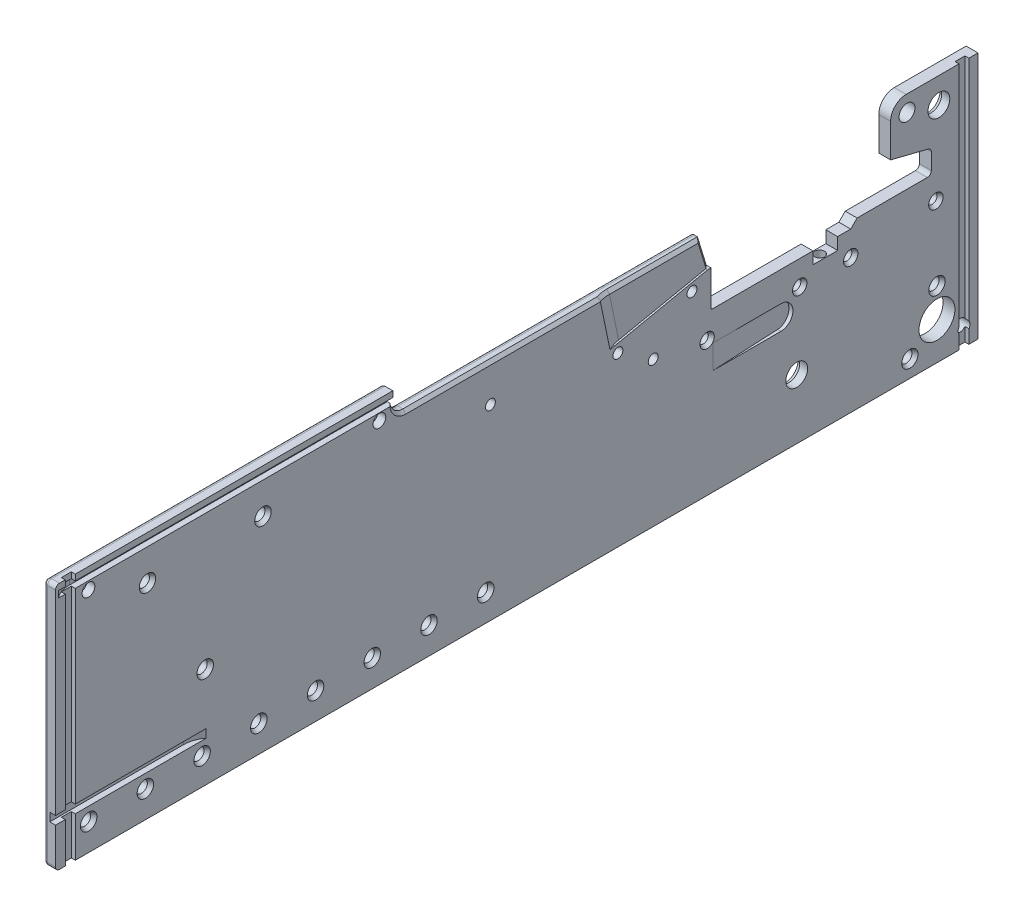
ISO-10303-21;
HEADER;
FILE_DESCRIPTION(('STEP AP214'),'2;1');
FILE_NAME('part.step','',(''),(''),'','','');
FILE_SCHEMA(('AUTOMOTIVE_DESIGN { 1 0 10303 214 1 1 1 1 }'));
ENDSEC;
DATA;
#1=APPLICATION_CONTEXT('core data for automotive mechanical design processes');
#2=APPLICATION_PROTOCOL_DEFINITION('international standard','automotive_design',2000,#1);
#3=PRODUCT_CONTEXT('',#1,'mechanical');
#4=PRODUCT('Part','Part','',(#3));
#5=PRODUCT_RELATED_PRODUCT_CATEGORY('part','',(#4));
#6=PRODUCT_DEFINITION_FORMATION('','',#4);
#7=PRODUCT_DEFINITION_CONTEXT('part definition',#1,'design');
#8=PRODUCT_DEFINITION('design','',#6,#7);
#9=PRODUCT_DEFINITION_SHAPE('','',#8);
#10=(LENGTH_UNIT() NAMED_UNIT(*) SI_UNIT(.MILLI.,.METRE.));
#11=(NAMED_UNIT(*) PLANE_ANGLE_UNIT() SI_UNIT($,.RADIAN.));
#12=(NAMED_UNIT(*) SI_UNIT($,.STERADIAN.) SOLID_ANGLE_UNIT());
#13=UNCERTAINTY_MEASURE_WITH_UNIT(LENGTH_MEASURE(1.E-05),#10,'distance_accuracy_value','');
#14=(GEOMETRIC_REPRESENTATION_CONTEXT(3) GLOBAL_UNCERTAINTY_ASSIGNED_CONTEXT((#13)) GLOBAL_UNIT_ASSIGNED_CONTEXT((#10,
#11,#12)) REPRESENTATION_CONTEXT('',''));
#15=CARTESIAN_POINT('',(0.,0.,0.));
#16=DIRECTION('',(0.,0.,1.));
#17=DIRECTION('',(1.,0.,0.));
#18=AXIS2_PLACEMENT_3D('',#15,#16,#17);
#19=CARTESIAN_POINT('',(4.7244,68.7832,-43.6118));
#20=DIRECTION('',(-1.,0.,0.));
#21=DIRECTION('',(0.,0.,1.));
#22=AXIS2_PLACEMENT_3D('',#19,#20,#21);
#23=PLANE('',#22);
#24=CARTESIAN_POINT('',(4.7244,2.7686,-55.88));
#25=DIRECTION('',(-1.,0.,0.));
#26=DIRECTION('',(0.,0.,1.));
#27=AXIS2_PLACEMENT_3D('',#24,#25,#26);
#28=CIRCLE('',#27,3.24843181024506);
#29=CARTESIAN_POINT('',(4.7244,2.7686,-59.1284318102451));
#30=VERTEX_POINT('',#29);
#31=EDGE_CURVE('E574',#30,#30,#28,.T.);
#32=ORIENTED_EDGE('',*,*,#31,.T.);
#33=EDGE_LOOP('',(#32));
#34=FACE_BOUND('',#33,.T.);
#35=CARTESIAN_POINT('',(4.7244,-17.018,-45.085));
#36=DIRECTION('',(-1.,0.,0.));
#37=DIRECTION('',(0.,0.,1.));
#38=AXIS2_PLACEMENT_3D('',#35,#36,#37);
#39=CIRCLE('',#38,3.24843181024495);
#40=CARTESIAN_POINT('',(4.7244,-17.018,-41.836568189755));
#41=VERTEX_POINT('',#40);
#42=EDGE_CURVE('E571',#41,#41,#39,.T.);
#43=ORIENTED_EDGE('',*,*,#42,.T.);
#44=EDGE_LOOP('',(#43));
#45=FACE_BOUND('',#44,.T.);
#46=CARTESIAN_POINT('',(4.7244,29.718,35.7124));
#47=DIRECTION('',(-1.,0.,0.));
#48=DIRECTION('',(0.,0.,1.));
#49=AXIS2_PLACEMENT_3D('',#46,#47,#48);
#50=CIRCLE('',#49,2.86108181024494);
#51=CARTESIAN_POINT('',(4.7244,29.718,38.5734818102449));
#52=VERTEX_POINT('',#51);
#53=EDGE_CURVE('E568',#52,#52,#50,.T.);
#54=ORIENTED_EDGE('',*,*,#53,.T.);
#55=EDGE_LOOP('',(#54));
#56=FACE_BOUND('',#55,.T.);
#57=CARTESIAN_POINT('',(4.7244,29.718,-1.1938));
#58=DIRECTION('',(-1.,0.,0.));
#59=DIRECTION('',(0.,0.,1.));
#60=AXIS2_PLACEMENT_3D('',#57,#58,#59);
#61=CIRCLE('',#60,2.86108181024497);
#62=CARTESIAN_POINT('',(4.7244,29.718,1.66728181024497));
#63=VERTEX_POINT('',#62);
#64=EDGE_CURVE('E565',#63,#63,#61,.T.);
#65=ORIENTED_EDGE('',*,*,#64,.T.);
#66=EDGE_LOOP('',(#65));
#67=FACE_BOUND('',#66,.T.);
#68=CARTESIAN_POINT('',(4.7244,29.718,-21.5138));
#69=DIRECTION('',(-1.,0.,0.));
#70=DIRECTION('',(0.,0.,1.));
#71=AXIS2_PLACEMENT_3D('',#68,#69,#70);
#72=CIRCLE('',#71,2.86108181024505);
#73=CARTESIAN_POINT('',(4.7244,29.718,-24.374881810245));
#74=VERTEX_POINT('',#73);
#75=EDGE_CURVE('E562',#74,#74,#72,.T.);
#76=ORIENTED_EDGE('',*,*,#75,.T.);
#77=EDGE_LOOP('',(#76));
#78=FACE_BOUND('',#77,.T.);
#79=CARTESIAN_POINT('',(4.7244,32.258,-55.4482));
#80=DIRECTION('',(-1.,0.,0.));
#81=DIRECTION('',(0.,0.,1.));
#82=AXIS2_PLACEMENT_3D('',#79,#80,#81);
#83=CIRCLE('',#82,2.86108181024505);
#84=CARTESIAN_POINT('',(4.7244,32.258,-52.5871181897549));
#85=VERTEX_POINT('',#84);
#86=EDGE_CURVE('E559',#85,#85,#83,.T.);
#87=ORIENTED_EDGE('',*,*,#86,.T.);
#88=EDGE_LOOP('',(#87));
#89=FACE_BOUND('',#88,.T.);
#90=CARTESIAN_POINT('',(4.7244,57.531,258.7498));
#91=DIRECTION('',(-1.,0.,0.));
#92=DIRECTION('',(0.,0.,1.));
#93=AXIS2_PLACEMENT_3D('',#90,#91,#92);
#94=CIRCLE('',#93,3.28411120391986);
#95=CARTESIAN_POINT('',(4.7244,57.531,255.46568879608));
#96=VERTEX_POINT('',#95);
#97=EDGE_CURVE('E523',#96,#96,#94,.T.);
#98=ORIENTED_EDGE('',*,*,#97,.T.);
#99=EDGE_LOOP('',(#98));
#100=FACE_BOUND('',#99,.T.);
#101=CARTESIAN_POINT('',(4.7244,57.531,212.725));
#102=DIRECTION('',(-1.,0.,0.));
#103=DIRECTION('',(0.,0.,1.));
#104=AXIS2_PLACEMENT_3D('',#101,#102,#103);
#105=CIRCLE('',#104,3.28411120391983);
#106=CARTESIAN_POINT('',(4.7244,57.531,209.44088879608));
#107=VERTEX_POINT('',#106);
#108=EDGE_CURVE('E520',#107,#107,#105,.T.);
#109=ORIENTED_EDGE('',*,*,#108,.T.);
#110=EDGE_LOOP('',(#109));
#111=FACE_BOUND('',#110,.T.);
#112=CARTESIAN_POINT('',(4.7244,16.256,235.7374));
#113=DIRECTION('',(-1.,0.,0.));
#114=DIRECTION('',(0.,0.,1.));
#115=AXIS2_PLACEMENT_3D('',#112,#113,#114);
#116=CIRCLE('',#115,3.28411120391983);
#117=CARTESIAN_POINT('',(4.7244,16.256,232.45328879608));
#118=VERTEX_POINT('',#117);
#119=EDGE_CURVE('E517',#118,#118,#116,.T.);
#120=ORIENTED_EDGE('',*,*,#119,.T.);
#121=EDGE_LOOP('',(#120));
#122=FACE_BOUND('',#121,.T.);
#123=CARTESIAN_POINT('',(4.7244,-13.1064,123.952));
#124=DIRECTION('',(-1.,0.,0.));
#125=DIRECTION('',(0.,0.,1.));
#126=AXIS2_PLACEMENT_3D('',#123,#124,#125);
#127=CIRCLE('',#126,3.28411120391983);
#128=CARTESIAN_POINT('',(4.7244,-13.1064,127.23611120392));
#129=VERTEX_POINT('',#128);
#130=EDGE_CURVE('E514',#129,#129,#127,.T.);
#131=ORIENTED_EDGE('',*,*,#130,.T.);
#132=EDGE_LOOP('',(#131));
#133=FACE_BOUND('',#132,.T.);
#134=CARTESIAN_POINT('',(4.7244,-13.1064,146.558));
#135=DIRECTION('',(-1.,0.,0.));
#136=DIRECTION('',(0.,0.,1.));
#137=AXIS2_PLACEMENT_3D('',#134,#135,#136);
#138=CIRCLE('',#137,3.28411120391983);
#139=CARTESIAN_POINT('',(4.7244,-13.1064,149.84211120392));
#140=VERTEX_POINT('',#139);
#141=EDGE_CURVE('E511',#140,#140,#138,.T.);
#142=ORIENTED_EDGE('',*,*,#141,.T.);
#143=EDGE_LOOP('',(#142));
#144=FACE_BOUND('',#143,.T.);
#145=CARTESIAN_POINT('',(4.7244,-13.1064,169.164));
#146=DIRECTION('',(-1.,0.,0.));
#147=DIRECTION('',(0.,0.,1.));
#148=AXIS2_PLACEMENT_3D('',#145,#146,#147);
#149=CIRCLE('',#148,3.28411120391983);
#150=CARTESIAN_POINT('',(4.7244,-13.1064,172.44811120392));
#151=VERTEX_POINT('',#150);
#152=EDGE_CURVE('E508',#151,#151,#149,.T.);
#153=ORIENTED_EDGE('',*,*,#152,.T.);
#154=EDGE_LOOP('',(#153));
#155=FACE_BOUND('',#154,.T.);
#156=CARTESIAN_POINT('',(4.7244,-13.1064,191.77));
#157=DIRECTION('',(-1.,0.,0.));
#158=DIRECTION('',(0.,0.,1.));
#159=AXIS2_PLACEMENT_3D('',#156,#157,#158);
#160=CIRCLE('',#159,3.28411120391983);
#161=CARTESIAN_POINT('',(4.7244,-13.1064,195.05411120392));
#162=VERTEX_POINT('',#161);
#163=EDGE_CURVE('E505',#162,#162,#160,.T.);
#164=ORIENTED_EDGE('',*,*,#163,.T.);
#165=EDGE_LOOP('',(#164));
#166=FACE_BOUND('',#165,.T.);
#167=CARTESIAN_POINT('',(4.7244,-13.1064,214.376));
#168=DIRECTION('',(-1.,0.,0.));
#169=DIRECTION('',(0.,0.,1.));
#170=AXIS2_PLACEMENT_3D('',#167,#168,#169);
#171=CIRCLE('',#170,3.28411120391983);
#172=CARTESIAN_POINT('',(4.7244,-13.1064,217.66011120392));
#173=VERTEX_POINT('',#172);
#174=EDGE_CURVE('E502',#173,#173,#171,.T.);
#175=ORIENTED_EDGE('',*,*,#174,.T.);
#176=EDGE_LOOP('',(#175));
#177=FACE_BOUND('',#176,.T.);
#178=CARTESIAN_POINT('',(4.7244,-13.1064,236.982));
#179=DIRECTION('',(-1.,0.,0.));
#180=DIRECTION('',(0.,0.,1.));
#181=AXIS2_PLACEMENT_3D('',#178,#179,#180);
#182=CIRCLE('',#181,3.28411120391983);
#183=CARTESIAN_POINT('',(4.7244,-13.1064,240.26611120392));
#184=VERTEX_POINT('',#183);
#185=EDGE_CURVE('E499',#184,#184,#182,.T.);
#186=ORIENTED_EDGE('',*,*,#185,.T.);
#187=EDGE_LOOP('',(#186));
#188=FACE_BOUND('',#187,.T.);
#189=CARTESIAN_POINT('',(4.7244,-13.1064,259.588));
#190=DIRECTION('',(-1.,0.,0.));
#191=DIRECTION('',(0.,0.,1.));
#192=AXIS2_PLACEMENT_3D('',#189,#190,#191);
#193=CIRCLE('',#192,3.2841112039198);
#194=CARTESIAN_POINT('',(4.7244,-13.1064,262.87211120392));
#195=VERTEX_POINT('',#194);
#196=EDGE_CURVE('E496',#195,#195,#193,.T.);
#197=ORIENTED_EDGE('',*,*,#196,.T.);
#198=EDGE_LOOP('',(#197));
#199=FACE_BOUND('',#198,.T.);
#200=CARTESIAN_POINT('',(4.7244,-13.1064,282.194));
#201=DIRECTION('',(-1.,0.,0.));
#202=DIRECTION('',(0.,0.,1.));
#203=AXIS2_PLACEMENT_3D('',#200,#201,#202);
#204=CIRCLE('',#203,3.2841112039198);
#205=CARTESIAN_POINT('',(4.7244,-13.1064,285.47811120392));
#206=VERTEX_POINT('',#205);
#207=EDGE_CURVE('E488',#206,#206,#204,.T.);
#208=ORIENTED_EDGE('',*,*,#207,.T.);
#209=EDGE_LOOP('',(#208));
#210=FACE_BOUND('',#209,.T.);
#211=DIRECTION('',(0.,1.,0.));
#212=VECTOR('',#211,1.);
#213=CARTESIAN_POINT('',(4.7244,53.975,34.1376));
#214=LINE('',#213,#212);
#215=CARTESIAN_POINT('',(4.7244,40.0558,34.1376));
#216=VERTEX_POINT('',#215);
#217=CARTESIAN_POINT('',(4.7244,53.975,34.1376));
#218=VERTEX_POINT('',#217);
#219=EDGE_CURVE('E731',#216,#218,#214,.T.);
#220=ORIENTED_EDGE('',*,*,#219,.T.);
#221=DIRECTION('',(0.,0.,-1.));
#222=VECTOR('',#221,1.);
#223=CARTESIAN_POINT('',(4.7244,53.975,35.6022707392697));
#224=LINE('',#223,#222);
#225=CARTESIAN_POINT('',(4.7244,53.975,35.6022707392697));
#226=VERTEX_POINT('',#225);
#227=EDGE_CURVE('E1690',#226,#218,#224,.T.);
#228=ORIENTED_EDGE('',*,*,#227,.F.);
#229=DIRECTION('',(0.,0.203736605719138,-0.97902573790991));
#230=VECTOR('',#229,1.);
#231=CARTESIAN_POINT('',(4.7244,45.8986478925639,74.411970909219));
#232=LINE('',#231,#230);
#233=CARTESIAN_POINT('',(4.7244,45.8986478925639,74.411970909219));
#234=VERTEX_POINT('',#233);
#235=EDGE_CURVE('E1711',#234,#226,#232,.T.);
#236=ORIENTED_EDGE('',*,*,#235,.F.);
#237=DIRECTION('',(0.,-0.97902573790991,-0.203736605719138));
#238=VECTOR('',#237,1.);
#239=CARTESIAN_POINT('',(4.7244,117.853058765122,89.3857830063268));
#240=LINE('',#239,#238);
#241=CARTESIAN_POINT('',(4.7244,64.341375,78.2499278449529));
#242=VERTEX_POINT('',#241);
#243=EDGE_CURVE('E900',#242,#234,#240,.T.);
#244=ORIENTED_EDGE('',*,*,#243,.F.);
#245=DIRECTION('',(0.,0.,1.));
#246=VECTOR('',#245,1.);
#247=CARTESIAN_POINT('',(4.7244,64.341375,-43.6118));
#248=LINE('',#247,#246);
#249=CARTESIAN_POINT('',(4.7244,64.341375,155.8036));
#250=VERTEX_POINT('',#249);
#251=EDGE_CURVE('E1732',#242,#250,#248,.T.);
#252=ORIENTED_EDGE('',*,*,#251,.T.);
#253=CARTESIAN_POINT('',(4.7244,70.6882,155.8036));
#254=DIRECTION('',(-1.,0.,0.));
#255=DIRECTION('',(0.,0.,1.));
#256=AXIS2_PLACEMENT_3D('',#253,#254,#255);
#257=CIRCLE('',#256,6.34682500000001);
#258=CARTESIAN_POINT('',(4.7244,70.0532,162.118579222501));
#259=VERTEX_POINT('',#258);
#260=EDGE_CURVE('E1500',#250,#259,#257,.T.);
#261=ORIENTED_EDGE('',*,*,#260,.T.);
#262=DIRECTION('',(0.,0.,1.));
#263=VECTOR('',#262,1.);
#264=CARTESIAN_POINT('',(4.7244,70.0531999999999,294.231867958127));
#265=LINE('',#264,#263);
#266=CARTESIAN_POINT('',(4.7244,70.0531999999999,287.528));
#267=VERTEX_POINT('',#266);
#268=EDGE_CURVE('E926',#259,#267,#265,.T.);
#269=ORIENTED_EDGE('',*,*,#268,.T.);
#270=DIRECTION('',(0.,1.,0.));
#271=VECTOR('',#270,1.);
#272=CARTESIAN_POINT('',(4.7244,-23.7998000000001,287.528));
#273=LINE('',#272,#271);
#274=CARTESIAN_POINT('',(4.7244,-4.3942,287.528));
#275=VERTEX_POINT('',#274);
#276=EDGE_CURVE('E1069',#275,#267,#273,.T.);
#277=ORIENTED_EDGE('',*,*,#276,.F.);
#278=DIRECTION('',(0.,0.,-1.));
#279=VECTOR('',#278,1.);
#280=CARTESIAN_POINT('',(4.7244,-4.3942,295.402));
#281=LINE('',#280,#279);
#282=CARTESIAN_POINT('',(4.7244,-4.3942,235.389882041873));
#283=VERTEX_POINT('',#282);
#284=EDGE_CURVE('E976',#275,#283,#281,.T.);
#285=ORIENTED_EDGE('',*,*,#284,.T.);
#286=DIRECTION('',(0.,1.,0.));
#287=VECTOR('',#286,1.);
#288=CARTESIAN_POINT('',(4.7244,-7.747,235.389882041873));
#289=LINE('',#288,#287);
#290=CARTESIAN_POINT('',(4.7244,-7.747,235.389882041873));
#291=VERTEX_POINT('',#290);
#292=EDGE_CURVE('E973',#291,#283,#289,.T.);
#293=ORIENTED_EDGE('',*,*,#292,.F.);
#294=DIRECTION('',(0.,0.,-1.));
#295=VECTOR('',#294,1.);
#296=CARTESIAN_POINT('',(4.7244,-7.747,295.402));
#297=LINE('',#296,#295);
#298=CARTESIAN_POINT('',(4.7244,-7.747,287.528));
#299=VERTEX_POINT('',#298);
#300=EDGE_CURVE('E963',#299,#291,#297,.T.);
#301=ORIENTED_EDGE('',*,*,#300,.F.);
#302=CARTESIAN_POINT('',(4.7244,-23.7998000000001,287.528));
#303=VERTEX_POINT('',#302);
#304=EDGE_CURVE('E1066',#303,#299,#273,.T.);
#305=ORIENTED_EDGE('',*,*,#304,.F.);
#306=DIRECTION('',(0.,0.,-1.));
#307=VECTOR('',#306,1.);
#308=CARTESIAN_POINT('',(4.7244,-23.7998,-72.2376));
#309=LINE('',#308,#307);
#310=CARTESIAN_POINT('',(4.7244,-23.7998,-64.6684));
#311=VERTEX_POINT('',#310);
#312=EDGE_CURVE('E752',#303,#311,#309,.T.);
#313=ORIENTED_EDGE('',*,*,#312,.T.);
#314=DIRECTION('',(0.,1.,0.));
#315=VECTOR('',#314,1.);
#316=CARTESIAN_POINT('',(4.7244,-23.7998,-64.6684));
#317=LINE('',#316,#315);
#318=CARTESIAN_POINT('',(4.7244,-18.2764059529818,-64.6684));
#319=VERTEX_POINT('',#318);
#320=EDGE_CURVE('E1018',#311,#319,#317,.T.);
#321=ORIENTED_EDGE('',*,*,#320,.T.);
#322=CARTESIAN_POINT('',(4.7244,-17.018,-66.675));
#323=DIRECTION('',(1.,0.,0.));
#324=DIRECTION('',(0.,0.,-1.));
#325=AXIS2_PLACEMENT_3D('',#322,#323,#324);
#326=CIRCLE('',#325,2.36855);
#327=CARTESIAN_POINT('',(4.7244,-15.7595940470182,-64.6684));
#328=VERTEX_POINT('',#327);
#329=EDGE_CURVE('E1108',#328,#319,#326,.T.);
#330=ORIENTED_EDGE('',*,*,#329,.F.);
#331=CARTESIAN_POINT('',(4.7244,74.9808,-64.6684));
#332=VERTEX_POINT('',#331);
#333=EDGE_CURVE('E1022',#328,#332,#317,.T.);
#334=ORIENTED_EDGE('',*,*,#333,.T.);
#335=DIRECTION('',(0.,0.,1.));
#336=VECTOR('',#335,1.);
#337=CARTESIAN_POINT('',(4.7244,74.9808,-72.2376));
#338=LINE('',#337,#336);
#339=CARTESIAN_POINT('',(4.7244,74.9808,-43.6118));
#340=VERTEX_POINT('',#339);
#341=EDGE_CURVE('E697',#332,#340,#338,.T.);
#342=ORIENTED_EDGE('',*,*,#341,.T.);
#343=CARTESIAN_POINT('',(4.7244,68.7832,-43.6118));
#344=DIRECTION('',(1.,0.,0.));
#345=DIRECTION('',(0.,0.,1.));
#346=AXIS2_PLACEMENT_3D('',#343,#344,#345);
#347=CIRCLE('',#346,6.1976);
#348=CARTESIAN_POINT('',(4.7244,68.7832,-37.4142));
#349=VERTEX_POINT('',#348);
#350=EDGE_CURVE('E696',#340,#349,#347,.T.);
#351=ORIENTED_EDGE('',*,*,#350,.T.);
#352=DIRECTION('',(0.,-1.,0.));
#353=VECTOR('',#352,1.);
#354=CARTESIAN_POINT('',(4.7244,55.4482,-37.4142));
#355=LINE('',#354,#353);
#356=CARTESIAN_POINT('',(4.7244,55.4482,-37.4142));
#357=VERTEX_POINT('',#356);
#358=EDGE_CURVE('E699',#349,#357,#355,.T.);
#359=ORIENTED_EDGE('',*,*,#358,.T.);
#360=DIRECTION('',(0.,-0.241921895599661,-0.970295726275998));
#361=VECTOR('',#360,1.);
#362=CARTESIAN_POINT('',(4.7244,51.7078433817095,-52.4159510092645));
#363=LINE('',#362,#361);
#364=CARTESIAN_POINT('',(4.7244,51.7078433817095,-52.4159510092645));
#365=VERTEX_POINT('',#364);
#366=EDGE_CURVE('E707',#357,#365,#363,.T.);
#367=ORIENTED_EDGE('',*,*,#366,.T.);
#368=CARTESIAN_POINT('',(4.7244,50.1674989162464,-52.0319));
#369=DIRECTION('',(-1.,0.,0.));
#370=DIRECTION('',(0.,0.,-1.));
#371=AXIS2_PLACEMENT_3D('',#368,#369,#370);
#372=CIRCLE('',#371,1.5875);
#373=CARTESIAN_POINT('',(4.7244,50.1674989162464,-53.6194));
#374=VERTEX_POINT('',#373);
#375=EDGE_CURVE('E709',#365,#374,#372,.T.);
#376=ORIENTED_EDGE('',*,*,#375,.T.);
#377=DIRECTION('',(0.,-1.,0.));
#378=VECTOR('',#377,1.);
#379=CARTESIAN_POINT('',(4.7244,43.6753,-53.6194));
#380=LINE('',#379,#378);
#381=CARTESIAN_POINT('',(4.7244,43.6753,-53.6194));
#382=VERTEX_POINT('',#381);
#383=EDGE_CURVE('E711',#374,#382,#380,.T.);
#384=ORIENTED_EDGE('',*,*,#383,.T.);
#385=CARTESIAN_POINT('',(4.7244,43.6753,-52.0319));
#386=DIRECTION('',(-1.,0.,0.));
#387=DIRECTION('',(0.,0.,-1.));
#388=AXIS2_PLACEMENT_3D('',#385,#386,#387);
#389=CIRCLE('',#388,1.5875);
#390=CARTESIAN_POINT('',(4.7244,42.0878,-52.0319));
#391=VERTEX_POINT('',#390);
#392=EDGE_CURVE('E713',#382,#391,#389,.T.);
#393=ORIENTED_EDGE('',*,*,#392,.T.);
#394=DIRECTION('',(0.,0.,1.));
#395=VECTOR('',#394,1.);
#396=CARTESIAN_POINT('',(4.7244,42.0878,-24.0538));
#397=LINE('',#396,#395);
#398=CARTESIAN_POINT('',(4.7244,42.0878,-24.0538));
#399=VERTEX_POINT('',#398);
#400=EDGE_CURVE('E715',#391,#399,#397,.T.);
#401=ORIENTED_EDGE('',*,*,#400,.T.);
#402=DIRECTION('',(0.,-0.707106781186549,0.707106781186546));
#403=VECTOR('',#402,1.);
#404=CARTESIAN_POINT('',(4.7244,39.5478,-21.5138));
#405=LINE('',#404,#403);
#406=CARTESIAN_POINT('',(4.7244,39.5478,-21.5138));
#407=VERTEX_POINT('',#406);
#408=EDGE_CURVE('E717',#399,#407,#405,.T.);
#409=ORIENTED_EDGE('',*,*,#408,.T.);
#410=DIRECTION('',(0.,0.,1.));
#411=VECTOR('',#410,1.);
#412=CARTESIAN_POINT('',(4.7244,39.5478,-16.3068));
#413=LINE('',#412,#411);
#414=CARTESIAN_POINT('',(4.7244,39.5478,-16.3068));
#415=VERTEX_POINT('',#414);
#416=EDGE_CURVE('E719',#407,#415,#413,.T.);
#417=ORIENTED_EDGE('',*,*,#416,.T.);
#418=DIRECTION('',(0.,-1.,0.));
#419=VECTOR('',#418,1.);
#420=CARTESIAN_POINT('',(4.7244,34.7472,-16.3068));
#421=LINE('',#420,#419);
#422=CARTESIAN_POINT('',(4.7244,34.7472,-16.3068));
#423=VERTEX_POINT('',#422);
#424=EDGE_CURVE('E721',#415,#423,#421,.T.);
#425=ORIENTED_EDGE('',*,*,#424,.T.);
#426=DIRECTION('',(0.,0.,1.));
#427=VECTOR('',#426,1.);
#428=CARTESIAN_POINT('',(4.7244,34.7472,-6.4516));
#429=LINE('',#428,#427);
#430=CARTESIAN_POINT('',(4.7244,34.7472,-6.4516));
#431=VERTEX_POINT('',#430);
#432=EDGE_CURVE('E723',#423,#431,#429,.T.);
#433=ORIENTED_EDGE('',*,*,#432,.T.);
#434=DIRECTION('',(0.,1.,0.));
#435=VECTOR('',#434,1.);
#436=CARTESIAN_POINT('',(4.7244,39.5478,-6.45159999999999));
#437=LINE('',#436,#435);
#438=CARTESIAN_POINT('',(4.7244,39.5478,-6.45159999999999));
#439=VERTEX_POINT('',#438);
#440=EDGE_CURVE('E725',#431,#439,#437,.T.);
#441=ORIENTED_EDGE('',*,*,#440,.T.);
#442=DIRECTION('',(0.,0.,1.));
#443=VECTOR('',#442,1.);
#444=CARTESIAN_POINT('',(4.7244,39.5478,33.6296));
#445=LINE('',#444,#443);
#446=CARTESIAN_POINT('',(4.7244,39.5478,33.6296));
#447=VERTEX_POINT('',#446);
#448=EDGE_CURVE('E727',#439,#447,#445,.T.);
#449=ORIENTED_EDGE('',*,*,#448,.T.);
#450=CARTESIAN_POINT('',(4.7244,40.0558,33.6296));
#451=DIRECTION('',(-1.,0.,0.));
#452=DIRECTION('',(0.,0.,-1.));
#453=AXIS2_PLACEMENT_3D('',#450,#451,#452);
#454=CIRCLE('',#453,0.508000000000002);
#455=EDGE_CURVE('E729',#447,#216,#454,.T.);
#456=ORIENTED_EDGE('',*,*,#455,.T.);
#457=EDGE_LOOP('',(#220,#228,#236,#244,#252,#261,#269,#277,#285,#293,#301,#305,#313,#321,#330,
#334,#342,#351,#359,#367,#376,#384,#393,#401,#409,#417,#425,#433,#441,#449,#456));
#458=FACE_BOUND('',#457,.T.);
#459=CARTESIAN_POINT('',(4.7244,33.9852,57.2008));
#460=DIRECTION('',(1.,0.,0.));
#461=DIRECTION('',(0.,0.,-1.));
#462=AXIS2_PLACEMENT_3D('',#459,#460,#461);
#463=CIRCLE('',#462,1.9812);
#464=CARTESIAN_POINT('',(4.7244,33.9852,55.2196));
#465=VERTEX_POINT('',#464);
#466=EDGE_CURVE('E1081',#465,#465,#463,.T.);
#467=ORIENTED_EDGE('',*,*,#466,.F.);
#468=EDGE_LOOP('',(#467));
#469=FACE_BOUND('',#468,.T.);
#470=CARTESIAN_POINT('',(4.7244,43.1292,71.2724));
#471=DIRECTION('',(1.,0.,0.));
#472=DIRECTION('',(0.,0.,-1.));
#473=AXIS2_PLACEMENT_3D('',#470,#471,#472);
#474=CIRCLE('',#473,1.9812);
#475=CARTESIAN_POINT('',(4.7244,43.1292,69.2912));
#476=VERTEX_POINT('',#475);
#477=EDGE_CURVE('E1087',#476,#476,#474,.T.);
#478=ORIENTED_EDGE('',*,*,#477,.F.);
#479=EDGE_LOOP('',(#478));
#480=FACE_BOUND('',#479,.T.);
#481=CARTESIAN_POINT('',(4.7244,64.77,-56.642));
#482=DIRECTION('',(1.,0.,0.));
#483=DIRECTION('',(0.,0.,-1.));
#484=AXIS2_PLACEMENT_3D('',#481,#482,#483);
#485=CIRCLE('',#484,4.35229000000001);
#486=CARTESIAN_POINT('',(4.7244,64.77,-60.99429));
#487=VERTEX_POINT('',#486);
#488=EDGE_CURVE('E1093',#487,#487,#485,.T.);
#489=ORIENTED_EDGE('',*,*,#488,.F.);
#490=EDGE_LOOP('',(#489));
#491=FACE_BOUND('',#490,.T.);
#492=CARTESIAN_POINT('',(4.7244,67.31,166.3192));
#493=DIRECTION('',(1.,0.,0.));
#494=DIRECTION('',(0.,0.,-1.));
#495=AXIS2_PLACEMENT_3D('',#492,#493,#494);
#496=CIRCLE('',#495,2.53999999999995);
#497=CARTESIAN_POINT('',(4.7244,67.31,163.7792));
#498=VERTEX_POINT('',#497);
#499=EDGE_CURVE('E1118',#498,#498,#496,.T.);
#500=ORIENTED_EDGE('',*,*,#499,.F.);
#501=EDGE_LOOP('',(#500));
#502=FACE_BOUND('',#501,.T.);
#503=CARTESIAN_POINT('',(4.7244,0.,0.));
#504=DIRECTION('',(1.,0.,0.));
#505=DIRECTION('',(0.,0.,-1.));
#506=AXIS2_PLACEMENT_3D('',#503,#504,#505);
#507=CIRCLE('',#506,4.35229);
#508=CARTESIAN_POINT('',(4.7244,0.,-4.35229));
#509=VERTEX_POINT('',#508);
#510=EDGE_CURVE('E703',#509,#509,#507,.T.);
#511=ORIENTED_EDGE('',*,*,#510,.F.);
#512=EDGE_LOOP('',(#511));
#513=FACE_BOUND('',#512,.T.);
#514=CARTESIAN_POINT('',(4.7244,66.929,282.2702));
#515=DIRECTION('',(1.,0.,0.));
#516=DIRECTION('',(0.,0.,-1.));
#517=AXIS2_PLACEMENT_3D('',#514,#515,#516);
#518=CIRCLE('',#517,2.54000000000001);
#519=CARTESIAN_POINT('',(4.7244,66.929,279.7302));
#520=VERTEX_POINT('',#519);
#521=EDGE_CURVE('E1123',#520,#520,#518,.T.);
#522=ORIENTED_EDGE('',*,*,#521,.F.);
#523=EDGE_LOOP('',(#522));
#524=FACE_BOUND('',#523,.T.);
#525=CARTESIAN_POINT('',(4.7244,-8.89,-55.88));
#526=DIRECTION('',(1.,0.,0.));
#527=DIRECTION('',(0.,0.,-1.));
#528=AXIS2_PLACEMENT_3D('',#525,#526,#527);
#529=CIRCLE('',#528,7.1501);
#530=CARTESIAN_POINT('',(4.7244,-8.89,-63.0301));
#531=VERTEX_POINT('',#530);
#532=EDGE_CURVE('E1115',#531,#531,#529,.T.);
#533=ORIENTED_EDGE('',*,*,#532,.F.);
#534=EDGE_LOOP('',(#533));
#535=FACE_BOUND('',#534,.T.);
#536=CARTESIAN_POINT('',(4.7244,68.58,-43.942));
#537=DIRECTION('',(1.,0.,0.));
#538=DIRECTION('',(0.,0.,-1.));
#539=AXIS2_PLACEMENT_3D('',#536,#537,#538);
#540=CIRCLE('',#539,3.175);
#541=CARTESIAN_POINT('',(4.7244,68.58,-47.117));
#542=VERTEX_POINT('',#541);
#543=EDGE_CURVE('E1097',#542,#542,#540,.T.);
#544=ORIENTED_EDGE('',*,*,#543,.F.);
#545=EDGE_LOOP('',(#544));
#546=FACE_BOUND('',#545,.T.);
#547=CARTESIAN_POINT('',(4.7244,50.7492,122.0724));
#548=DIRECTION('',(1.,0.,0.));
#549=DIRECTION('',(0.,0.,-1.));
#550=AXIS2_PLACEMENT_3D('',#547,#548,#549);
#551=CIRCLE('',#550,1.9812);
#552=CARTESIAN_POINT('',(4.7244,50.7492,120.0912));
#553=VERTEX_POINT('',#552);
#554=EDGE_CURVE('E1090',#553,#553,#551,.T.);
#555=ORIENTED_EDGE('',*,*,#554,.F.);
#556=EDGE_LOOP('',(#555));
#557=FACE_BOUND('',#556,.T.);
#558=CARTESIAN_POINT('',(4.7244,49.6062,41.7576));
#559=DIRECTION('',(1.,0.,0.));
#560=DIRECTION('',(0.,0.,-1.));
#561=AXIS2_PLACEMENT_3D('',#558,#559,#560);
#562=CIRCLE('',#561,1.9812);
#563=CARTESIAN_POINT('',(4.7244,49.6062,39.7764));
#564=VERTEX_POINT('',#563);
#565=EDGE_CURVE('E1084',#564,#564,#562,.T.);
#566=ORIENTED_EDGE('',*,*,#565,.F.);
#567=EDGE_LOOP('',(#566));
#568=FACE_BOUND('',#567,.T.);
#569=DIRECTION('',(0.,0.,-1.));
#570=VECTOR('',#569,1.);
#571=CARTESIAN_POINT('',(4.7244,18.161,-43.6118));
#572=LINE('',#571,#570);
#573=CARTESIAN_POINT('',(4.7244,18.161,33.3375));
#574=VERTEX_POINT('',#573);
#575=CARTESIAN_POINT('',(4.7244,18.161,6.28233124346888));
#576=VERTEX_POINT('',#575);
#577=EDGE_CURVE('E471',#574,#576,#572,.T.);
#578=ORIENTED_EDGE('',*,*,#577,.F.);
#579=DIRECTION('',(0.,-1.,0.));
#580=VECTOR('',#579,1.);
#581=CARTESIAN_POINT('',(4.7244,18.161,33.3375));
#582=LINE('',#581,#580);
#583=CARTESIAN_POINT('',(4.7244,27.686,33.3375));
#584=VERTEX_POINT('',#583);
#585=EDGE_CURVE('E476',#584,#574,#582,.T.);
#586=ORIENTED_EDGE('',*,*,#585,.F.);
#587=DIRECTION('',(0.,0.,1.));
#588=VECTOR('',#587,1.);
#589=CARTESIAN_POINT('',(4.7244,27.686,-43.6118));
#590=LINE('',#589,#588);
#591=CARTESIAN_POINT('',(4.7244,27.686,6.28233124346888));
#592=VERTEX_POINT('',#591);
#593=EDGE_CURVE('E490',#592,#584,#590,.T.);
#594=ORIENTED_EDGE('',*,*,#593,.F.);
#595=CARTESIAN_POINT('',(4.7244,22.9235,6.28233124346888));
#596=DIRECTION('',(-1.,0.,0.));
#597=DIRECTION('',(0.,0.,1.));
#598=AXIS2_PLACEMENT_3D('',#595,#596,#597);
#599=ELLIPSE('',#598,4.76798324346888,4.7625);
#600=EDGE_CURVE('E484',#576,#592,#599,.F.);
#601=ORIENTED_EDGE('',*,*,#600,.F.);
#602=EDGE_LOOP('',(#578,#586,#594,#601));
#603=FACE_BOUND('',#602,.T.);
#604=ADVANCED_FACE('F37',(#34,#45,#56,#67,#78,#89,#100,#111,#122,#133,#144,#155,#166,#177,#188,
#199,#210,#458,#469,#480,#491,#502,#513,#524,#535,#546,#557,#568,#603),#23,.F.);
#605=CARTESIAN_POINT('',(4.7244,65.532,37.6709294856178));
#606=DIRECTION('',(0.,-0.292371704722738,0.956304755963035));
#607=DIRECTION('',(0.,-0.956304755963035,-0.292371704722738));
#608=AXIS2_PLACEMENT_3D('',#605,#606,#607);
#609=PLANE('',#608);
#610=DIRECTION('',(0.,0.956304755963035,0.292371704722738));
#611=VECTOR('',#610,1.);
#612=CARTESIAN_POINT('',(0.,65.532,37.6709294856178));
#613=LINE('',#612,#611);
#614=CARTESIAN_POINT('',(0.,53.975,34.1376));
#615=VERTEX_POINT('',#614);
#616=CARTESIAN_POINT('',(0.,63.9445,37.1855820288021));
#617=VERTEX_POINT('',#616);
#618=EDGE_CURVE('E789',#615,#617,#613,.T.);
#619=ORIENTED_EDGE('',*,*,#618,.T.);
#620=CARTESIAN_POINT('',(1.5875,63.9445,37.1855820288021));
#621=DIRECTION('',(0.,-0.292371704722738,0.956304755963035));
#622=DIRECTION('',(0.,-0.956304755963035,-0.292371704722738));
#623=AXIS2_PLACEMENT_3D('',#620,#621,#622);
#624=ELLIPSE('',#623,1.66003566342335,1.5875);
#625=CARTESIAN_POINT('',(1.5875,65.532,37.6709294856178));
#626=VERTEX_POINT('',#625);
#627=EDGE_CURVE('E60',#617,#626,#624,.F.);
#628=ORIENTED_EDGE('',*,*,#627,.T.);
#629=DIRECTION('',(-1.,0.,0.));
#630=VECTOR('',#629,1.);
#631=CARTESIAN_POINT('',(4.7244,65.532,37.6709294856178));
#632=LINE('',#631,#630);
#633=CARTESIAN_POINT('',(2.79717499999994,65.532,37.6709294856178));
#634=VERTEX_POINT('',#633);
#635=EDGE_CURVE('E817',#634,#626,#632,.T.);
#636=ORIENTED_EDGE('',*,*,#635,.F.);
#637=DIRECTION('',(0.,-0.956304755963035,-0.292371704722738));
#638=VECTOR('',#637,1.);
#639=CARTESIAN_POINT('',(2.79717499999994,54.2615677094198,34.225212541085));
#640=LINE('',#639,#638);
#641=CARTESIAN_POINT('',(2.79717499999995,53.975,34.1376));
#642=VERTEX_POINT('',#641);
#643=EDGE_CURVE('E1742',#634,#642,#640,.T.);
#644=ORIENTED_EDGE('',*,*,#643,.T.);
#645=DIRECTION('',(-1.,0.,0.));
#646=VECTOR('',#645,1.);
#647=CARTESIAN_POINT('',(4.7244,53.975,34.1376));
#648=LINE('',#647,#646);
#649=EDGE_CURVE('E819',#642,#615,#648,.T.);
#650=ORIENTED_EDGE('',*,*,#649,.T.);
#651=EDGE_LOOP('',(#619,#628,#636,#644,#650));
#652=FACE_BOUND('',#651,.T.);
#653=ADVANCED_FACE('F653',(#652),#609,.F.);
#654=CARTESIAN_POINT('',(4.7244,65.532,155.8036));
#655=DIRECTION('',(0.,-1.,0.));
#656=DIRECTION('',(0.,0.,-1.));
#657=AXIS2_PLACEMENT_3D('',#654,#655,#656);
#658=PLANE('',#657);
#659=ORIENTED_EDGE('',*,*,#635,.T.);
#660=DIRECTION('',(0.,0.,1.));
#661=VECTOR('',#660,1.);
#662=CARTESIAN_POINT('',(1.5875,65.532,155.8036));
#663=LINE('',#662,#661);
#664=CARTESIAN_POINT('',(1.5875,65.532,155.8036));
#665=VERTEX_POINT('',#664);
#666=EDGE_CURVE('E1666',#626,#665,#663,.T.);
#667=ORIENTED_EDGE('',*,*,#666,.T.);
#668=DIRECTION('',(-1.,0.,0.));
#669=VECTOR('',#668,1.);
#670=CARTESIAN_POINT('',(4.7244,65.532,155.8036));
#671=LINE('',#670,#669);
#672=CARTESIAN_POINT('',(3.533775,65.532,155.8036));
#673=VERTEX_POINT('',#672);
#674=EDGE_CURVE('E814',#673,#665,#671,.T.);
#675=ORIENTED_EDGE('',*,*,#674,.F.);
#676=DIRECTION('',(0.,0.,-1.));
#677=VECTOR('',#676,1.);
#678=CARTESIAN_POINT('',(3.533775,65.532,155.8036));
#679=LINE('',#678,#677);
#680=CARTESIAN_POINT('',(3.533775,65.532,78.4552570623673));
#681=VERTEX_POINT('',#680);
#682=EDGE_CURVE('E1757',#673,#681,#679,.T.);
#683=ORIENTED_EDGE('',*,*,#682,.T.);
#684=CARTESIAN_POINT('',(2.79939600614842,65.532,73.6426198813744));
#685=CARTESIAN_POINT('',(2.78379806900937,65.532,74.530516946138));
#686=CARTESIAN_POINT('',(2.85015242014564,65.532,75.4198803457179));
#687=CARTESIAN_POINT('',(3.14413658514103,65.532,77.1703918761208));
#688=CARTESIAN_POINT('',(3.37175945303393,65.532,78.031498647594));
#689=CARTESIAN_POINT('',(3.67617099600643,65.532,78.8633253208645));
#690=B_SPLINE_CURVE_WITH_KNOTS('',3,(#684,#685,#686,#687,#688,#689),.UNSPECIFIED.,.F.,.F.,(4,2,
4),(4.35473359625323,4.54250267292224,4.73027174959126),.UNSPECIFIED.);
#691=CARTESIAN_POINT('',(2.79716831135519,65.532,73.8963308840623));
#692=VERTEX_POINT('',#691);
#693=EDGE_CURVE('E1754',#681,#692,#690,.F.);
#694=ORIENTED_EDGE('',*,*,#693,.T.);
#695=DIRECTION('',(0.,0.,-1.));
#696=VECTOR('',#695,1.);
#697=CARTESIAN_POINT('',(2.79717499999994,65.532,37.6709294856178));
#698=LINE('',#697,#696);
#699=EDGE_CURVE('E1750',#692,#634,#698,.T.);
#700=ORIENTED_EDGE('',*,*,#699,.T.);
#701=EDGE_LOOP('',(#659,#667,#675,#683,#694,#700));
#702=FACE_BOUND('',#701,.T.);
#703=ADVANCED_FACE('F661',(#702),#658,.F.);
#704=CARTESIAN_POINT('',(4.7244,-23.7998000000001,287.528));
#705=DIRECTION('',(0.,0.,-1.));
#706=DIRECTION('',(0.,1.,0.));
#707=AXIS2_PLACEMENT_3D('',#704,#705,#706);
#708=PLANE('',#707);
#709=DIRECTION('',(-1.,0.,0.));
#710=VECTOR('',#709,1.);
#711=CARTESIAN_POINT('',(4.7244,72.6185999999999,287.528));
#712=LINE('',#711,#710);
#713=CARTESIAN_POINT('',(4.7244,72.6185999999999,287.528));
#714=VERTEX_POINT('',#713);
#715=CARTESIAN_POINT('',(3.1496,72.6185999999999,287.528));
#716=VERTEX_POINT('',#715);
#717=EDGE_CURVE('E940',#714,#716,#712,.T.);
#718=ORIENTED_EDGE('',*,*,#717,.F.);
#719=CARTESIAN_POINT('',(4.7244,74.9808,287.528));
#720=VERTEX_POINT('',#719);
#721=EDGE_CURVE('E1043',#714,#720,#273,.T.);
#722=ORIENTED_EDGE('',*,*,#721,.T.);
#723=DIRECTION('',(-1.,0.,0.));
#724=VECTOR('',#723,1.);
#725=CARTESIAN_POINT('',(4.7244,74.9808,287.528));
#726=LINE('',#725,#724);
#727=CARTESIAN_POINT('',(3.1496,74.9808,287.528));
#728=VERTEX_POINT('',#727);
#729=EDGE_CURVE('E1021',#720,#728,#726,.T.);
#730=ORIENTED_EDGE('',*,*,#729,.T.);
#731=DIRECTION('',(0.,1.,0.));
#732=VECTOR('',#731,1.);
#733=CARTESIAN_POINT('',(3.1496,-23.7998000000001,287.528));
#734=LINE('',#733,#732);
#735=EDGE_CURVE('E1065',#716,#728,#734,.T.);
#736=ORIENTED_EDGE('',*,*,#735,.F.);
#737=EDGE_LOOP('',(#718,#722,#730,#736));
#738=FACE_BOUND('',#737,.T.);
#739=ADVANCED_FACE('F668',(#738),#708,.F.);
#740=DIRECTION('',(0.,0.,1.));
#741=VECTOR('',#740,1.);
#742=CARTESIAN_POINT('',(4.7244,72.6185999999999,294.231867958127));
#743=LINE('',#742,#741);
#744=CARTESIAN_POINT('',(4.7244,72.6186,160.9598));
#745=VERTEX_POINT('',#744);
#746=EDGE_CURVE('E933',#745,#714,#743,.T.);
#747=ORIENTED_EDGE('',*,*,#746,.F.);
#748=DIRECTION('',(0.,1.,0.));
#749=VECTOR('',#748,1.);
#750=CARTESIAN_POINT('',(4.7244,74.9808,160.9598));
#751=LINE('',#750,#749);
#752=CARTESIAN_POINT('',(4.7244,74.9808,160.9598));
#753=VERTEX_POINT('',#752);
#754=EDGE_CURVE('E734',#745,#753,#751,.T.);
#755=ORIENTED_EDGE('',*,*,#754,.T.);
#756=DIRECTION('',(0.,0.,1.));
#757=VECTOR('',#756,1.);
#758=CARTESIAN_POINT('',(4.7244,74.9808,160.9598));
#759=LINE('',#758,#757);
#760=EDGE_CURVE('E737',#753,#720,#759,.T.);
#761=ORIENTED_EDGE('',*,*,#760,.T.);
#762=ORIENTED_EDGE('',*,*,#721,.F.);
#763=EDGE_LOOP('',(#747,#755,#761,#762));
#764=FACE_BOUND('',#763,.T.);
#765=ADVANCED_FACE('F656',(#764),#23,.F.);
#766=CARTESIAN_POINT('',(4.7244,70.6882,155.8036));
#767=DIRECTION('',(-1.,0.,0.));
#768=DIRECTION('',(0.,0.,1.));
#769=AXIS2_PLACEMENT_3D('',#766,#767,#768);
#770=CYLINDRICAL_SURFACE('',#769,5.1562);
#771=ORIENTED_EDGE('',*,*,#674,.T.);
#772=CARTESIAN_POINT('',(1.5875,70.6882,155.8036));
#773=DIRECTION('',(-1.,0.,0.));
#774=DIRECTION('',(0.,0.,1.));
#775=AXIS2_PLACEMENT_3D('',#772,#773,#774);
#776=CIRCLE('',#775,5.1562);
#777=CARTESIAN_POINT('',(1.5875,70.6882,160.9598));
#778=VERTEX_POINT('',#777);
#779=EDGE_CURVE('E1656',#665,#778,#776,.T.);
#780=ORIENTED_EDGE('',*,*,#779,.T.);
#781=DIRECTION('',(-1.,0.,0.));
#782=VECTOR('',#781,1.);
#783=CARTESIAN_POINT('',(4.7244,70.6882,160.9598));
#784=LINE('',#783,#782);
#785=CARTESIAN_POINT('',(2.4384,70.6882,160.9598));
#786=VERTEX_POINT('',#785);
#787=EDGE_CURVE('E811',#786,#778,#784,.T.);
#788=ORIENTED_EDGE('',*,*,#787,.F.);
#789=CARTESIAN_POINT('',(2.4384,70.6882,155.8036));
#790=DIRECTION('',(1.,0.,0.));
#791=DIRECTION('',(0.,0.,-1.));
#792=AXIS2_PLACEMENT_3D('',#789,#790,#791);
#793=CIRCLE('',#792,5.1562);
#794=CARTESIAN_POINT('',(2.4384,70.0532,160.920549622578));
#795=VERTEX_POINT('',#794);
#796=EDGE_CURVE('E946',#795,#786,#793,.F.);
#797=ORIENTED_EDGE('',*,*,#796,.F.);
#798=DIRECTION('',(-1.,0.,0.));
#799=VECTOR('',#798,1.);
#800=CARTESIAN_POINT('',(4.7244,70.0532,160.920549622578));
#801=LINE('',#800,#799);
#802=CARTESIAN_POINT('',(3.533775,70.0532,160.920549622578));
#803=VERTEX_POINT('',#802);
#804=EDGE_CURVE('E890',#795,#803,#801,.F.);
#805=ORIENTED_EDGE('',*,*,#804,.T.);
#806=CARTESIAN_POINT('',(3.533775,70.6882,155.8036));
#807=DIRECTION('',(-1.,0.,0.));
#808=DIRECTION('',(0.,0.,1.));
#809=AXIS2_PLACEMENT_3D('',#806,#807,#808);
#810=CIRCLE('',#809,5.1562);
#811=EDGE_CURVE('E1499',#803,#673,#810,.F.);
#812=ORIENTED_EDGE('',*,*,#811,.T.);
#813=EDGE_LOOP('',(#771,#780,#788,#797,#805,#812));
#814=FACE_BOUND('',#813,.T.);
#815=ADVANCED_FACE('F667',(#814),#770,.F.);
#816=CARTESIAN_POINT('',(4.7244,74.9808,160.9598));
#817=DIRECTION('',(0.,0.,1.));
#818=DIRECTION('',(1.,0.,0.));
#819=AXIS2_PLACEMENT_3D('',#816,#817,#818);
#820=PLANE('',#819);
#821=ORIENTED_EDGE('',*,*,#787,.T.);
#822=DIRECTION('',(0.,1.,0.));
#823=VECTOR('',#822,1.);
#824=CARTESIAN_POINT('',(1.5875,74.9808,160.9598));
#825=LINE('',#824,#823);
#826=CARTESIAN_POINT('',(1.5875,74.9808,160.9598));
#827=VERTEX_POINT('',#826);
#828=EDGE_CURVE('E1634',#778,#827,#825,.T.);
#829=ORIENTED_EDGE('',*,*,#828,.T.);
#830=DIRECTION('',(-1.,0.,0.));
#831=VECTOR('',#830,1.);
#832=CARTESIAN_POINT('',(4.7244,74.9808,160.9598));
#833=LINE('',#832,#831);
#834=EDGE_CURVE('E808',#753,#827,#833,.T.);
#835=ORIENTED_EDGE('',*,*,#834,.F.);
#836=ORIENTED_EDGE('',*,*,#754,.F.);
#837=DIRECTION('',(1.,0.,0.));
#838=VECTOR('',#837,1.);
#839=CARTESIAN_POINT('',(4.7244,72.6185999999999,160.9598));
#840=LINE('',#839,#838);
#841=CARTESIAN_POINT('',(2.43839999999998,72.6185999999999,160.9598));
#842=VERTEX_POINT('',#841);
#843=EDGE_CURVE('E885',#842,#745,#840,.T.);
#844=ORIENTED_EDGE('',*,*,#843,.F.);
#845=DIRECTION('',(0.,1.,0.));
#846=VECTOR('',#845,1.);
#847=CARTESIAN_POINT('',(2.4384,74.9808,160.9598));
#848=LINE('',#847,#846);
#849=EDGE_CURVE('E887',#786,#842,#848,.T.);
#850=ORIENTED_EDGE('',*,*,#849,.F.);
#851=EDGE_LOOP('',(#821,#829,#835,#836,#844,#850));
#852=FACE_BOUND('',#851,.T.);
#853=ADVANCED_FACE('F1632',(#852),#820,.F.);
#854=DIRECTION('',(0.,1.,0.));
#855=VECTOR('',#854,1.);
#856=CARTESIAN_POINT('',(4.7244,-23.7998000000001,291.5158));
#857=LINE('',#856,#855);
#858=CARTESIAN_POINT('',(4.7244,-4.3942,291.5158));
#859=VERTEX_POINT('',#858);
#860=CARTESIAN_POINT('',(4.7244,70.0531999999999,291.5158));
#861=VERTEX_POINT('',#860);
#862=EDGE_CURVE('E1055',#859,#861,#857,.T.);
#863=ORIENTED_EDGE('',*,*,#862,.T.);
#864=CARTESIAN_POINT('',(4.7244,70.0531999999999,294.231867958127));
#865=VERTEX_POINT('',#864);
#866=EDGE_CURVE('E923',#861,#865,#265,.T.);
#867=ORIENTED_EDGE('',*,*,#866,.T.);
#868=DIRECTION('',(0.,1.,0.));
#869=VECTOR('',#868,1.);
#870=CARTESIAN_POINT('',(4.7244,70.0531999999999,294.231867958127));
#871=LINE('',#870,#869);
#872=CARTESIAN_POINT('',(4.7244,72.6185999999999,294.231867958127));
#873=VERTEX_POINT('',#872);
#874=EDGE_CURVE('E934',#865,#873,#871,.T.);
#875=ORIENTED_EDGE('',*,*,#874,.T.);
#876=CARTESIAN_POINT('',(4.7244,72.6185999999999,291.5158));
#877=VERTEX_POINT('',#876);
#878=EDGE_CURVE('E931',#877,#873,#743,.T.);
#879=ORIENTED_EDGE('',*,*,#878,.F.);
#880=CARTESIAN_POINT('',(4.7244,74.9808,291.5158));
#881=VERTEX_POINT('',#880);
#882=EDGE_CURVE('E1056',#877,#881,#857,.T.);
#883=ORIENTED_EDGE('',*,*,#882,.T.);
#884=CARTESIAN_POINT('',(4.7244,74.9808,293.8145));
#885=VERTEX_POINT('',#884);
#886=EDGE_CURVE('E736',#881,#885,#759,.T.);
#887=ORIENTED_EDGE('',*,*,#886,.T.);
#888=CARTESIAN_POINT('',(4.7244,73.3933,293.8145));
#889=DIRECTION('',(1.,0.,0.));
#890=DIRECTION('',(0.,0.,-1.));
#891=AXIS2_PLACEMENT_3D('',#888,#889,#890);
#892=CIRCLE('',#891,1.58750000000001);
#893=CARTESIAN_POINT('',(4.7244,73.3933,295.402));
#894=VERTEX_POINT('',#893);
#895=EDGE_CURVE('E740',#885,#894,#892,.T.);
#896=ORIENTED_EDGE('',*,*,#895,.T.);
#897=DIRECTION('',(0.,-1.,0.));
#898=VECTOR('',#897,1.);
#899=CARTESIAN_POINT('',(4.7244,-22.2123,295.402));
#900=LINE('',#899,#898);
#901=CARTESIAN_POINT('',(4.7244,-4.3942,295.402));
#902=VERTEX_POINT('',#901);
#903=EDGE_CURVE('E743',#894,#902,#900,.T.);
#904=ORIENTED_EDGE('',*,*,#903,.T.);
#905=EDGE_CURVE('E977',#902,#859,#281,.T.);
#906=ORIENTED_EDGE('',*,*,#905,.T.);
#907=EDGE_LOOP('',(#863,#867,#875,#879,#883,#887,#896,#904,#906));
#908=FACE_BOUND('',#907,.T.);
#909=ADVANCED_FACE('F670',(#908),#23,.F.);
#910=CARTESIAN_POINT('',(4.7244,-23.7998000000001,291.5158));
#911=DIRECTION('',(0.,0.,1.));
#912=DIRECTION('',(0.,-1.,0.));
#913=AXIS2_PLACEMENT_3D('',#910,#911,#912);
#914=PLANE('',#913);
#915=DIRECTION('',(0.,1.,0.));
#916=VECTOR('',#915,1.);
#917=CARTESIAN_POINT('',(3.1886860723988,70.0531999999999,291.5158));
#918=LINE('',#917,#916);
#919=CARTESIAN_POINT('',(3.1886860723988,70.0531999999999,291.5158));
#920=VERTEX_POINT('',#919);
#921=CARTESIAN_POINT('',(3.1886860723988,72.6185999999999,291.5158));
#922=VERTEX_POINT('',#921);
#923=EDGE_CURVE('E957',#920,#922,#918,.T.);
#924=ORIENTED_EDGE('',*,*,#923,.F.);
#925=DIRECTION('',(1.,0.,0.));
#926=VECTOR('',#925,1.);
#927=CARTESIAN_POINT('',(4.7244,70.0531999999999,291.5158));
#928=LINE('',#927,#926);
#929=EDGE_CURVE('E954',#920,#861,#928,.T.);
#930=ORIENTED_EDGE('',*,*,#929,.T.);
#931=ORIENTED_EDGE('',*,*,#862,.F.);
#932=DIRECTION('',(1.,0.,0.));
#933=VECTOR('',#932,1.);
#934=CARTESIAN_POINT('',(4.7244,-4.3942,291.5158));
#935=LINE('',#934,#933);
#936=CARTESIAN_POINT('',(3.1496,-4.3942,291.5158));
#937=VERTEX_POINT('',#936);
#938=EDGE_CURVE('E993',#937,#859,#935,.T.);
#939=ORIENTED_EDGE('',*,*,#938,.F.);
#940=DIRECTION('',(0.,1.,0.));
#941=VECTOR('',#940,1.);
#942=CARTESIAN_POINT('',(3.1496,-23.7998000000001,291.5158));
#943=LINE('',#942,#941);
#944=CARTESIAN_POINT('',(3.1496,74.9808,291.5158));
#945=VERTEX_POINT('',#944);
#946=EDGE_CURVE('E1060',#937,#945,#943,.T.);
#947=ORIENTED_EDGE('',*,*,#946,.T.);
#948=DIRECTION('',(1.,0.,0.));
#949=VECTOR('',#948,1.);
#950=CARTESIAN_POINT('',(4.7244,74.9808,291.5158));
#951=LINE('',#950,#949);
#952=EDGE_CURVE('E1037',#945,#881,#951,.T.);
#953=ORIENTED_EDGE('',*,*,#952,.T.);
#954=ORIENTED_EDGE('',*,*,#882,.F.);
#955=DIRECTION('',(1.,0.,0.));
#956=VECTOR('',#955,1.);
#957=CARTESIAN_POINT('',(4.7244,72.6185999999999,291.5158));
#958=LINE('',#957,#956);
#959=EDGE_CURVE('E944',#922,#877,#958,.T.);
#960=ORIENTED_EDGE('',*,*,#959,.F.);
#961=EDGE_LOOP('',(#924,#930,#931,#939,#947,#953,#954,#960));
#962=FACE_BOUND('',#961,.T.);
#963=ADVANCED_FACE('F1337',(#962),#914,.F.);
#964=CARTESIAN_POINT('',(3.1496,-23.7998000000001,291.5158));
#965=DIRECTION('',(-1.,0.,0.));
#966=DIRECTION('',(0.,0.,1.));
#967=AXIS2_PLACEMENT_3D('',#964,#965,#966);
#968=PLANE('',#967);
#969=CARTESIAN_POINT('',(3.1496,-4.3942,287.528));
#970=VERTEX_POINT('',#969);
#971=CARTESIAN_POINT('',(3.1496,70.0531999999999,287.528));
#972=VERTEX_POINT('',#971);
#973=EDGE_CURVE('E1064',#970,#972,#734,.T.);
#974=ORIENTED_EDGE('',*,*,#973,.T.);
#975=DIRECTION('',(0.,0.,1.));
#976=VECTOR('',#975,1.);
#977=CARTESIAN_POINT('',(3.1496,70.0531999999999,291.5158));
#978=LINE('',#977,#976);
#979=CARTESIAN_POINT('',(3.1496,70.0531999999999,291.414116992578));
#980=VERTEX_POINT('',#979);
#981=EDGE_CURVE('E951',#972,#980,#978,.T.);
#982=ORIENTED_EDGE('',*,*,#981,.T.);
#983=DIRECTION('',(0.,1.,0.));
#984=VECTOR('',#983,1.);
#985=CARTESIAN_POINT('',(3.1496,70.0531999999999,291.414116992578));
#986=LINE('',#985,#984);
#987=CARTESIAN_POINT('',(3.1496,72.6185999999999,291.414116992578));
#988=VERTEX_POINT('',#987);
#989=EDGE_CURVE('E893',#988,#980,#986,.F.);
#990=ORIENTED_EDGE('',*,*,#989,.F.);
#991=DIRECTION('',(0.,0.,1.));
#992=VECTOR('',#991,1.);
#993=CARTESIAN_POINT('',(3.1496,72.6185999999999,291.5158));
#994=LINE('',#993,#992);
#995=EDGE_CURVE('E942',#716,#988,#994,.T.);
#996=ORIENTED_EDGE('',*,*,#995,.F.);
#997=ORIENTED_EDGE('',*,*,#735,.T.);
#998=DIRECTION('',(0.,0.,1.));
#999=VECTOR('',#998,1.);
#1000=CARTESIAN_POINT('',(3.1496,74.9808,291.5158));
#1001=LINE('',#1000,#999);
#1002=EDGE_CURVE('E1046',#728,#945,#1001,.T.);
#1003=ORIENTED_EDGE('',*,*,#1002,.T.);
#1004=ORIENTED_EDGE('',*,*,#946,.F.);
#1005=DIRECTION('',(0.,0.,1.));
#1006=VECTOR('',#1005,1.);
#1007=CARTESIAN_POINT('',(3.1496,-4.3942,291.5158));
#1008=LINE('',#1007,#1006);
#1009=EDGE_CURVE('E988',#970,#937,#1008,.T.);
#1010=ORIENTED_EDGE('',*,*,#1009,.F.);
#1011=EDGE_LOOP('',(#974,#982,#990,#996,#997,#1003,#1004,#1010));
#1012=FACE_BOUND('',#1011,.T.);
#1013=ADVANCED_FACE('F1558',(#1012),#968,.F.);
#1014=ORIENTED_EDGE('',*,*,#276,.T.);
#1015=DIRECTION('',(-1.,0.,0.));
#1016=VECTOR('',#1015,1.);
#1017=CARTESIAN_POINT('',(4.7244,70.0531999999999,287.528));
#1018=LINE('',#1017,#1016);
#1019=EDGE_CURVE('E948',#267,#972,#1018,.T.);
#1020=ORIENTED_EDGE('',*,*,#1019,.T.);
#1021=ORIENTED_EDGE('',*,*,#973,.F.);
#1022=DIRECTION('',(-1.,0.,0.));
#1023=VECTOR('',#1022,1.);
#1024=CARTESIAN_POINT('',(4.7244,-4.3942,287.528));
#1025=LINE('',#1024,#1023);
#1026=EDGE_CURVE('E880',#275,#970,#1025,.T.);
#1027=ORIENTED_EDGE('',*,*,#1026,.F.);
#1028=EDGE_LOOP('',(#1014,#1020,#1021,#1027));
#1029=FACE_BOUND('',#1028,.T.);
#1030=ADVANCED_FACE('F681',(#1029),#708,.F.);
#1031=CARTESIAN_POINT('',(4.7244,-23.7998000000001,291.5158));
#1032=VERTEX_POINT('',#1031);
#1033=CARTESIAN_POINT('',(4.7244,-7.747,291.5158));
#1034=VERTEX_POINT('',#1033);
#1035=EDGE_CURVE('E1051',#1032,#1034,#857,.T.);
#1036=ORIENTED_EDGE('',*,*,#1035,.T.);
#1037=CARTESIAN_POINT('',(4.7244,-7.747,295.402));
#1038=VERTEX_POINT('',#1037);
#1039=EDGE_CURVE('E965',#1038,#1034,#297,.T.);
#1040=ORIENTED_EDGE('',*,*,#1039,.F.);
#1041=CARTESIAN_POINT('',(4.7244,-22.2123,295.402));
#1042=VERTEX_POINT('',#1041);
#1043=EDGE_CURVE('E742',#1038,#1042,#900,.T.);
#1044=ORIENTED_EDGE('',*,*,#1043,.T.);
#1045=CARTESIAN_POINT('',(4.7244,-22.2123,293.8145));
#1046=DIRECTION('',(1.,0.,0.));
#1047=DIRECTION('',(0.,0.,1.));
#1048=AXIS2_PLACEMENT_3D('',#1045,#1046,#1047);
#1049=CIRCLE('',#1048,1.58750000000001);
#1050=CARTESIAN_POINT('',(4.7244,-23.7998,293.8145));
#1051=VERTEX_POINT('',#1050);
#1052=EDGE_CURVE('E746',#1042,#1051,#1049,.T.);
#1053=ORIENTED_EDGE('',*,*,#1052,.T.);
#1054=EDGE_CURVE('E749',#1051,#1032,#309,.T.);
#1055=ORIENTED_EDGE('',*,*,#1054,.T.);
#1056=EDGE_LOOP('',(#1036,#1040,#1044,#1053,#1055));
#1057=FACE_BOUND('',#1056,.T.);
#1058=ADVANCED_FACE('F673',(#1057),#23,.F.);
#1059=CARTESIAN_POINT('',(4.7244,74.9808,-72.2376));
#1060=VERTEX_POINT('',#1059);
#1061=CARTESIAN_POINT('',(4.7244,74.9808,-68.6054));
#1062=VERTEX_POINT('',#1061);
#1063=EDGE_CURVE('E686',#1060,#1062,#338,.T.);
#1064=ORIENTED_EDGE('',*,*,#1063,.T.);
#1065=DIRECTION('',(0.,1.,0.));
#1066=VECTOR('',#1065,1.);
#1067=CARTESIAN_POINT('',(4.7244,-23.7998,-68.6054));
#1068=LINE('',#1067,#1066);
#1069=CARTESIAN_POINT('',(4.7244,-15.6455624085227,-68.6054));
#1070=VERTEX_POINT('',#1069);
#1071=EDGE_CURVE('E688',#1070,#1062,#1068,.T.);
#1072=ORIENTED_EDGE('',*,*,#1071,.F.);
#1073=CARTESIAN_POINT('',(4.7244,-18.3904375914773,-68.6054));
#1074=VERTEX_POINT('',#1073);
#1075=EDGE_CURVE('E1106',#1074,#1070,#326,.T.);
#1076=ORIENTED_EDGE('',*,*,#1075,.F.);
#1077=CARTESIAN_POINT('',(4.7244,-23.7998,-68.6054));
#1078=VERTEX_POINT('',#1077);
#1079=EDGE_CURVE('E1031',#1078,#1074,#1068,.T.);
#1080=ORIENTED_EDGE('',*,*,#1079,.F.);
#1081=CARTESIAN_POINT('',(4.7244,-23.7998,-72.2376));
#1082=VERTEX_POINT('',#1081);
#1083=EDGE_CURVE('E748',#1078,#1082,#309,.T.);
#1084=ORIENTED_EDGE('',*,*,#1083,.T.);
#1085=DIRECTION('',(0.,1.,0.));
#1086=VECTOR('',#1085,1.);
#1087=CARTESIAN_POINT('',(4.7244,-23.7998,-72.2376));
#1088=LINE('',#1087,#1086);
#1089=EDGE_CURVE('E691',#1082,#1060,#1088,.T.);
#1090=ORIENTED_EDGE('',*,*,#1089,.T.);
#1091=EDGE_LOOP('',(#1064,#1072,#1076,#1080,#1084,#1090));
#1092=FACE_BOUND('',#1091,.T.);
#1093=ADVANCED_FACE('F657',(#1092),#23,.F.);
#1094=CARTESIAN_POINT('',(0.,68.7832,-43.6118));
#1095=DIRECTION('',(-1.,0.,0.));
#1096=DIRECTION('',(0.,0.,1.));
#1097=AXIS2_PLACEMENT_3D('',#1094,#1095,#1096);
#1098=PLANE('',#1097);
#1099=CARTESIAN_POINT('',(0.,66.929,282.2702));
#1100=DIRECTION('',(-1.,0.,0.));
#1101=DIRECTION('',(0.,0.,1.));
#1102=AXIS2_PLACEMENT_3D('',#1099,#1100,#1101);
#1103=CIRCLE('',#1102,3.419881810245);
#1104=CARTESIAN_POINT('',(0.,66.929,285.690081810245));
#1105=VERTEX_POINT('',#1104);
#1106=EDGE_CURVE('E601',#1105,#1105,#1103,.F.);
#1107=ORIENTED_EDGE('',*,*,#1106,.T.);
#1108=EDGE_LOOP('',(#1107));
#1109=FACE_BOUND('',#1108,.T.);
#1110=CARTESIAN_POINT('',(0.,67.31,166.3192));
#1111=DIRECTION('',(-1.,0.,0.));
#1112=DIRECTION('',(0.,0.,1.));
#1113=AXIS2_PLACEMENT_3D('',#1110,#1111,#1112);
#1114=CIRCLE('',#1113,3.41988181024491);
#1115=CARTESIAN_POINT('',(0.,67.31,169.739081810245));
#1116=VERTEX_POINT('',#1115);
#1117=EDGE_CURVE('E598',#1116,#1116,#1114,.F.);
#1118=ORIENTED_EDGE('',*,*,#1117,.T.);
#1119=EDGE_LOOP('',(#1118));
#1120=FACE_BOUND('',#1119,.T.);
#1121=CARTESIAN_POINT('',(0.,50.7492,122.0724));
#1122=DIRECTION('',(-1.,0.,0.));
#1123=DIRECTION('',(0.,0.,1.));
#1124=AXIS2_PLACEMENT_3D('',#1121,#1122,#1123);
#1125=CIRCLE('',#1124,2.86108181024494);
#1126=CARTESIAN_POINT('',(0.,50.7492,124.933481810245));
#1127=VERTEX_POINT('',#1126);
#1128=EDGE_CURVE('E595',#1127,#1127,#1125,.F.);
#1129=ORIENTED_EDGE('',*,*,#1128,.T.);
#1130=EDGE_LOOP('',(#1129));
#1131=FACE_BOUND('',#1130,.T.);
#1132=CARTESIAN_POINT('',(0.,43.1292,71.2724));
#1133=DIRECTION('',(-1.,0.,0.));
#1134=DIRECTION('',(0.,0.,1.));
#1135=AXIS2_PLACEMENT_3D('',#1132,#1133,#1134);
#1136=CIRCLE('',#1135,2.86108181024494);
#1137=CARTESIAN_POINT('',(0.,43.1292,74.133481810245));
#1138=VERTEX_POINT('',#1137);
#1139=EDGE_CURVE('E592',#1138,#1138,#1136,.F.);
#1140=ORIENTED_EDGE('',*,*,#1139,.T.);
#1141=EDGE_LOOP('',(#1140));
#1142=FACE_BOUND('',#1141,.T.);
#1143=CARTESIAN_POINT('',(0.,49.6062,41.7576));
#1144=DIRECTION('',(-1.,0.,0.));
#1145=DIRECTION('',(0.,0.,1.));
#1146=AXIS2_PLACEMENT_3D('',#1143,#1144,#1145);
#1147=CIRCLE('',#1146,2.86108181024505);
#1148=CARTESIAN_POINT('',(0.,49.6062,44.6186818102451));
#1149=VERTEX_POINT('',#1148);
#1150=EDGE_CURVE('E589',#1149,#1149,#1147,.F.);
#1151=ORIENTED_EDGE('',*,*,#1150,.T.);
#1152=EDGE_LOOP('',(#1151));
#1153=FACE_BOUND('',#1152,.T.);
#1154=CARTESIAN_POINT('',(0.,33.9852,57.2008));
#1155=DIRECTION('',(-1.,0.,0.));
#1156=DIRECTION('',(0.,0.,1.));
#1157=AXIS2_PLACEMENT_3D('',#1154,#1155,#1156);
#1158=CIRCLE('',#1157,2.86108181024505);
#1159=CARTESIAN_POINT('',(0.,33.9852,60.0618818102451));
#1160=VERTEX_POINT('',#1159);
#1161=EDGE_CURVE('E586',#1160,#1160,#1158,.F.);
#1162=ORIENTED_EDGE('',*,*,#1161,.T.);
#1163=EDGE_LOOP('',(#1162));
#1164=FACE_BOUND('',#1163,.T.);
#1165=CARTESIAN_POINT('',(0.,64.77,-56.642));
#1166=DIRECTION('',(-1.,0.,0.));
#1167=DIRECTION('',(0.,0.,1.));
#1168=AXIS2_PLACEMENT_3D('',#1165,#1166,#1167);
#1169=CIRCLE('',#1168,5.23217181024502);
#1170=CARTESIAN_POINT('',(0.,64.77,-51.409828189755));
#1171=VERTEX_POINT('',#1170);
#1172=EDGE_CURVE('E583',#1171,#1171,#1169,.F.);
#1173=ORIENTED_EDGE('',*,*,#1172,.T.);
#1174=EDGE_LOOP('',(#1173));
#1175=FACE_BOUND('',#1174,.T.);
#1176=CARTESIAN_POINT('',(0.,0.,0.));
#1177=DIRECTION('',(-1.,0.,0.));
#1178=DIRECTION('',(0.,0.,1.));
#1179=AXIS2_PLACEMENT_3D('',#1176,#1177,#1178);
#1180=CIRCLE('',#1179,5.23217181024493);
#1181=CARTESIAN_POINT('',(0.,0.,5.23217181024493));
#1182=VERTEX_POINT('',#1181);
#1183=EDGE_CURVE('E580',#1182,#1182,#1180,.F.);
#1184=ORIENTED_EDGE('',*,*,#1183,.T.);
#1185=EDGE_LOOP('',(#1184));
#1186=FACE_BOUND('',#1185,.T.);
#1187=CARTESIAN_POINT('',(0.,29.718,-21.5138));
#1188=DIRECTION('',(1.,0.,0.));
#1189=DIRECTION('',(0.,0.,-1.));
#1190=AXIS2_PLACEMENT_3D('',#1187,#1188,#1189);
#1191=CIRCLE('',#1190,1.9812);
#1192=CARTESIAN_POINT('',(0.,29.718,-23.495));
#1193=VERTEX_POINT('',#1192);
#1194=EDGE_CURVE('E1072',#1193,#1193,#1191,.T.);
#1195=ORIENTED_EDGE('',*,*,#1194,.T.);
#1196=EDGE_LOOP('',(#1195));
#1197=FACE_BOUND('',#1196,.T.);
#1198=CARTESIAN_POINT('',(0.,29.718,35.7124));
#1199=DIRECTION('',(1.,0.,0.));
#1200=DIRECTION('',(0.,0.,-1.));
#1201=AXIS2_PLACEMENT_3D('',#1198,#1199,#1200);
#1202=CIRCLE('',#1201,1.98119999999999);
#1203=CARTESIAN_POINT('',(0.,29.718,33.7312));
#1204=VERTEX_POINT('',#1203);
#1205=EDGE_CURVE('E1078',#1204,#1204,#1202,.T.);
#1206=ORIENTED_EDGE('',*,*,#1205,.T.);
#1207=EDGE_LOOP('',(#1206));
#1208=FACE_BOUND('',#1207,.T.);
#1209=CARTESIAN_POINT('',(0.,68.58,-43.942));
#1210=DIRECTION('',(1.,0.,0.));
#1211=DIRECTION('',(0.,0.,-1.));
#1212=AXIS2_PLACEMENT_3D('',#1209,#1210,#1211);
#1213=CIRCLE('',#1212,3.175);
#1214=CARTESIAN_POINT('',(0.,68.58,-47.117));
#1215=VERTEX_POINT('',#1214);
#1216=EDGE_CURVE('E1096',#1215,#1215,#1213,.T.);
#1217=ORIENTED_EDGE('',*,*,#1216,.T.);
#1218=EDGE_LOOP('',(#1217));
#1219=FACE_BOUND('',#1218,.T.);
#1220=CARTESIAN_POINT('',(0.,-17.018,-66.675));
#1221=DIRECTION('',(1.,0.,0.));
#1222=DIRECTION('',(0.,0.,-1.));
#1223=AXIS2_PLACEMENT_3D('',#1220,#1221,#1222);
#1224=CIRCLE('',#1223,2.36855);
#1225=CARTESIAN_POINT('',(0.,-17.018,-69.04355));
#1226=VERTEX_POINT('',#1225);
#1227=EDGE_CURVE('E1105',#1226,#1226,#1224,.T.);
#1228=ORIENTED_EDGE('',*,*,#1227,.T.);
#1229=EDGE_LOOP('',(#1228));
#1230=FACE_BOUND('',#1229,.T.);
#1231=CARTESIAN_POINT('',(0.,-8.89,-55.88));
#1232=DIRECTION('',(1.,0.,0.));
#1233=DIRECTION('',(0.,0.,-1.));
#1234=AXIS2_PLACEMENT_3D('',#1231,#1232,#1233);
#1235=CIRCLE('',#1234,7.1501);
#1236=CARTESIAN_POINT('',(0.,-8.89,-63.0301));
#1237=VERTEX_POINT('',#1236);
#1238=EDGE_CURVE('E1114',#1237,#1237,#1235,.T.);
#1239=ORIENTED_EDGE('',*,*,#1238,.T.);
#1240=EDGE_LOOP('',(#1239));
#1241=FACE_BOUND('',#1240,.T.);
#1242=CARTESIAN_POINT('',(0.,57.531,258.7498));
#1243=DIRECTION('',(1.,0.,0.));
#1244=DIRECTION('',(0.,0.,-1.));
#1245=AXIS2_PLACEMENT_3D('',#1242,#1243,#1244);
#1246=CIRCLE('',#1245,2.37490000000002);
#1247=CARTESIAN_POINT('',(0.,57.531,256.3749));
#1248=VERTEX_POINT('',#1247);
#1249=EDGE_CURVE('E1129',#1248,#1248,#1246,.T.);
#1250=ORIENTED_EDGE('',*,*,#1249,.T.);
#1251=EDGE_LOOP('',(#1250));
#1252=FACE_BOUND('',#1251,.T.);
#1253=CARTESIAN_POINT('',(0.,-13.1064,123.952));
#1254=DIRECTION('',(1.,0.,0.));
#1255=DIRECTION('',(0.,0.,-1.));
#1256=AXIS2_PLACEMENT_3D('',#1253,#1254,#1255);
#1257=CIRCLE('',#1256,2.37490000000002);
#1258=CARTESIAN_POINT('',(0.,-13.1064,121.5771));
#1259=VERTEX_POINT('',#1258);
#1260=EDGE_CURVE('E1135',#1259,#1259,#1257,.T.);
#1261=ORIENTED_EDGE('',*,*,#1260,.T.);
#1262=EDGE_LOOP('',(#1261));
#1263=FACE_BOUND('',#1262,.T.);
#1264=CARTESIAN_POINT('',(0.,-13.1064,169.164));
#1265=DIRECTION('',(1.,0.,0.));
#1266=DIRECTION('',(0.,0.,-1.));
#1267=AXIS2_PLACEMENT_3D('',#1264,#1265,#1266);
#1268=CIRCLE('',#1267,2.37490000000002);
#1269=CARTESIAN_POINT('',(0.,-13.1064,166.7891));
#1270=VERTEX_POINT('',#1269);
#1271=EDGE_CURVE('E1141',#1270,#1270,#1268,.T.);
#1272=ORIENTED_EDGE('',*,*,#1271,.T.);
#1273=EDGE_LOOP('',(#1272));
#1274=FACE_BOUND('',#1273,.T.);
#1275=CARTESIAN_POINT('',(0.,-13.1064,214.376));
#1276=DIRECTION('',(1.,0.,0.));
#1277=DIRECTION('',(0.,0.,-1.));
#1278=AXIS2_PLACEMENT_3D('',#1275,#1276,#1277);
#1279=CIRCLE('',#1278,2.37490000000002);
#1280=CARTESIAN_POINT('',(0.,-13.1064,212.0011));
#1281=VERTEX_POINT('',#1280);
#1282=EDGE_CURVE('E1147',#1281,#1281,#1279,.T.);
#1283=ORIENTED_EDGE('',*,*,#1282,.T.);
#1284=EDGE_LOOP('',(#1283));
#1285=FACE_BOUND('',#1284,.T.);
#1286=CARTESIAN_POINT('',(0.,-13.1064,259.588));
#1287=DIRECTION('',(1.,0.,0.));
#1288=DIRECTION('',(0.,0.,-1.));
#1289=AXIS2_PLACEMENT_3D('',#1286,#1287,#1288);
#1290=CIRCLE('',#1289,2.37490000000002);
#1291=CARTESIAN_POINT('',(0.,-13.1064,257.2131));
#1292=VERTEX_POINT('',#1291);
#1293=EDGE_CURVE('E1153',#1292,#1292,#1290,.T.);
#1294=ORIENTED_EDGE('',*,*,#1293,.T.);
#1295=EDGE_LOOP('',(#1294));
#1296=FACE_BOUND('',#1295,.T.);
#1297=CARTESIAN_POINT('',(0.,70.6882,155.8036));
#1298=DIRECTION('',(-1.,0.,0.));
#1299=DIRECTION('',(0.,0.,1.));
#1300=AXIS2_PLACEMENT_3D('',#1297,#1298,#1299);
#1301=CIRCLE('',#1300,6.7437);
#1302=CARTESIAN_POINT('',(0.,70.6882,162.5473));
#1303=VERTEX_POINT('',#1302);
#1304=CARTESIAN_POINT('',(0.,63.9445,155.8036));
#1305=VERTEX_POINT('',#1304);
#1306=EDGE_CURVE('E1306',#1303,#1305,#1301,.F.);
#1307=ORIENTED_EDGE('',*,*,#1306,.T.);
#1308=DIRECTION('',(0.,0.,1.));
#1309=VECTOR('',#1308,1.);
#1310=CARTESIAN_POINT('',(0.,63.9445,37.6709294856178));
#1311=LINE('',#1310,#1309);
#1312=EDGE_CURVE('E1654',#1305,#617,#1311,.F.);
#1313=ORIENTED_EDGE('',*,*,#1312,.T.);
#1314=ORIENTED_EDGE('',*,*,#618,.F.);
#1315=DIRECTION('',(0.,1.,0.));
#1316=VECTOR('',#1315,1.);
#1317=CARTESIAN_POINT('',(0.,53.975,34.1376));
#1318=LINE('',#1317,#1316);
#1319=CARTESIAN_POINT('',(0.,40.0558,34.1376));
#1320=VERTEX_POINT('',#1319);
#1321=EDGE_CURVE('E786',#1320,#615,#1318,.T.);
#1322=ORIENTED_EDGE('',*,*,#1321,.F.);
#1323=CARTESIAN_POINT('',(0.,40.0558,33.6296));
#1324=DIRECTION('',(-1.,0.,0.));
#1325=DIRECTION('',(0.,0.,-1.));
#1326=AXIS2_PLACEMENT_3D('',#1323,#1324,#1325);
#1327=CIRCLE('',#1326,0.508000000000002);
#1328=CARTESIAN_POINT('',(0.,39.5478,33.6296));
#1329=VERTEX_POINT('',#1328);
#1330=EDGE_CURVE('E784',#1329,#1320,#1327,.T.);
#1331=ORIENTED_EDGE('',*,*,#1330,.F.);
#1332=DIRECTION('',(0.,0.,1.));
#1333=VECTOR('',#1332,1.);
#1334=CARTESIAN_POINT('',(0.,39.5478,33.6296));
#1335=LINE('',#1334,#1333);
#1336=CARTESIAN_POINT('',(0.,39.5478,-6.45159999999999));
#1337=VERTEX_POINT('',#1336);
#1338=EDGE_CURVE('E782',#1337,#1329,#1335,.T.);
#1339=ORIENTED_EDGE('',*,*,#1338,.F.);
#1340=DIRECTION('',(0.,1.,0.));
#1341=VECTOR('',#1340,1.);
#1342=CARTESIAN_POINT('',(0.,39.5478,-6.45159999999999));
#1343=LINE('',#1342,#1341);
#1344=CARTESIAN_POINT('',(0.,34.7472,-6.4516));
#1345=VERTEX_POINT('',#1344);
#1346=EDGE_CURVE('E780',#1345,#1337,#1343,.T.);
#1347=ORIENTED_EDGE('',*,*,#1346,.F.);
#1348=DIRECTION('',(0.,0.,1.));
#1349=VECTOR('',#1348,1.);
#1350=CARTESIAN_POINT('',(0.,34.7472,-6.4516));
#1351=LINE('',#1350,#1349);
#1352=CARTESIAN_POINT('',(0.,34.7472,-16.3068));
#1353=VERTEX_POINT('',#1352);
#1354=EDGE_CURVE('E778',#1353,#1345,#1351,.T.);
#1355=ORIENTED_EDGE('',*,*,#1354,.F.);
#1356=DIRECTION('',(0.,-1.,0.));
#1357=VECTOR('',#1356,1.);
#1358=CARTESIAN_POINT('',(0.,34.7472,-16.3068));
#1359=LINE('',#1358,#1357);
#1360=CARTESIAN_POINT('',(0.,39.5478,-16.3068));
#1361=VERTEX_POINT('',#1360);
#1362=EDGE_CURVE('E776',#1361,#1353,#1359,.T.);
#1363=ORIENTED_EDGE('',*,*,#1362,.F.);
#1364=DIRECTION('',(0.,0.,1.));
#1365=VECTOR('',#1364,1.);
#1366=CARTESIAN_POINT('',(0.,39.5478,-16.3068));
#1367=LINE('',#1366,#1365);
#1368=CARTESIAN_POINT('',(0.,39.5478,-21.5138));
#1369=VERTEX_POINT('',#1368);
#1370=EDGE_CURVE('E774',#1369,#1361,#1367,.T.);
#1371=ORIENTED_EDGE('',*,*,#1370,.F.);
#1372=DIRECTION('',(0.,-0.707106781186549,0.707106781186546));
#1373=VECTOR('',#1372,1.);
#1374=CARTESIAN_POINT('',(0.,39.5478,-21.5138));
#1375=LINE('',#1374,#1373);
#1376=CARTESIAN_POINT('',(0.,42.0878,-24.0538));
#1377=VERTEX_POINT('',#1376);
#1378=EDGE_CURVE('E772',#1377,#1369,#1375,.T.);
#1379=ORIENTED_EDGE('',*,*,#1378,.F.);
#1380=DIRECTION('',(0.,0.,1.));
#1381=VECTOR('',#1380,1.);
#1382=CARTESIAN_POINT('',(0.,42.0878,-24.0538));
#1383=LINE('',#1382,#1381);
#1384=CARTESIAN_POINT('',(0.,42.0878,-52.0319));
#1385=VERTEX_POINT('',#1384);
#1386=EDGE_CURVE('E770',#1385,#1377,#1383,.T.);
#1387=ORIENTED_EDGE('',*,*,#1386,.F.);
#1388=CARTESIAN_POINT('',(0.,43.6753,-52.0319));
#1389=DIRECTION('',(-1.,0.,0.));
#1390=DIRECTION('',(0.,0.,-1.));
#1391=AXIS2_PLACEMENT_3D('',#1388,#1389,#1390);
#1392=CIRCLE('',#1391,1.5875);
#1393=CARTESIAN_POINT('',(0.,43.6753,-53.6194));
#1394=VERTEX_POINT('',#1393);
#1395=EDGE_CURVE('E768',#1394,#1385,#1392,.T.);
#1396=ORIENTED_EDGE('',*,*,#1395,.F.);
#1397=DIRECTION('',(0.,-1.,0.));
#1398=VECTOR('',#1397,1.);
#1399=CARTESIAN_POINT('',(0.,43.6753,-53.6194));
#1400=LINE('',#1399,#1398);
#1401=CARTESIAN_POINT('',(0.,50.1674989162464,-53.6194));
#1402=VERTEX_POINT('',#1401);
#1403=EDGE_CURVE('E766',#1402,#1394,#1400,.T.);
#1404=ORIENTED_EDGE('',*,*,#1403,.F.);
#1405=CARTESIAN_POINT('',(0.,50.1674989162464,-52.0319));
#1406=DIRECTION('',(-1.,0.,0.));
#1407=DIRECTION('',(0.,0.,-1.));
#1408=AXIS2_PLACEMENT_3D('',#1405,#1406,#1407);
#1409=CIRCLE('',#1408,1.5875);
#1410=CARTESIAN_POINT('',(0.,51.7078433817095,-52.4159510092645));
#1411=VERTEX_POINT('',#1410);
#1412=EDGE_CURVE('E764',#1411,#1402,#1409,.T.);
#1413=ORIENTED_EDGE('',*,*,#1412,.F.);
#1414=DIRECTION('',(0.,-0.241921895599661,-0.970295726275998));
#1415=VECTOR('',#1414,1.);
#1416=CARTESIAN_POINT('',(0.,51.7078433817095,-52.4159510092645));
#1417=LINE('',#1416,#1415);
#1418=CARTESIAN_POINT('',(0.,55.4482,-37.4142));
#1419=VERTEX_POINT('',#1418);
#1420=EDGE_CURVE('E762',#1419,#1411,#1417,.T.);
#1421=ORIENTED_EDGE('',*,*,#1420,.F.);
#1422=DIRECTION('',(0.,-1.,0.));
#1423=VECTOR('',#1422,1.);
#1424=CARTESIAN_POINT('',(0.,55.4482,-37.4142));
#1425=LINE('',#1424,#1423);
#1426=CARTESIAN_POINT('',(0.,68.7832,-37.4142));
#1427=VERTEX_POINT('',#1426);
#1428=EDGE_CURVE('E760',#1427,#1419,#1425,.T.);
#1429=ORIENTED_EDGE('',*,*,#1428,.F.);
#1430=CARTESIAN_POINT('',(0.,68.7832,-43.6118));
#1431=DIRECTION('',(1.,0.,0.));
#1432=DIRECTION('',(0.,0.,1.));
#1433=AXIS2_PLACEMENT_3D('',#1430,#1431,#1432);
#1434=CIRCLE('',#1433,6.1976);
#1435=CARTESIAN_POINT('',(0.,74.9808,-43.6118));
#1436=VERTEX_POINT('',#1435);
#1437=EDGE_CURVE('E758',#1436,#1427,#1434,.T.);
#1438=ORIENTED_EDGE('',*,*,#1437,.F.);
#1439=DIRECTION('',(0.,0.,1.));
#1440=VECTOR('',#1439,1.);
#1441=CARTESIAN_POINT('',(0.,74.9808,-72.2376));
#1442=LINE('',#1441,#1440);
#1443=CARTESIAN_POINT('',(0.,74.9808,-72.2376));
#1444=VERTEX_POINT('',#1443);
#1445=EDGE_CURVE('E755',#1444,#1436,#1442,.T.);
#1446=ORIENTED_EDGE('',*,*,#1445,.F.);
#1447=DIRECTION('',(0.,1.,0.));
#1448=VECTOR('',#1447,1.);
#1449=CARTESIAN_POINT('',(0.,-23.7998,-72.2376));
#1450=LINE('',#1449,#1448);
#1451=CARTESIAN_POINT('',(0.,-22.2123,-72.2376));
#1452=VERTEX_POINT('',#1451);
#1453=EDGE_CURVE('E701',#1452,#1444,#1450,.T.);
#1454=ORIENTED_EDGE('',*,*,#1453,.F.);
#1455=DIRECTION('',(0.,0.,-1.));
#1456=VECTOR('',#1455,1.);
#1457=CARTESIAN_POINT('',(0.,-22.2123,293.8145));
#1458=LINE('',#1457,#1456);
#1459=CARTESIAN_POINT('',(0.,-22.2123,293.8145));
#1460=VERTEX_POINT('',#1459);
#1461=EDGE_CURVE('E1649',#1452,#1460,#1458,.F.);
#1462=ORIENTED_EDGE('',*,*,#1461,.T.);
#1463=DIRECTION('',(0.,-1.,0.));
#1464=VECTOR('',#1463,1.);
#1465=CARTESIAN_POINT('',(0.,73.3932999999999,293.8145));
#1466=LINE('',#1465,#1464);
#1467=CARTESIAN_POINT('',(0.,73.3933,293.8145));
#1468=VERTEX_POINT('',#1467);
#1469=EDGE_CURVE('E1641',#1460,#1468,#1466,.F.);
#1470=ORIENTED_EDGE('',*,*,#1469,.T.);
#1471=DIRECTION('',(0.,0.,1.));
#1472=VECTOR('',#1471,1.);
#1473=CARTESIAN_POINT('',(0.,73.3933,160.9598));
#1474=LINE('',#1473,#1472);
#1475=CARTESIAN_POINT('',(0.,73.3933,162.5473));
#1476=VERTEX_POINT('',#1475);
#1477=EDGE_CURVE('E1639',#1468,#1476,#1474,.F.);
#1478=ORIENTED_EDGE('',*,*,#1477,.T.);
#1479=DIRECTION('',(0.,1.,0.));
#1480=VECTOR('',#1479,1.);
#1481=CARTESIAN_POINT('',(0.,70.6882,162.5473));
#1482=LINE('',#1481,#1480);
#1483=EDGE_CURVE('E1651',#1476,#1303,#1482,.F.);
#1484=ORIENTED_EDGE('',*,*,#1483,.T.);
#1485=EDGE_LOOP('',(#1307,#1313,#1314,#1322,#1331,#1339,#1347,#1355,#1363,#1371,#1379,#1387,
#1396,#1404,#1413,#1421,#1429,#1438,#1446,#1454,#1462,#1470,#1478,#1484));
#1486=FACE_BOUND('',#1485,.T.);
#1487=CARTESIAN_POINT('',(0.,-13.1064,282.194));
#1488=DIRECTION('',(1.,0.,0.));
#1489=DIRECTION('',(0.,0.,-1.));
#1490=AXIS2_PLACEMENT_3D('',#1487,#1488,#1489);
#1491=CIRCLE('',#1490,2.37489999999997);
#1492=CARTESIAN_POINT('',(0.,-13.1064,279.8191));
#1493=VERTEX_POINT('',#1492);
#1494=EDGE_CURVE('E1155',#1493,#1493,#1491,.T.);
#1495=ORIENTED_EDGE('',*,*,#1494,.T.);
#1496=EDGE_LOOP('',(#1495));
#1497=FACE_BOUND('',#1496,.T.);
#1498=CARTESIAN_POINT('',(0.,-13.1064,236.982));
#1499=DIRECTION('',(1.,0.,0.));
#1500=DIRECTION('',(0.,0.,-1.));
#1501=AXIS2_PLACEMENT_3D('',#1498,#1499,#1500);
#1502=CIRCLE('',#1501,2.37490000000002);
#1503=CARTESIAN_POINT('',(0.,-13.1064,234.6071));
#1504=VERTEX_POINT('',#1503);
#1505=EDGE_CURVE('E1150',#1504,#1504,#1502,.T.);
#1506=ORIENTED_EDGE('',*,*,#1505,.T.);
#1507=EDGE_LOOP('',(#1506));
#1508=FACE_BOUND('',#1507,.T.);
#1509=CARTESIAN_POINT('',(0.,-13.1064,191.77));
#1510=DIRECTION('',(1.,0.,0.));
#1511=DIRECTION('',(0.,0.,-1.));
#1512=AXIS2_PLACEMENT_3D('',#1509,#1510,#1511);
#1513=CIRCLE('',#1512,2.37490000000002);
#1514=CARTESIAN_POINT('',(0.,-13.1064,189.3951));
#1515=VERTEX_POINT('',#1514);
#1516=EDGE_CURVE('E1144',#1515,#1515,#1513,.T.);
#1517=ORIENTED_EDGE('',*,*,#1516,.T.);
#1518=EDGE_LOOP('',(#1517));
#1519=FACE_BOUND('',#1518,.T.);
#1520=CARTESIAN_POINT('',(0.,-13.1064,146.558));
#1521=DIRECTION('',(1.,0.,0.));
#1522=DIRECTION('',(0.,0.,-1.));
#1523=AXIS2_PLACEMENT_3D('',#1520,#1521,#1522);
#1524=CIRCLE('',#1523,2.37490000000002);
#1525=CARTESIAN_POINT('',(0.,-13.1064,144.1831));
#1526=VERTEX_POINT('',#1525);
#1527=EDGE_CURVE('E1138',#1526,#1526,#1524,.T.);
#1528=ORIENTED_EDGE('',*,*,#1527,.T.);
#1529=EDGE_LOOP('',(#1528));
#1530=FACE_BOUND('',#1529,.T.);
#1531=CARTESIAN_POINT('',(0.,16.256,235.7374));
#1532=DIRECTION('',(1.,0.,0.));
#1533=DIRECTION('',(0.,0.,-1.));
#1534=AXIS2_PLACEMENT_3D('',#1531,#1532,#1533);
#1535=CIRCLE('',#1534,2.37490000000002);
#1536=CARTESIAN_POINT('',(0.,16.256,233.3625));
#1537=VERTEX_POINT('',#1536);
#1538=EDGE_CURVE('E1132',#1537,#1537,#1535,.T.);
#1539=ORIENTED_EDGE('',*,*,#1538,.T.);
#1540=EDGE_LOOP('',(#1539));
#1541=FACE_BOUND('',#1540,.T.);
#1542=CARTESIAN_POINT('',(0.,57.531,212.725));
#1543=DIRECTION('',(1.,0.,0.));
#1544=DIRECTION('',(0.,0.,-1.));
#1545=AXIS2_PLACEMENT_3D('',#1542,#1543,#1544);
#1546=CIRCLE('',#1545,2.37490000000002);
#1547=CARTESIAN_POINT('',(0.,57.531,210.3501));
#1548=VERTEX_POINT('',#1547);
#1549=EDGE_CURVE('E1126',#1548,#1548,#1546,.T.);
#1550=ORIENTED_EDGE('',*,*,#1549,.T.);
#1551=EDGE_LOOP('',(#1550));
#1552=FACE_BOUND('',#1551,.T.);
#1553=CARTESIAN_POINT('',(0.,-17.018,-45.085));
#1554=DIRECTION('',(1.,0.,0.));
#1555=DIRECTION('',(0.,0.,-1.));
#1556=AXIS2_PLACEMENT_3D('',#1553,#1554,#1555);
#1557=CIRCLE('',#1556,2.36855);
#1558=CARTESIAN_POINT('',(0.,-17.018,-47.45355));
#1559=VERTEX_POINT('',#1558);
#1560=EDGE_CURVE('E1111',#1559,#1559,#1557,.T.);
#1561=ORIENTED_EDGE('',*,*,#1560,.T.);
#1562=EDGE_LOOP('',(#1561));
#1563=FACE_BOUND('',#1562,.T.);
#1564=CARTESIAN_POINT('',(0.,2.7686,-55.88));
#1565=DIRECTION('',(1.,0.,0.));
#1566=DIRECTION('',(0.,0.,-1.));
#1567=AXIS2_PLACEMENT_3D('',#1564,#1565,#1566);
#1568=CIRCLE('',#1567,2.36855);
#1569=CARTESIAN_POINT('',(0.,2.7686,-58.24855));
#1570=VERTEX_POINT('',#1569);
#1571=EDGE_CURVE('E1100',#1570,#1570,#1568,.T.);
#1572=ORIENTED_EDGE('',*,*,#1571,.T.);
#1573=EDGE_LOOP('',(#1572));
#1574=FACE_BOUND('',#1573,.T.);
#1575=CARTESIAN_POINT('',(0.,29.718,-1.1938));
#1576=DIRECTION('',(1.,0.,0.));
#1577=DIRECTION('',(0.,0.,-1.));
#1578=AXIS2_PLACEMENT_3D('',#1575,#1576,#1577);
#1579=CIRCLE('',#1578,1.9812);
#1580=CARTESIAN_POINT('',(0.,29.718,-3.175));
#1581=VERTEX_POINT('',#1580);
#1582=EDGE_CURVE('E1075',#1581,#1581,#1579,.T.);
#1583=ORIENTED_EDGE('',*,*,#1582,.T.);
#1584=EDGE_LOOP('',(#1583));
#1585=FACE_BOUND('',#1584,.T.);
#1586=CARTESIAN_POINT('',(0.,32.258,-55.4482));
#1587=DIRECTION('',(1.,0.,0.));
#1588=DIRECTION('',(0.,0.,-1.));
#1589=AXIS2_PLACEMENT_3D('',#1586,#1587,#1588);
#1590=CIRCLE('',#1589,1.9812);
#1591=CARTESIAN_POINT('',(0.,32.258,-57.4294));
#1592=VERTEX_POINT('',#1591);
#1593=EDGE_CURVE('E1054',#1592,#1592,#1590,.T.);
#1594=ORIENTED_EDGE('',*,*,#1593,.T.);
#1595=EDGE_LOOP('',(#1594));
#1596=FACE_BOUND('',#1595,.T.);
#1597=ADVANCED_FACE('F672',(#1109,#1120,#1131,#1142,#1153,#1164,#1175,#1186,#1197,#1208,#1219,
#1230,#1241,#1252,#1263,#1274,#1285,#1296,#1486,#1497,#1508,#1519,#1530,#1541,#1552,#1563,#1574,
#1585,#1596),#1098,.T.);
#1598=CARTESIAN_POINT('',(4.7244,74.9808,-72.2376));
#1599=DIRECTION('',(0.,-1.,0.));
#1600=DIRECTION('',(0.,0.,-1.));
#1601=AXIS2_PLACEMENT_3D('',#1598,#1599,#1600);
#1602=PLANE('',#1601);
#1603=ORIENTED_EDGE('',*,*,#341,.F.);
#1604=DIRECTION('',(1.,0.,0.));
#1605=VECTOR('',#1604,1.);
#1606=CARTESIAN_POINT('',(4.7244,74.9808,-64.6684));
#1607=LINE('',#1606,#1605);
#1608=CARTESIAN_POINT('',(3.1496,74.9808,-64.6684));
#1609=VERTEX_POINT('',#1608);
#1610=EDGE_CURVE('E1006',#1609,#332,#1607,.T.);
#1611=ORIENTED_EDGE('',*,*,#1610,.F.);
#1612=DIRECTION('',(0.,0.,1.));
#1613=VECTOR('',#1612,1.);
#1614=CARTESIAN_POINT('',(3.1496,74.9808,-68.6054));
#1615=LINE('',#1614,#1613);
#1616=CARTESIAN_POINT('',(3.1496,74.9808,-68.6054));
#1617=VERTEX_POINT('',#1616);
#1618=EDGE_CURVE('E1014',#1617,#1609,#1615,.T.);
#1619=ORIENTED_EDGE('',*,*,#1618,.F.);
#1620=DIRECTION('',(-1.,0.,0.));
#1621=VECTOR('',#1620,1.);
#1622=CARTESIAN_POINT('',(4.7244,74.9808,-68.6054));
#1623=LINE('',#1622,#1621);
#1624=EDGE_CURVE('E1001',#1062,#1617,#1623,.T.);
#1625=ORIENTED_EDGE('',*,*,#1624,.F.);
#1626=ORIENTED_EDGE('',*,*,#1063,.F.);
#1627=DIRECTION('',(-1.,0.,0.));
#1628=VECTOR('',#1627,1.);
#1629=CARTESIAN_POINT('',(4.7244,74.9808,-72.2376));
#1630=LINE('',#1629,#1628);
#1631=EDGE_CURVE('E754',#1060,#1444,#1630,.T.);
#1632=ORIENTED_EDGE('',*,*,#1631,.T.);
#1633=ORIENTED_EDGE('',*,*,#1445,.T.);
#1634=DIRECTION('',(-1.,0.,0.));
#1635=VECTOR('',#1634,1.);
#1636=CARTESIAN_POINT('',(4.7244,74.9808,-43.6118));
#1637=LINE('',#1636,#1635);
#1638=EDGE_CURVE('E865',#340,#1436,#1637,.T.);
#1639=ORIENTED_EDGE('',*,*,#1638,.F.);
#1640=EDGE_LOOP('',(#1603,#1611,#1619,#1625,#1626,#1632,#1633,#1639));
#1641=FACE_BOUND('',#1640,.T.);
#1642=ADVANCED_FACE('F679',(#1641),#1602,.F.);
#1643=CARTESIAN_POINT('',(4.7244,68.7832,-43.6118));
#1644=DIRECTION('',(-1.,0.,0.));
#1645=DIRECTION('',(0.,0.,1.));
#1646=AXIS2_PLACEMENT_3D('',#1643,#1644,#1645);
#1647=CYLINDRICAL_SURFACE('',#1646,6.1976);
#1648=ORIENTED_EDGE('',*,*,#1437,.T.);
#1649=DIRECTION('',(-1.,0.,0.));
#1650=VECTOR('',#1649,1.);
#1651=CARTESIAN_POINT('',(4.7244,68.7832,-37.4142));
#1652=LINE('',#1651,#1650);
#1653=EDGE_CURVE('E862',#349,#1427,#1652,.T.);
#1654=ORIENTED_EDGE('',*,*,#1653,.F.);
#1655=ORIENTED_EDGE('',*,*,#350,.F.);
#1656=ORIENTED_EDGE('',*,*,#1638,.T.);
#1657=EDGE_LOOP('',(#1648,#1654,#1655,#1656));
#1658=FACE_BOUND('',#1657,.T.);
#1659=ADVANCED_FACE('F1831',(#1658),#1647,.T.);
#1660=CARTESIAN_POINT('',(4.7244,55.4482,-37.4142));
#1661=DIRECTION('',(0.,0.,-1.));
#1662=DIRECTION('',(-1.,0.,0.));
#1663=AXIS2_PLACEMENT_3D('',#1660,#1661,#1662);
#1664=PLANE('',#1663);
#1665=ORIENTED_EDGE('',*,*,#1428,.T.);
#1666=DIRECTION('',(-1.,0.,0.));
#1667=VECTOR('',#1666,1.);
#1668=CARTESIAN_POINT('',(4.7244,55.4482,-37.4142));
#1669=LINE('',#1668,#1667);
#1670=EDGE_CURVE('E859',#357,#1419,#1669,.T.);
#1671=ORIENTED_EDGE('',*,*,#1670,.F.);
#1672=ORIENTED_EDGE('',*,*,#358,.F.);
#1673=ORIENTED_EDGE('',*,*,#1653,.T.);
#1674=EDGE_LOOP('',(#1665,#1671,#1672,#1673));
#1675=FACE_BOUND('',#1674,.T.);
#1676=ADVANCED_FACE('F1827',(#1675),#1664,.F.);
#1677=CARTESIAN_POINT('',(4.7244,51.7078433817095,-52.4159510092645));
#1678=DIRECTION('',(0.,0.970295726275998,-0.241921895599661));
#1679=DIRECTION('',(0.,0.241921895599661,0.970295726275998));
#1680=AXIS2_PLACEMENT_3D('',#1677,#1678,#1679);
#1681=PLANE('',#1680);
#1682=ORIENTED_EDGE('',*,*,#1420,.T.);
#1683=DIRECTION('',(-1.,0.,0.));
#1684=VECTOR('',#1683,1.);
#1685=CARTESIAN_POINT('',(4.7244,51.7078433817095,-52.4159510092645));
#1686=LINE('',#1685,#1684);
#1687=EDGE_CURVE('E856',#365,#1411,#1686,.T.);
#1688=ORIENTED_EDGE('',*,*,#1687,.F.);
#1689=ORIENTED_EDGE('',*,*,#366,.F.);
#1690=ORIENTED_EDGE('',*,*,#1670,.T.);
#1691=EDGE_LOOP('',(#1682,#1688,#1689,#1690));
#1692=FACE_BOUND('',#1691,.T.);
#1693=ADVANCED_FACE('F1823',(#1692),#1681,.F.);
#1694=CARTESIAN_POINT('',(4.7244,50.1674989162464,-52.0319));
#1695=DIRECTION('',(-1.,0.,0.));
#1696=DIRECTION('',(0.,0.,1.));
#1697=AXIS2_PLACEMENT_3D('',#1694,#1695,#1696);
#1698=CYLINDRICAL_SURFACE('',#1697,1.5875);
#1699=ORIENTED_EDGE('',*,*,#1412,.T.);
#1700=DIRECTION('',(-1.,0.,0.));
#1701=VECTOR('',#1700,1.);
#1702=CARTESIAN_POINT('',(4.7244,50.1674989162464,-53.6194));
#1703=LINE('',#1702,#1701);
#1704=EDGE_CURVE('E853',#374,#1402,#1703,.T.);
#1705=ORIENTED_EDGE('',*,*,#1704,.F.);
#1706=ORIENTED_EDGE('',*,*,#375,.F.);
#1707=ORIENTED_EDGE('',*,*,#1687,.T.);
#1708=EDGE_LOOP('',(#1699,#1705,#1706,#1707));
#1709=FACE_BOUND('',#1708,.T.);
#1710=ADVANCED_FACE('F1819',(#1709),#1698,.F.);
#1711=CARTESIAN_POINT('',(4.7244,43.6753,-53.6194));
#1712=DIRECTION('',(0.,0.,-1.));
#1713=DIRECTION('',(-1.,0.,0.));
#1714=AXIS2_PLACEMENT_3D('',#1711,#1712,#1713);
#1715=PLANE('',#1714);
#1716=ORIENTED_EDGE('',*,*,#1403,.T.);
#1717=DIRECTION('',(-1.,0.,0.));
#1718=VECTOR('',#1717,1.);
#1719=CARTESIAN_POINT('',(4.7244,43.6753,-53.6194));
#1720=LINE('',#1719,#1718);
#1721=EDGE_CURVE('E850',#382,#1394,#1720,.T.);
#1722=ORIENTED_EDGE('',*,*,#1721,.F.);
#1723=ORIENTED_EDGE('',*,*,#383,.F.);
#1724=ORIENTED_EDGE('',*,*,#1704,.T.);
#1725=EDGE_LOOP('',(#1716,#1722,#1723,#1724));
#1726=FACE_BOUND('',#1725,.T.);
#1727=ADVANCED_FACE('F1815',(#1726),#1715,.F.);
#1728=CARTESIAN_POINT('',(4.7244,43.6753,-52.0319));
#1729=DIRECTION('',(-1.,0.,0.));
#1730=DIRECTION('',(0.,0.,1.));
#1731=AXIS2_PLACEMENT_3D('',#1728,#1729,#1730);
#1732=CYLINDRICAL_SURFACE('',#1731,1.5875);
#1733=ORIENTED_EDGE('',*,*,#1395,.T.);
#1734=DIRECTION('',(-1.,0.,0.));
#1735=VECTOR('',#1734,1.);
#1736=CARTESIAN_POINT('',(4.7244,42.0878,-52.0319));
#1737=LINE('',#1736,#1735);
#1738=EDGE_CURVE('E847',#391,#1385,#1737,.T.);
#1739=ORIENTED_EDGE('',*,*,#1738,.F.);
#1740=ORIENTED_EDGE('',*,*,#392,.F.);
#1741=ORIENTED_EDGE('',*,*,#1721,.T.);
#1742=EDGE_LOOP('',(#1733,#1739,#1740,#1741));
#1743=FACE_BOUND('',#1742,.T.);
#1744=ADVANCED_FACE('F1811',(#1743),#1732,.F.);
#1745=CARTESIAN_POINT('',(4.7244,42.0878,-24.0538));
#1746=DIRECTION('',(0.,-1.,0.));
#1747=DIRECTION('',(0.,0.,-1.));
#1748=AXIS2_PLACEMENT_3D('',#1745,#1746,#1747);
#1749=PLANE('',#1748);
#1750=ORIENTED_EDGE('',*,*,#1386,.T.);
#1751=DIRECTION('',(-1.,0.,0.));
#1752=VECTOR('',#1751,1.);
#1753=CARTESIAN_POINT('',(4.7244,42.0878,-24.0538));
#1754=LINE('',#1753,#1752);
#1755=EDGE_CURVE('E844',#399,#1377,#1754,.T.);
#1756=ORIENTED_EDGE('',*,*,#1755,.F.);
#1757=ORIENTED_EDGE('',*,*,#400,.F.);
#1758=ORIENTED_EDGE('',*,*,#1738,.T.);
#1759=EDGE_LOOP('',(#1750,#1756,#1757,#1758));
#1760=FACE_BOUND('',#1759,.T.);
#1761=ADVANCED_FACE('F1807',(#1760),#1749,.F.);
#1762=CARTESIAN_POINT('',(4.7244,39.5478,-21.5138));
#1763=DIRECTION('',(0.,-0.707106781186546,-0.707106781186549));
#1764=DIRECTION('',(0.,0.707106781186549,-0.707106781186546));
#1765=AXIS2_PLACEMENT_3D('',#1762,#1763,#1764);
#1766=PLANE('',#1765);
#1767=ORIENTED_EDGE('',*,*,#1378,.T.);
#1768=DIRECTION('',(-1.,0.,0.));
#1769=VECTOR('',#1768,1.);
#1770=CARTESIAN_POINT('',(4.7244,39.5478,-21.5138));
#1771=LINE('',#1770,#1769);
#1772=EDGE_CURVE('E841',#407,#1369,#1771,.T.);
#1773=ORIENTED_EDGE('',*,*,#1772,.F.);
#1774=ORIENTED_EDGE('',*,*,#408,.F.);
#1775=ORIENTED_EDGE('',*,*,#1755,.T.);
#1776=EDGE_LOOP('',(#1767,#1773,#1774,#1775));
#1777=FACE_BOUND('',#1776,.T.);
#1778=ADVANCED_FACE('F1803',(#1777),#1766,.F.);
#1779=CARTESIAN_POINT('',(4.7244,39.5478,-16.3068));
#1780=DIRECTION('',(0.,-1.,0.));
#1781=DIRECTION('',(0.,0.,-1.));
#1782=AXIS2_PLACEMENT_3D('',#1779,#1780,#1781);
#1783=PLANE('',#1782);
#1784=ORIENTED_EDGE('',*,*,#1370,.T.);
#1785=DIRECTION('',(-1.,0.,0.));
#1786=VECTOR('',#1785,1.);
#1787=CARTESIAN_POINT('',(4.7244,39.5478,-16.3068));
#1788=LINE('',#1787,#1786);
#1789=EDGE_CURVE('E838',#415,#1361,#1788,.T.);
#1790=ORIENTED_EDGE('',*,*,#1789,.F.);
#1791=ORIENTED_EDGE('',*,*,#416,.F.);
#1792=ORIENTED_EDGE('',*,*,#1772,.T.);
#1793=EDGE_LOOP('',(#1784,#1790,#1791,#1792));
#1794=FACE_BOUND('',#1793,.T.);
#1795=ADVANCED_FACE('F1799',(#1794),#1783,.F.);
#1796=CARTESIAN_POINT('',(4.7244,34.7472,-16.3068));
#1797=DIRECTION('',(0.,0.,-1.));
#1798=DIRECTION('',(-1.,0.,0.));
#1799=AXIS2_PLACEMENT_3D('',#1796,#1797,#1798);
#1800=PLANE('',#1799);
#1801=ORIENTED_EDGE('',*,*,#1362,.T.);
#1802=DIRECTION('',(-1.,0.,0.));
#1803=VECTOR('',#1802,1.);
#1804=CARTESIAN_POINT('',(4.7244,34.7472,-16.3068));
#1805=LINE('',#1804,#1803);
#1806=EDGE_CURVE('E835',#423,#1353,#1805,.T.);
#1807=ORIENTED_EDGE('',*,*,#1806,.F.);
#1808=ORIENTED_EDGE('',*,*,#424,.F.);
#1809=ORIENTED_EDGE('',*,*,#1789,.T.);
#1810=EDGE_LOOP('',(#1801,#1807,#1808,#1809));
#1811=FACE_BOUND('',#1810,.T.);
#1812=ADVANCED_FACE('F1795',(#1811),#1800,.F.);
#1813=CARTESIAN_POINT('',(4.7244,34.7472,-6.4516));
#1814=DIRECTION('',(0.,-1.,0.));
#1815=DIRECTION('',(0.,0.,-1.));
#1816=AXIS2_PLACEMENT_3D('',#1813,#1814,#1815);
#1817=PLANE('',#1816);
#1818=CARTESIAN_POINT('',(2.3622,34.7472,-11.4808));
#1819=DIRECTION('',(0.,1.,0.));
#1820=DIRECTION('',(0.,0.,1.));
#1821=AXIS2_PLACEMENT_3D('',#1818,#1819,#1820);
#1822=CIRCLE('',#1821,1.9685);
#1823=CARTESIAN_POINT('',(2.3622,34.7472,-9.5123));
#1824=VERTEX_POINT('',#1823);
#1825=EDGE_CURVE('E909',#1824,#1824,#1822,.T.);
#1826=ORIENTED_EDGE('',*,*,#1825,.F.);
#1827=EDGE_LOOP('',(#1826));
#1828=FACE_BOUND('',#1827,.T.);
#1829=ORIENTED_EDGE('',*,*,#1354,.T.);
#1830=DIRECTION('',(-1.,0.,0.));
#1831=VECTOR('',#1830,1.);
#1832=CARTESIAN_POINT('',(4.7244,34.7472,-6.4516));
#1833=LINE('',#1832,#1831);
#1834=EDGE_CURVE('E832',#431,#1345,#1833,.T.);
#1835=ORIENTED_EDGE('',*,*,#1834,.F.);
#1836=ORIENTED_EDGE('',*,*,#432,.F.);
#1837=ORIENTED_EDGE('',*,*,#1806,.T.);
#1838=EDGE_LOOP('',(#1829,#1835,#1836,#1837));
#1839=FACE_BOUND('',#1838,.T.);
#1840=ADVANCED_FACE('F1791',(#1828,#1839),#1817,.F.);
#1841=CARTESIAN_POINT('',(4.7244,39.5478,-6.45159999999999));
#1842=DIRECTION('',(0.,0.,1.));
#1843=DIRECTION('',(0.,-1.,0.));
#1844=AXIS2_PLACEMENT_3D('',#1841,#1842,#1843);
#1845=PLANE('',#1844);
#1846=ORIENTED_EDGE('',*,*,#1346,.T.);
#1847=DIRECTION('',(-1.,0.,0.));
#1848=VECTOR('',#1847,1.);
#1849=CARTESIAN_POINT('',(4.7244,39.5478,-6.45159999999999));
#1850=LINE('',#1849,#1848);
#1851=EDGE_CURVE('E829',#439,#1337,#1850,.T.);
#1852=ORIENTED_EDGE('',*,*,#1851,.F.);
#1853=ORIENTED_EDGE('',*,*,#440,.F.);
#1854=ORIENTED_EDGE('',*,*,#1834,.T.);
#1855=EDGE_LOOP('',(#1846,#1852,#1853,#1854));
#1856=FACE_BOUND('',#1855,.T.);
#1857=ADVANCED_FACE('F1787',(#1856),#1845,.F.);
#1858=CARTESIAN_POINT('',(4.7244,39.5478,33.6296));
#1859=DIRECTION('',(0.,-1.,0.));
#1860=DIRECTION('',(0.,0.,-1.));
#1861=AXIS2_PLACEMENT_3D('',#1858,#1859,#1860);
#1862=PLANE('',#1861);
#1863=ORIENTED_EDGE('',*,*,#1338,.T.);
#1864=DIRECTION('',(-1.,0.,0.));
#1865=VECTOR('',#1864,1.);
#1866=CARTESIAN_POINT('',(4.7244,39.5478,33.6296));
#1867=LINE('',#1866,#1865);
#1868=EDGE_CURVE('E826',#447,#1329,#1867,.T.);
#1869=ORIENTED_EDGE('',*,*,#1868,.F.);
#1870=ORIENTED_EDGE('',*,*,#448,.F.);
#1871=ORIENTED_EDGE('',*,*,#1851,.T.);
#1872=EDGE_LOOP('',(#1863,#1869,#1870,#1871));
#1873=FACE_BOUND('',#1872,.T.);
#1874=ADVANCED_FACE('F1783',(#1873),#1862,.F.);
#1875=CARTESIAN_POINT('',(4.7244,40.0558,33.6296));
#1876=DIRECTION('',(-1.,0.,0.));
#1877=DIRECTION('',(0.,0.,1.));
#1878=AXIS2_PLACEMENT_3D('',#1875,#1876,#1877);
#1879=CYLINDRICAL_SURFACE('',#1878,0.508000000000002);
#1880=ORIENTED_EDGE('',*,*,#1330,.T.);
#1881=DIRECTION('',(-1.,0.,0.));
#1882=VECTOR('',#1881,1.);
#1883=CARTESIAN_POINT('',(4.7244,40.0558,34.1376));
#1884=LINE('',#1883,#1882);
#1885=EDGE_CURVE('E823',#216,#1320,#1884,.T.);
#1886=ORIENTED_EDGE('',*,*,#1885,.F.);
#1887=ORIENTED_EDGE('',*,*,#455,.F.);
#1888=ORIENTED_EDGE('',*,*,#1868,.T.);
#1889=EDGE_LOOP('',(#1880,#1886,#1887,#1888));
#1890=FACE_BOUND('',#1889,.T.);
#1891=ADVANCED_FACE('F1779',(#1890),#1879,.F.);
#1892=CARTESIAN_POINT('',(4.7244,53.975,34.1376));
#1893=DIRECTION('',(0.,0.,1.));
#1894=DIRECTION('',(0.,-1.,0.));
#1895=AXIS2_PLACEMENT_3D('',#1892,#1893,#1894);
#1896=PLANE('',#1895);
#1897=ORIENTED_EDGE('',*,*,#1321,.T.);
#1898=ORIENTED_EDGE('',*,*,#649,.F.);
#1899=EDGE_CURVE('E820',#218,#642,#648,.T.);
#1900=ORIENTED_EDGE('',*,*,#1899,.F.);
#1901=ORIENTED_EDGE('',*,*,#219,.F.);
#1902=ORIENTED_EDGE('',*,*,#1885,.T.);
#1903=EDGE_LOOP('',(#1897,#1898,#1900,#1901,#1902));
#1904=FACE_BOUND('',#1903,.T.);
#1905=ADVANCED_FACE('F1776',(#1904),#1896,.F.);
#1906=CARTESIAN_POINT('',(4.7244,74.9808,160.9598));
#1907=DIRECTION('',(0.,-1.,0.));
#1908=DIRECTION('',(0.,0.,-1.));
#1909=AXIS2_PLACEMENT_3D('',#1906,#1907,#1908);
#1910=PLANE('',#1909);
#1911=ORIENTED_EDGE('',*,*,#834,.T.);
#1912=DIRECTION('',(0.,0.,1.));
#1913=VECTOR('',#1912,1.);
#1914=CARTESIAN_POINT('',(1.5875,74.9808,293.8145));
#1915=LINE('',#1914,#1913);
#1916=CARTESIAN_POINT('',(1.5875,74.9808,293.8145));
#1917=VERTEX_POINT('',#1916);
#1918=EDGE_CURVE('E1629',#827,#1917,#1915,.T.);
#1919=ORIENTED_EDGE('',*,*,#1918,.T.);
#1920=DIRECTION('',(-1.,0.,0.));
#1921=VECTOR('',#1920,1.);
#1922=CARTESIAN_POINT('',(4.7244,74.9808,293.8145));
#1923=LINE('',#1922,#1921);
#1924=EDGE_CURVE('E805',#885,#1917,#1923,.T.);
#1925=ORIENTED_EDGE('',*,*,#1924,.F.);
#1926=ORIENTED_EDGE('',*,*,#886,.F.);
#1927=ORIENTED_EDGE('',*,*,#952,.F.);
#1928=ORIENTED_EDGE('',*,*,#1002,.F.);
#1929=ORIENTED_EDGE('',*,*,#729,.F.);
#1930=ORIENTED_EDGE('',*,*,#760,.F.);
#1931=EDGE_LOOP('',(#1911,#1919,#1925,#1926,#1927,#1928,#1929,#1930));
#1932=FACE_BOUND('',#1931,.T.);
#1933=ADVANCED_FACE('F1587',(#1932),#1910,.F.);
#1934=CARTESIAN_POINT('',(4.7244,73.3933,293.8145));
#1935=DIRECTION('',(-1.,0.,0.));
#1936=DIRECTION('',(0.,0.,1.));
#1937=AXIS2_PLACEMENT_3D('',#1934,#1935,#1936);
#1938=CYLINDRICAL_SURFACE('',#1937,1.58750000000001);
#1939=ORIENTED_EDGE('',*,*,#1924,.T.);
#1940=CARTESIAN_POINT('',(1.5875,73.3933,293.8145));
#1941=DIRECTION('',(-1.,0.,0.));
#1942=DIRECTION('',(0.,0.,1.));
#1943=AXIS2_PLACEMENT_3D('',#1940,#1941,#1942);
#1944=CIRCLE('',#1943,1.58750000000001);
#1945=CARTESIAN_POINT('',(1.5875,73.3933,295.402));
#1946=VERTEX_POINT('',#1945);
#1947=EDGE_CURVE('E1664',#1917,#1946,#1944,.F.);
#1948=ORIENTED_EDGE('',*,*,#1947,.T.);
#1949=DIRECTION('',(-1.,0.,0.));
#1950=VECTOR('',#1949,1.);
#1951=CARTESIAN_POINT('',(4.7244,73.3933,295.402));
#1952=LINE('',#1951,#1950);
#1953=EDGE_CURVE('E802',#894,#1946,#1952,.T.);
#1954=ORIENTED_EDGE('',*,*,#1953,.F.);
#1955=ORIENTED_EDGE('',*,*,#895,.F.);
#1956=EDGE_LOOP('',(#1939,#1948,#1954,#1955));
#1957=FACE_BOUND('',#1956,.T.);
#1958=ADVANCED_FACE('F2089',(#1957),#1938,.T.);
#1959=CARTESIAN_POINT('',(4.7244,-22.2123,295.402));
#1960=DIRECTION('',(0.,0.,-1.));
#1961=DIRECTION('',(-1.,0.,0.));
#1962=AXIS2_PLACEMENT_3D('',#1959,#1960,#1961);
#1963=PLANE('',#1962);
#1964=ORIENTED_EDGE('',*,*,#1953,.T.);
#1965=DIRECTION('',(0.,-1.,0.));
#1966=VECTOR('',#1965,1.);
#1967=CARTESIAN_POINT('',(1.5875,-22.2123,295.402));
#1968=LINE('',#1967,#1966);
#1969=CARTESIAN_POINT('',(1.5875,-22.2123,295.402));
#1970=VERTEX_POINT('',#1969);
#1971=EDGE_CURVE('E1669',#1946,#1970,#1968,.T.);
#1972=ORIENTED_EDGE('',*,*,#1971,.T.);
#1973=DIRECTION('',(-1.,0.,0.));
#1974=VECTOR('',#1973,1.);
#1975=CARTESIAN_POINT('',(4.7244,-22.2123,295.402));
#1976=LINE('',#1975,#1974);
#1977=EDGE_CURVE('E799',#1042,#1970,#1976,.T.);
#1978=ORIENTED_EDGE('',*,*,#1977,.F.);
#1979=ORIENTED_EDGE('',*,*,#1043,.F.);
#1980=DIRECTION('',(1.,0.,0.));
#1981=VECTOR('',#1980,1.);
#1982=CARTESIAN_POINT('',(2.43840000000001,-7.747,295.402));
#1983=LINE('',#1982,#1981);
#1984=CARTESIAN_POINT('',(2.43840000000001,-7.747,295.402));
#1985=VERTEX_POINT('',#1984);
#1986=EDGE_CURVE('E961',#1985,#1038,#1983,.T.);
#1987=ORIENTED_EDGE('',*,*,#1986,.F.);
#1988=DIRECTION('',(0.,1.,0.));
#1989=VECTOR('',#1988,1.);
#1990=CARTESIAN_POINT('',(2.43840000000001,-7.747,295.402));
#1991=LINE('',#1990,#1989);
#1992=CARTESIAN_POINT('',(2.43840000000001,-4.3942,295.402));
#1993=VERTEX_POINT('',#1992);
#1994=EDGE_CURVE('E985',#1985,#1993,#1991,.T.);
#1995=ORIENTED_EDGE('',*,*,#1994,.T.);
#1996=DIRECTION('',(1.,0.,0.));
#1997=VECTOR('',#1996,1.);
#1998=CARTESIAN_POINT('',(2.43840000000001,-4.3942,295.402));
#1999=LINE('',#1998,#1997);
#2000=EDGE_CURVE('E960',#1993,#902,#1999,.T.);
#2001=ORIENTED_EDGE('',*,*,#2000,.T.);
#2002=ORIENTED_EDGE('',*,*,#903,.F.);
#2003=EDGE_LOOP('',(#1964,#1972,#1978,#1979,#1987,#1995,#2001,#2002));
#2004=FACE_BOUND('',#2003,.T.);
#2005=ADVANCED_FACE('F1601',(#2004),#1963,.F.);
#2006=CARTESIAN_POINT('',(4.7244,-22.2123,293.8145));
#2007=DIRECTION('',(-1.,0.,0.));
#2008=DIRECTION('',(0.,0.,1.));
#2009=AXIS2_PLACEMENT_3D('',#2006,#2007,#2008);
#2010=CYLINDRICAL_SURFACE('',#2009,1.58750000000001);
#2011=ORIENTED_EDGE('',*,*,#1977,.T.);
#2012=CARTESIAN_POINT('',(1.5875,-22.2123,293.8145));
#2013=DIRECTION('',(-1.,0.,0.));
#2014=DIRECTION('',(0.,0.,1.));
#2015=AXIS2_PLACEMENT_3D('',#2012,#2013,#2014);
#2016=CIRCLE('',#2015,1.58750000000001);
#2017=CARTESIAN_POINT('',(1.5875,-23.7998,293.8145));
#2018=VERTEX_POINT('',#2017);
#2019=EDGE_CURVE('E1662',#1970,#2018,#2016,.F.);
#2020=ORIENTED_EDGE('',*,*,#2019,.T.);
#2021=DIRECTION('',(-1.,0.,0.));
#2022=VECTOR('',#2021,1.);
#2023=CARTESIAN_POINT('',(4.7244,-23.7998,293.8145));
#2024=LINE('',#2023,#2022);
#2025=EDGE_CURVE('E796',#1051,#2018,#2024,.T.);
#2026=ORIENTED_EDGE('',*,*,#2025,.F.);
#2027=ORIENTED_EDGE('',*,*,#1052,.F.);
#2028=EDGE_LOOP('',(#2011,#2020,#2026,#2027));
#2029=FACE_BOUND('',#2028,.T.);
#2030=ADVANCED_FACE('F2110',(#2029),#2010,.T.);
#2031=CARTESIAN_POINT('',(4.7244,-23.7998,-72.2376));
#2032=DIRECTION('',(0.,1.,0.));
#2033=DIRECTION('',(0.,0.,1.));
#2034=AXIS2_PLACEMENT_3D('',#2031,#2032,#2033);
#2035=PLANE('',#2034);
#2036=ORIENTED_EDGE('',*,*,#2025,.T.);
#2037=DIRECTION('',(0.,0.,-1.));
#2038=VECTOR('',#2037,1.);
#2039=CARTESIAN_POINT('',(1.5875,-23.7998,-72.2376));
#2040=LINE('',#2039,#2038);
#2041=CARTESIAN_POINT('',(1.5875,-23.7998,-72.2376));
#2042=VERTEX_POINT('',#2041);
#2043=EDGE_CURVE('E1658',#2018,#2042,#2040,.T.);
#2044=ORIENTED_EDGE('',*,*,#2043,.T.);
#2045=DIRECTION('',(-1.,0.,0.));
#2046=VECTOR('',#2045,1.);
#2047=CARTESIAN_POINT('',(4.7244,-23.7998,-72.2376));
#2048=LINE('',#2047,#2046);
#2049=EDGE_CURVE('E793',#1082,#2042,#2048,.T.);
#2050=ORIENTED_EDGE('',*,*,#2049,.F.);
#2051=ORIENTED_EDGE('',*,*,#1083,.F.);
#2052=DIRECTION('',(-1.,0.,0.));
#2053=VECTOR('',#2052,1.);
#2054=CARTESIAN_POINT('',(4.7244,-23.7998,-68.6054));
#2055=LINE('',#2054,#2053);
#2056=CARTESIAN_POINT('',(3.1496,-23.7998,-68.6054));
#2057=VERTEX_POINT('',#2056);
#2058=EDGE_CURVE('E1002',#1078,#2057,#2055,.T.);
#2059=ORIENTED_EDGE('',*,*,#2058,.T.);
#2060=DIRECTION('',(0.,0.,1.));
#2061=VECTOR('',#2060,1.);
#2062=CARTESIAN_POINT('',(3.1496,-23.7998,-68.6054));
#2063=LINE('',#2062,#2061);
#2064=CARTESIAN_POINT('',(3.1496,-23.7998,-64.6684));
#2065=VERTEX_POINT('',#2064);
#2066=EDGE_CURVE('E1005',#2057,#2065,#2063,.T.);
#2067=ORIENTED_EDGE('',*,*,#2066,.T.);
#2068=DIRECTION('',(1.,0.,0.));
#2069=VECTOR('',#2068,1.);
#2070=CARTESIAN_POINT('',(4.7244,-23.7998,-64.6684));
#2071=LINE('',#2070,#2069);
#2072=EDGE_CURVE('E1009',#2065,#311,#2071,.T.);
#2073=ORIENTED_EDGE('',*,*,#2072,.T.);
#2074=ORIENTED_EDGE('',*,*,#312,.F.);
#2075=DIRECTION('',(-1.,0.,0.));
#2076=VECTOR('',#2075,1.);
#2077=CARTESIAN_POINT('',(4.7244,-23.7998000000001,287.528));
#2078=LINE('',#2077,#2076);
#2079=CARTESIAN_POINT('',(3.1496,-23.7998,287.528));
#2080=VERTEX_POINT('',#2079);
#2081=EDGE_CURVE('E1033',#303,#2080,#2078,.T.);
#2082=ORIENTED_EDGE('',*,*,#2081,.T.);
#2083=DIRECTION('',(0.,0.,1.));
#2084=VECTOR('',#2083,1.);
#2085=CARTESIAN_POINT('',(3.1496,-23.7998000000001,291.5158));
#2086=LINE('',#2085,#2084);
#2087=CARTESIAN_POINT('',(3.1496,-23.7998000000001,291.5158));
#2088=VERTEX_POINT('',#2087);
#2089=EDGE_CURVE('E1036',#2080,#2088,#2086,.T.);
#2090=ORIENTED_EDGE('',*,*,#2089,.T.);
#2091=DIRECTION('',(1.,0.,0.));
#2092=VECTOR('',#2091,1.);
#2093=CARTESIAN_POINT('',(4.7244,-23.7998000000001,291.5158));
#2094=LINE('',#2093,#2092);
#2095=EDGE_CURVE('E1040',#2088,#1032,#2094,.T.);
#2096=ORIENTED_EDGE('',*,*,#2095,.T.);
#2097=ORIENTED_EDGE('',*,*,#1054,.F.);
#2098=EDGE_LOOP('',(#2036,#2044,#2050,#2051,#2059,#2067,#2073,#2074,#2082,#2090,#2096,#2097));
#2099=FACE_BOUND('',#2098,.T.);
#2100=ADVANCED_FACE('F1277',(#2099),#2035,.F.);
#2101=CARTESIAN_POINT('',(4.7244,-23.7998,-72.2376));
#2102=DIRECTION('',(0.,0.,1.));
#2103=DIRECTION('',(1.,0.,0.));
#2104=AXIS2_PLACEMENT_3D('',#2101,#2102,#2103);
#2105=PLANE('',#2104);
#2106=ORIENTED_EDGE('',*,*,#2049,.T.);
#2107=CARTESIAN_POINT('',(1.5875,-22.2123,-72.2376));
#2108=DIRECTION('',(0.,0.,1.));
#2109=DIRECTION('',(1.,0.,0.));
#2110=AXIS2_PLACEMENT_3D('',#2107,#2108,#2109);
#2111=CIRCLE('',#2110,1.5875);
#2112=EDGE_CURVE('E1660',#2042,#1452,#2111,.F.);
#2113=ORIENTED_EDGE('',*,*,#2112,.T.);
#2114=ORIENTED_EDGE('',*,*,#1453,.T.);
#2115=ORIENTED_EDGE('',*,*,#1631,.F.);
#2116=ORIENTED_EDGE('',*,*,#1089,.F.);
#2117=EDGE_LOOP('',(#2106,#2113,#2114,#2115,#2116));
#2118=FACE_BOUND('',#2117,.T.);
#2119=ADVANCED_FACE('F1272',(#2118),#2105,.F.);
#2120=CARTESIAN_POINT('',(4.7244,0.,0.));
#2121=DIRECTION('',(-1.,0.,0.));
#2122=DIRECTION('',(0.,0.,1.));
#2123=AXIS2_PLACEMENT_3D('',#2120,#2121,#2122);
#2124=CYLINDRICAL_SURFACE('',#2123,4.35229);
#2125=CARTESIAN_POINT('',(1.52399999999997,0.,0.));
#2126=DIRECTION('',(-1.,0.,0.));
#2127=DIRECTION('',(0.,0.,1.));
#2128=AXIS2_PLACEMENT_3D('',#2125,#2126,#2127);
#2129=CIRCLE('',#2128,4.35229);
#2130=CARTESIAN_POINT('',(1.52399999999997,0.,4.35229));
#2131=VERTEX_POINT('',#2130);
#2132=EDGE_CURVE('E11',#2131,#2131,#2129,.T.);
#2133=ORIENTED_EDGE('',*,*,#2132,.T.);
#2134=EDGE_LOOP('',(#2133));
#2135=FACE_BOUND('',#2134,.T.);
#2136=ORIENTED_EDGE('',*,*,#510,.T.);
#2137=EDGE_LOOP('',(#2136));
#2138=FACE_BOUND('',#2137,.T.);
#2139=ADVANCED_FACE('F1162',(#2135,#2138),#2124,.F.);
#2140=CARTESIAN_POINT('',(4.7244,-13.1064,282.194));
#2141=DIRECTION('',(-1.,0.,0.));
#2142=DIRECTION('',(0.,0.,1.));
#2143=AXIS2_PLACEMENT_3D('',#2140,#2141,#2142);
#2144=CYLINDRICAL_SURFACE('',#2143,2.37489999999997);
#2145=CARTESIAN_POINT('',(3.14959999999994,-13.1064,282.194));
#2146=DIRECTION('',(-1.,0.,0.));
#2147=DIRECTION('',(0.,0.,1.));
#2148=AXIS2_PLACEMENT_3D('',#2145,#2146,#2147);
#2149=CIRCLE('',#2148,2.37489999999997);
#2150=CARTESIAN_POINT('',(3.14959999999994,-13.1064,284.5689));
#2151=VERTEX_POINT('',#2150);
#2152=EDGE_CURVE('E553',#2151,#2151,#2149,.F.);
#2153=ORIENTED_EDGE('',*,*,#2152,.T.);
#2154=EDGE_LOOP('',(#2153));
#2155=FACE_BOUND('',#2154,.T.);
#2156=ORIENTED_EDGE('',*,*,#1494,.F.);
#2157=EDGE_LOOP('',(#2156));
#2158=FACE_BOUND('',#2157,.T.);
#2159=ADVANCED_FACE('F1267',(#2155,#2158),#2144,.F.);
#2160=CARTESIAN_POINT('',(4.7244,-13.1064,259.588));
#2161=DIRECTION('',(-1.,0.,0.));
#2162=DIRECTION('',(0.,0.,1.));
#2163=AXIS2_PLACEMENT_3D('',#2160,#2161,#2162);
#2164=CYLINDRICAL_SURFACE('',#2163,2.37490000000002);
#2165=CARTESIAN_POINT('',(3.14960000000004,-13.1064,259.588));
#2166=DIRECTION('',(-1.,0.,0.));
#2167=DIRECTION('',(0.,0.,1.));
#2168=AXIS2_PLACEMENT_3D('',#2165,#2166,#2167);
#2169=CIRCLE('',#2168,2.37490000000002);
#2170=CARTESIAN_POINT('',(3.14960000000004,-13.1064,261.9629));
#2171=VERTEX_POINT('',#2170);
#2172=EDGE_CURVE('E550',#2171,#2171,#2169,.F.);
#2173=ORIENTED_EDGE('',*,*,#2172,.T.);
#2174=EDGE_LOOP('',(#2173));
#2175=FACE_BOUND('',#2174,.T.);
#2176=ORIENTED_EDGE('',*,*,#1293,.F.);
#2177=EDGE_LOOP('',(#2176));
#2178=FACE_BOUND('',#2177,.T.);
#2179=ADVANCED_FACE('F1263',(#2175,#2178),#2164,.F.);
#2180=CARTESIAN_POINT('',(4.7244,-13.1064,236.982));
#2181=DIRECTION('',(-1.,0.,0.));
#2182=DIRECTION('',(0.,0.,1.));
#2183=AXIS2_PLACEMENT_3D('',#2180,#2181,#2182);
#2184=CYLINDRICAL_SURFACE('',#2183,2.37490000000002);
#2185=CARTESIAN_POINT('',(3.14960000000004,-13.1064,236.982));
#2186=DIRECTION('',(-1.,0.,0.));
#2187=DIRECTION('',(0.,0.,1.));
#2188=AXIS2_PLACEMENT_3D('',#2185,#2186,#2187);
#2189=CIRCLE('',#2188,2.37490000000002);
#2190=CARTESIAN_POINT('',(3.14960000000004,-13.1064,239.3569));
#2191=VERTEX_POINT('',#2190);
#2192=EDGE_CURVE('E547',#2191,#2191,#2189,.F.);
#2193=ORIENTED_EDGE('',*,*,#2192,.T.);
#2194=EDGE_LOOP('',(#2193));
#2195=FACE_BOUND('',#2194,.T.);
#2196=ORIENTED_EDGE('',*,*,#1505,.F.);
#2197=EDGE_LOOP('',(#2196));
#2198=FACE_BOUND('',#2197,.T.);
#2199=ADVANCED_FACE('F1259',(#2195,#2198),#2184,.F.);
#2200=CARTESIAN_POINT('',(4.7244,-13.1064,214.376));
#2201=DIRECTION('',(-1.,0.,0.));
#2202=DIRECTION('',(0.,0.,1.));
#2203=AXIS2_PLACEMENT_3D('',#2200,#2201,#2202);
#2204=CYLINDRICAL_SURFACE('',#2203,2.37490000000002);
#2205=CARTESIAN_POINT('',(3.14960000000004,-13.1064,214.376));
#2206=DIRECTION('',(-1.,0.,0.));
#2207=DIRECTION('',(0.,0.,1.));
#2208=AXIS2_PLACEMENT_3D('',#2205,#2206,#2207);
#2209=CIRCLE('',#2208,2.37490000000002);
#2210=CARTESIAN_POINT('',(3.14960000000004,-13.1064,216.7509));
#2211=VERTEX_POINT('',#2210);
#2212=EDGE_CURVE('E544',#2211,#2211,#2209,.F.);
#2213=ORIENTED_EDGE('',*,*,#2212,.T.);
#2214=EDGE_LOOP('',(#2213));
#2215=FACE_BOUND('',#2214,.T.);
#2216=ORIENTED_EDGE('',*,*,#1282,.F.);
#2217=EDGE_LOOP('',(#2216));
#2218=FACE_BOUND('',#2217,.T.);
#2219=ADVANCED_FACE('F1255',(#2215,#2218),#2204,.F.);
#2220=CARTESIAN_POINT('',(4.7244,-13.1064,191.77));
#2221=DIRECTION('',(-1.,0.,0.));
#2222=DIRECTION('',(0.,0.,1.));
#2223=AXIS2_PLACEMENT_3D('',#2220,#2221,#2222);
#2224=CYLINDRICAL_SURFACE('',#2223,2.37490000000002);
#2225=CARTESIAN_POINT('',(3.14960000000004,-13.1064,191.77));
#2226=DIRECTION('',(-1.,0.,0.));
#2227=DIRECTION('',(0.,0.,1.));
#2228=AXIS2_PLACEMENT_3D('',#2225,#2226,#2227);
#2229=CIRCLE('',#2228,2.37490000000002);
#2230=CARTESIAN_POINT('',(3.14960000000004,-13.1064,194.1449));
#2231=VERTEX_POINT('',#2230);
#2232=EDGE_CURVE('E541',#2231,#2231,#2229,.F.);
#2233=ORIENTED_EDGE('',*,*,#2232,.T.);
#2234=EDGE_LOOP('',(#2233));
#2235=FACE_BOUND('',#2234,.T.);
#2236=ORIENTED_EDGE('',*,*,#1516,.F.);
#2237=EDGE_LOOP('',(#2236));
#2238=FACE_BOUND('',#2237,.T.);
#2239=ADVANCED_FACE('F1251',(#2235,#2238),#2224,.F.);
#2240=CARTESIAN_POINT('',(4.7244,-13.1064,169.164));
#2241=DIRECTION('',(-1.,0.,0.));
#2242=DIRECTION('',(0.,0.,1.));
#2243=AXIS2_PLACEMENT_3D('',#2240,#2241,#2242);
#2244=CYLINDRICAL_SURFACE('',#2243,2.37490000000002);
#2245=CARTESIAN_POINT('',(3.14960000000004,-13.1064,169.164));
#2246=DIRECTION('',(-1.,0.,0.));
#2247=DIRECTION('',(0.,0.,1.));
#2248=AXIS2_PLACEMENT_3D('',#2245,#2246,#2247);
#2249=CIRCLE('',#2248,2.37490000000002);
#2250=CARTESIAN_POINT('',(3.14960000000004,-13.1064,171.5389));
#2251=VERTEX_POINT('',#2250);
#2252=EDGE_CURVE('E538',#2251,#2251,#2249,.F.);
#2253=ORIENTED_EDGE('',*,*,#2252,.T.);
#2254=EDGE_LOOP('',(#2253));
#2255=FACE_BOUND('',#2254,.T.);
#2256=ORIENTED_EDGE('',*,*,#1271,.F.);
#2257=EDGE_LOOP('',(#2256));
#2258=FACE_BOUND('',#2257,.T.);
#2259=ADVANCED_FACE('F1247',(#2255,#2258),#2244,.F.);
#2260=CARTESIAN_POINT('',(4.7244,-13.1064,146.558));
#2261=DIRECTION('',(-1.,0.,0.));
#2262=DIRECTION('',(0.,0.,1.));
#2263=AXIS2_PLACEMENT_3D('',#2260,#2261,#2262);
#2264=CYLINDRICAL_SURFACE('',#2263,2.37490000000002);
#2265=CARTESIAN_POINT('',(3.14960000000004,-13.1064,146.558));
#2266=DIRECTION('',(-1.,0.,0.));
#2267=DIRECTION('',(0.,0.,1.));
#2268=AXIS2_PLACEMENT_3D('',#2265,#2266,#2267);
#2269=CIRCLE('',#2268,2.37490000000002);
#2270=CARTESIAN_POINT('',(3.14960000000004,-13.1064,148.9329));
#2271=VERTEX_POINT('',#2270);
#2272=EDGE_CURVE('E535',#2271,#2271,#2269,.F.);
#2273=ORIENTED_EDGE('',*,*,#2272,.T.);
#2274=EDGE_LOOP('',(#2273));
#2275=FACE_BOUND('',#2274,.T.);
#2276=ORIENTED_EDGE('',*,*,#1527,.F.);
#2277=EDGE_LOOP('',(#2276));
#2278=FACE_BOUND('',#2277,.T.);
#2279=ADVANCED_FACE('F1243',(#2275,#2278),#2264,.F.);
#2280=CARTESIAN_POINT('',(4.7244,-13.1064,123.952));
#2281=DIRECTION('',(-1.,0.,0.));
#2282=DIRECTION('',(0.,0.,1.));
#2283=AXIS2_PLACEMENT_3D('',#2280,#2281,#2282);
#2284=CYLINDRICAL_SURFACE('',#2283,2.37490000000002);
#2285=CARTESIAN_POINT('',(3.14960000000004,-13.1064,123.952));
#2286=DIRECTION('',(-1.,0.,0.));
#2287=DIRECTION('',(0.,0.,1.));
#2288=AXIS2_PLACEMENT_3D('',#2285,#2286,#2287);
#2289=CIRCLE('',#2288,2.37490000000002);
#2290=CARTESIAN_POINT('',(3.14960000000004,-13.1064,126.3269));
#2291=VERTEX_POINT('',#2290);
#2292=EDGE_CURVE('E532',#2291,#2291,#2289,.F.);
#2293=ORIENTED_EDGE('',*,*,#2292,.T.);
#2294=EDGE_LOOP('',(#2293));
#2295=FACE_BOUND('',#2294,.T.);
#2296=ORIENTED_EDGE('',*,*,#1260,.F.);
#2297=EDGE_LOOP('',(#2296));
#2298=FACE_BOUND('',#2297,.T.);
#2299=ADVANCED_FACE('F1239',(#2295,#2298),#2284,.F.);
#2300=CARTESIAN_POINT('',(4.7244,16.256,235.7374));
#2301=DIRECTION('',(-1.,0.,0.));
#2302=DIRECTION('',(0.,0.,1.));
#2303=AXIS2_PLACEMENT_3D('',#2300,#2301,#2302);
#2304=CYLINDRICAL_SURFACE('',#2303,2.37490000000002);
#2305=CARTESIAN_POINT('',(3.14960000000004,16.256,235.7374));
#2306=DIRECTION('',(-1.,0.,0.));
#2307=DIRECTION('',(0.,0.,1.));
#2308=AXIS2_PLACEMENT_3D('',#2305,#2306,#2307);
#2309=CIRCLE('',#2308,2.37490000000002);
#2310=CARTESIAN_POINT('',(3.14960000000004,16.256,233.3625));
#2311=VERTEX_POINT('',#2310);
#2312=EDGE_CURVE('E529',#2311,#2311,#2309,.F.);
#2313=ORIENTED_EDGE('',*,*,#2312,.T.);
#2314=EDGE_LOOP('',(#2313));
#2315=FACE_BOUND('',#2314,.T.);
#2316=ORIENTED_EDGE('',*,*,#1538,.F.);
#2317=EDGE_LOOP('',(#2316));
#2318=FACE_BOUND('',#2317,.T.);
#2319=ADVANCED_FACE('F1235',(#2315,#2318),#2304,.F.);
#2320=CARTESIAN_POINT('',(4.7244,57.531,258.7498));
#2321=DIRECTION('',(-1.,0.,0.));
#2322=DIRECTION('',(0.,0.,1.));
#2323=AXIS2_PLACEMENT_3D('',#2320,#2321,#2322);
#2324=CYLINDRICAL_SURFACE('',#2323,2.37490000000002);
#2325=CARTESIAN_POINT('',(3.14960000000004,57.531,258.7498));
#2326=DIRECTION('',(-1.,0.,0.));
#2327=DIRECTION('',(0.,0.,1.));
#2328=AXIS2_PLACEMENT_3D('',#2325,#2326,#2327);
#2329=CIRCLE('',#2328,2.37490000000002);
#2330=CARTESIAN_POINT('',(3.14960000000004,57.531,256.3749));
#2331=VERTEX_POINT('',#2330);
#2332=EDGE_CURVE('E485',#2331,#2331,#2329,.F.);
#2333=ORIENTED_EDGE('',*,*,#2332,.T.);
#2334=EDGE_LOOP('',(#2333));
#2335=FACE_BOUND('',#2334,.T.);
#2336=ORIENTED_EDGE('',*,*,#1249,.F.);
#2337=EDGE_LOOP('',(#2336));
#2338=FACE_BOUND('',#2337,.T.);
#2339=ADVANCED_FACE('F1231',(#2335,#2338),#2324,.F.);
#2340=CARTESIAN_POINT('',(4.7244,57.531,212.725));
#2341=DIRECTION('',(-1.,0.,0.));
#2342=DIRECTION('',(0.,0.,1.));
#2343=AXIS2_PLACEMENT_3D('',#2340,#2341,#2342);
#2344=CYLINDRICAL_SURFACE('',#2343,2.37490000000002);
#2345=CARTESIAN_POINT('',(3.14960000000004,57.531,212.725));
#2346=DIRECTION('',(-1.,0.,0.));
#2347=DIRECTION('',(0.,0.,1.));
#2348=AXIS2_PLACEMENT_3D('',#2345,#2346,#2347);
#2349=CIRCLE('',#2348,2.37490000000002);
#2350=CARTESIAN_POINT('',(3.14960000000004,57.531,210.3501));
#2351=VERTEX_POINT('',#2350);
#2352=EDGE_CURVE('E526',#2351,#2351,#2349,.F.);
#2353=ORIENTED_EDGE('',*,*,#2352,.T.);
#2354=EDGE_LOOP('',(#2353));
#2355=FACE_BOUND('',#2354,.T.);
#2356=ORIENTED_EDGE('',*,*,#1549,.F.);
#2357=EDGE_LOOP('',(#2356));
#2358=FACE_BOUND('',#2357,.T.);
#2359=ADVANCED_FACE('F1227',(#2355,#2358),#2344,.F.);
#2360=CARTESIAN_POINT('',(4.7244,66.929,282.2702));
#2361=DIRECTION('',(-1.,0.,0.));
#2362=DIRECTION('',(0.,0.,1.));
#2363=AXIS2_PLACEMENT_3D('',#2360,#2361,#2362);
#2364=CYLINDRICAL_SURFACE('',#2363,2.54000000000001);
#2365=CARTESIAN_POINT('',(1.52400000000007,66.929,282.2702));
#2366=DIRECTION('',(-1.,0.,0.));
#2367=DIRECTION('',(0.,0.,1.));
#2368=AXIS2_PLACEMENT_3D('',#2365,#2366,#2367);
#2369=CIRCLE('',#2368,2.54000000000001);
#2370=CARTESIAN_POINT('',(1.52400000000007,66.929,284.8102));
#2371=VERTEX_POINT('',#2370);
#2372=EDGE_CURVE('E604',#2371,#2371,#2369,.T.);
#2373=ORIENTED_EDGE('',*,*,#2372,.T.);
#2374=EDGE_LOOP('',(#2373));
#2375=FACE_BOUND('',#2374,.T.);
#2376=ORIENTED_EDGE('',*,*,#521,.T.);
#2377=EDGE_LOOP('',(#2376));
#2378=FACE_BOUND('',#2377,.T.);
#2379=ADVANCED_FACE('F1223',(#2375,#2378),#2364,.F.);
#2380=CARTESIAN_POINT('',(4.7244,67.31,166.3192));
#2381=DIRECTION('',(-1.,0.,0.));
#2382=DIRECTION('',(0.,0.,1.));
#2383=AXIS2_PLACEMENT_3D('',#2380,#2381,#2382);
#2384=CYLINDRICAL_SURFACE('',#2383,2.53999999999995);
#2385=CARTESIAN_POINT('',(1.52399999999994,67.31,166.3192));
#2386=DIRECTION('',(-1.,0.,0.));
#2387=DIRECTION('',(0.,0.,1.));
#2388=AXIS2_PLACEMENT_3D('',#2385,#2386,#2387);
#2389=CIRCLE('',#2388,2.53999999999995);
#2390=CARTESIAN_POINT('',(1.52399999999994,67.31,168.8592));
#2391=VERTEX_POINT('',#2390);
#2392=EDGE_CURVE('E607',#2391,#2391,#2389,.T.);
#2393=ORIENTED_EDGE('',*,*,#2392,.T.);
#2394=EDGE_LOOP('',(#2393));
#2395=FACE_BOUND('',#2394,.T.);
#2396=ORIENTED_EDGE('',*,*,#499,.T.);
#2397=EDGE_LOOP('',(#2396));
#2398=FACE_BOUND('',#2397,.T.);
#2399=ADVANCED_FACE('F1219',(#2395,#2398),#2384,.F.);
#2400=CARTESIAN_POINT('',(4.7244,-8.89,-55.88));
#2401=DIRECTION('',(-1.,0.,0.));
#2402=DIRECTION('',(0.,0.,1.));
#2403=AXIS2_PLACEMENT_3D('',#2400,#2401,#2402);
#2404=CYLINDRICAL_SURFACE('',#2403,7.1501);
#2405=ORIENTED_EDGE('',*,*,#532,.T.);
#2406=EDGE_LOOP('',(#2405));
#2407=FACE_BOUND('',#2406,.T.);
#2408=ORIENTED_EDGE('',*,*,#1238,.F.);
#2409=EDGE_LOOP('',(#2408));
#2410=FACE_BOUND('',#2409,.T.);
#2411=ADVANCED_FACE('F1215',(#2407,#2410),#2404,.F.);
#2412=CARTESIAN_POINT('',(4.7244,-17.018,-45.085));
#2413=DIRECTION('',(-1.,0.,0.));
#2414=DIRECTION('',(0.,0.,1.));
#2415=AXIS2_PLACEMENT_3D('',#2412,#2413,#2414);
#2416=CYLINDRICAL_SURFACE('',#2415,2.36855);
#2417=CARTESIAN_POINT('',(3.20040000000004,-17.018,-45.085));
#2418=DIRECTION('',(-1.,0.,0.));
#2419=DIRECTION('',(0.,0.,1.));
#2420=AXIS2_PLACEMENT_3D('',#2417,#2418,#2419);
#2421=CIRCLE('',#2420,2.36855);
#2422=CARTESIAN_POINT('',(3.20040000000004,-17.018,-42.71645));
#2423=VERTEX_POINT('',#2422);
#2424=EDGE_CURVE('E577',#2423,#2423,#2421,.F.);
#2425=ORIENTED_EDGE('',*,*,#2424,.T.);
#2426=EDGE_LOOP('',(#2425));
#2427=FACE_BOUND('',#2426,.T.);
#2428=ORIENTED_EDGE('',*,*,#1560,.F.);
#2429=EDGE_LOOP('',(#2428));
#2430=FACE_BOUND('',#2429,.T.);
#2431=ADVANCED_FACE('F1211',(#2427,#2430),#2416,.F.);
#2432=CARTESIAN_POINT('',(4.7244,-17.018,-66.675));
#2433=DIRECTION('',(-1.,0.,0.));
#2434=DIRECTION('',(0.,0.,1.));
#2435=AXIS2_PLACEMENT_3D('',#2432,#2433,#2434);
#2436=CYLINDRICAL_SURFACE('',#2435,2.36855);
#2437=DIRECTION('',(-1.,0.,0.));
#2438=VECTOR('',#2437,1.);
#2439=CARTESIAN_POINT('',(4.72439999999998,-18.2764059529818,-64.6684));
#2440=LINE('',#2439,#2438);
#2441=CARTESIAN_POINT('',(3.1496,-18.2764059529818,-64.6684));
#2442=VERTEX_POINT('',#2441);
#2443=EDGE_CURVE('E878',#2442,#319,#2440,.F.);
#2444=ORIENTED_EDGE('',*,*,#2443,.F.);
#2445=CARTESIAN_POINT('',(3.1496,-17.018,-66.675));
#2446=DIRECTION('',(-1.,0.,0.));
#2447=DIRECTION('',(0.,0.,1.));
#2448=AXIS2_PLACEMENT_3D('',#2445,#2446,#2447);
#2449=CIRCLE('',#2448,2.36855);
#2450=CARTESIAN_POINT('',(3.1496,-18.3904375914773,-68.6054));
#2451=VERTEX_POINT('',#2450);
#2452=EDGE_CURVE('E874',#2451,#2442,#2449,.T.);
#2453=ORIENTED_EDGE('',*,*,#2452,.F.);
#2454=DIRECTION('',(-1.,0.,0.));
#2455=VECTOR('',#2454,1.);
#2456=CARTESIAN_POINT('',(4.72440000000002,-18.3904375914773,-68.6054));
#2457=LINE('',#2456,#2455);
#2458=EDGE_CURVE('E876',#1074,#2451,#2457,.T.);
#2459=ORIENTED_EDGE('',*,*,#2458,.F.);
#2460=ORIENTED_EDGE('',*,*,#1075,.T.);
#2461=DIRECTION('',(-1.,0.,0.));
#2462=VECTOR('',#2461,1.);
#2463=CARTESIAN_POINT('',(4.72440000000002,-15.6455624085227,-68.6054));
#2464=LINE('',#2463,#2462);
#2465=CARTESIAN_POINT('',(3.1496,-15.6455624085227,-68.6054));
#2466=VERTEX_POINT('',#2465);
#2467=EDGE_CURVE('E868',#2466,#1070,#2464,.F.);
#2468=ORIENTED_EDGE('',*,*,#2467,.F.);
#2469=CARTESIAN_POINT('',(3.1496,-15.7595940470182,-64.6684));
#2470=VERTEX_POINT('',#2469);
#2471=EDGE_CURVE('E870',#2470,#2466,#2449,.T.);
#2472=ORIENTED_EDGE('',*,*,#2471,.F.);
#2473=DIRECTION('',(-1.,0.,0.));
#2474=VECTOR('',#2473,1.);
#2475=CARTESIAN_POINT('',(4.72439999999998,-15.7595940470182,-64.6684));
#2476=LINE('',#2475,#2474);
#2477=EDGE_CURVE('E873',#328,#2470,#2476,.T.);
#2478=ORIENTED_EDGE('',*,*,#2477,.F.);
#2479=ORIENTED_EDGE('',*,*,#329,.T.);
#2480=EDGE_LOOP('',(#2444,#2453,#2459,#2460,#2468,#2472,#2478,#2479));
#2481=FACE_BOUND('',#2480,.T.);
#2482=ORIENTED_EDGE('',*,*,#1227,.F.);
#2483=EDGE_LOOP('',(#2482));
#2484=FACE_BOUND('',#2483,.T.);
#2485=ADVANCED_FACE('F1207',(#2481,#2484),#2436,.F.);
#2486=CARTESIAN_POINT('',(4.7244,2.7686,-55.88));
#2487=DIRECTION('',(-1.,0.,0.));
#2488=DIRECTION('',(0.,0.,1.));
#2489=AXIS2_PLACEMENT_3D('',#2486,#2487,#2488);
#2490=CYLINDRICAL_SURFACE('',#2489,2.36855);
#2491=CARTESIAN_POINT('',(3.20039999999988,2.7686,-55.88));
#2492=DIRECTION('',(-1.,0.,0.));
#2493=DIRECTION('',(0.,0.,1.));
#2494=AXIS2_PLACEMENT_3D('',#2491,#2492,#2493);
#2495=CIRCLE('',#2494,2.36855);
#2496=CARTESIAN_POINT('',(3.20039999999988,2.7686,-58.24855));
#2497=VERTEX_POINT('',#2496);
#2498=EDGE_CURVE('E556',#2497,#2497,#2495,.F.);
#2499=ORIENTED_EDGE('',*,*,#2498,.T.);
#2500=EDGE_LOOP('',(#2499));
#2501=FACE_BOUND('',#2500,.T.);
#2502=ORIENTED_EDGE('',*,*,#1571,.F.);
#2503=EDGE_LOOP('',(#2502));
#2504=FACE_BOUND('',#2503,.T.);
#2505=ADVANCED_FACE('F1203',(#2501,#2504),#2490,.F.);
#2506=CARTESIAN_POINT('',(4.7244,68.58,-43.942));
#2507=DIRECTION('',(-1.,0.,0.));
#2508=DIRECTION('',(0.,0.,1.));
#2509=AXIS2_PLACEMENT_3D('',#2506,#2507,#2508);
#2510=CYLINDRICAL_SURFACE('',#2509,3.175);
#2511=ORIENTED_EDGE('',*,*,#543,.T.);
#2512=EDGE_LOOP('',(#2511));
#2513=FACE_BOUND('',#2512,.T.);
#2514=ORIENTED_EDGE('',*,*,#1216,.F.);
#2515=EDGE_LOOP('',(#2514));
#2516=FACE_BOUND('',#2515,.T.);
#2517=ADVANCED_FACE('F1199',(#2513,#2516),#2510,.F.);
#2518=CARTESIAN_POINT('',(4.7244,64.77,-56.642));
#2519=DIRECTION('',(-1.,0.,0.));
#2520=DIRECTION('',(0.,0.,1.));
#2521=AXIS2_PLACEMENT_3D('',#2518,#2519,#2520);
#2522=CYLINDRICAL_SURFACE('',#2521,4.35229000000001);
#2523=CARTESIAN_POINT('',(1.52400000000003,64.77,-56.642));
#2524=DIRECTION('',(-1.,0.,0.));
#2525=DIRECTION('',(0.,0.,1.));
#2526=AXIS2_PLACEMENT_3D('',#2523,#2524,#2525);
#2527=CIRCLE('',#2526,4.35229000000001);
#2528=CARTESIAN_POINT('',(1.52400000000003,64.77,-52.28971));
#2529=VERTEX_POINT('',#2528);
#2530=EDGE_CURVE('E622',#2529,#2529,#2527,.T.);
#2531=ORIENTED_EDGE('',*,*,#2530,.T.);
#2532=EDGE_LOOP('',(#2531));
#2533=FACE_BOUND('',#2532,.T.);
#2534=ORIENTED_EDGE('',*,*,#488,.T.);
#2535=EDGE_LOOP('',(#2534));
#2536=FACE_BOUND('',#2535,.T.);
#2537=ADVANCED_FACE('F1195',(#2533,#2536),#2522,.F.);
#2538=CARTESIAN_POINT('',(4.7244,50.7492,122.0724));
#2539=DIRECTION('',(-1.,0.,0.));
#2540=DIRECTION('',(0.,0.,1.));
#2541=AXIS2_PLACEMENT_3D('',#2538,#2539,#2540);
#2542=CYLINDRICAL_SURFACE('',#2541,1.9812);
#2543=CARTESIAN_POINT('',(1.52399999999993,50.7492,122.0724));
#2544=DIRECTION('',(-1.,0.,0.));
#2545=DIRECTION('',(0.,0.,1.));
#2546=AXIS2_PLACEMENT_3D('',#2543,#2544,#2545);
#2547=CIRCLE('',#2546,1.9812);
#2548=CARTESIAN_POINT('',(1.52399999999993,50.7492,124.0536));
#2549=VERTEX_POINT('',#2548);
#2550=EDGE_CURVE('E610',#2549,#2549,#2547,.T.);
#2551=ORIENTED_EDGE('',*,*,#2550,.T.);
#2552=EDGE_LOOP('',(#2551));
#2553=FACE_BOUND('',#2552,.T.);
#2554=ORIENTED_EDGE('',*,*,#554,.T.);
#2555=EDGE_LOOP('',(#2554));
#2556=FACE_BOUND('',#2555,.T.);
#2557=ADVANCED_FACE('F1188',(#2553,#2556),#2542,.F.);
#2558=CARTESIAN_POINT('',(4.7244,43.1292,71.2724));
#2559=DIRECTION('',(-1.,0.,0.));
#2560=DIRECTION('',(0.,0.,1.));
#2561=AXIS2_PLACEMENT_3D('',#2558,#2559,#2560);
#2562=CYLINDRICAL_SURFACE('',#2561,1.9812);
#2563=CARTESIAN_POINT('',(1.52399999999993,43.1292,71.2724));
#2564=DIRECTION('',(-1.,0.,0.));
#2565=DIRECTION('',(0.,0.,1.));
#2566=AXIS2_PLACEMENT_3D('',#2563,#2564,#2565);
#2567=CIRCLE('',#2566,1.9812);
#2568=CARTESIAN_POINT('',(1.52399999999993,43.1292,73.2536));
#2569=VERTEX_POINT('',#2568);
#2570=EDGE_CURVE('E613',#2569,#2569,#2567,.T.);
#2571=ORIENTED_EDGE('',*,*,#2570,.T.);
#2572=EDGE_LOOP('',(#2571));
#2573=FACE_BOUND('',#2572,.T.);
#2574=ORIENTED_EDGE('',*,*,#477,.T.);
#2575=EDGE_LOOP('',(#2574));
#2576=FACE_BOUND('',#2575,.T.);
#2577=ADVANCED_FACE('F1178',(#2573,#2576),#2562,.F.);
#2578=CARTESIAN_POINT('',(4.7244,49.6062,41.7576));
#2579=DIRECTION('',(-1.,0.,0.));
#2580=DIRECTION('',(0.,0.,1.));
#2581=AXIS2_PLACEMENT_3D('',#2578,#2579,#2580);
#2582=CYLINDRICAL_SURFACE('',#2581,1.9812);
#2583=CARTESIAN_POINT('',(1.52400000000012,49.6062,41.7576));
#2584=DIRECTION('',(-1.,0.,0.));
#2585=DIRECTION('',(0.,0.,1.));
#2586=AXIS2_PLACEMENT_3D('',#2583,#2584,#2585);
#2587=CIRCLE('',#2586,1.9812);
#2588=CARTESIAN_POINT('',(1.52400000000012,49.6062,43.7388));
#2589=VERTEX_POINT('',#2588);
#2590=EDGE_CURVE('E616',#2589,#2589,#2587,.T.);
#2591=ORIENTED_EDGE('',*,*,#2590,.T.);
#2592=EDGE_LOOP('',(#2591));
#2593=FACE_BOUND('',#2592,.T.);
#2594=ORIENTED_EDGE('',*,*,#565,.T.);
#2595=EDGE_LOOP('',(#2594));
#2596=FACE_BOUND('',#2595,.T.);
#2597=ADVANCED_FACE('F1175',(#2593,#2596),#2582,.F.);
#2598=CARTESIAN_POINT('',(4.7244,33.9852,57.2008));
#2599=DIRECTION('',(-1.,0.,0.));
#2600=DIRECTION('',(0.,0.,1.));
#2601=AXIS2_PLACEMENT_3D('',#2598,#2599,#2600);
#2602=CYLINDRICAL_SURFACE('',#2601,1.9812);
#2603=CARTESIAN_POINT('',(1.52400000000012,33.9852,57.2008));
#2604=DIRECTION('',(-1.,0.,0.));
#2605=DIRECTION('',(0.,0.,1.));
#2606=AXIS2_PLACEMENT_3D('',#2603,#2604,#2605);
#2607=CIRCLE('',#2606,1.9812);
#2608=CARTESIAN_POINT('',(1.52400000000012,33.9852,59.182));
#2609=VERTEX_POINT('',#2608);
#2610=EDGE_CURVE('E619',#2609,#2609,#2607,.T.);
#2611=ORIENTED_EDGE('',*,*,#2610,.T.);
#2612=EDGE_LOOP('',(#2611));
#2613=FACE_BOUND('',#2612,.T.);
#2614=ORIENTED_EDGE('',*,*,#466,.T.);
#2615=EDGE_LOOP('',(#2614));
#2616=FACE_BOUND('',#2615,.T.);
#2617=ADVANCED_FACE('F1177',(#2613,#2616),#2602,.F.);
#2618=CARTESIAN_POINT('',(4.7244,29.718,35.7124));
#2619=DIRECTION('',(-1.,0.,0.));
#2620=DIRECTION('',(0.,0.,1.));
#2621=AXIS2_PLACEMENT_3D('',#2618,#2619,#2620);
#2622=CYLINDRICAL_SURFACE('',#2621,1.98119999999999);
#2623=CARTESIAN_POINT('',(3.20040000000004,29.718,35.7124));
#2624=DIRECTION('',(-1.,0.,0.));
#2625=DIRECTION('',(0.,0.,1.));
#2626=AXIS2_PLACEMENT_3D('',#2623,#2624,#2625);
#2627=CIRCLE('',#2626,1.98119999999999);
#2628=CARTESIAN_POINT('',(3.20040000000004,29.718,37.6936));
#2629=VERTEX_POINT('',#2628);
#2630=EDGE_CURVE('E625',#2629,#2629,#2627,.F.);
#2631=ORIENTED_EDGE('',*,*,#2630,.T.);
#2632=EDGE_LOOP('',(#2631));
#2633=FACE_BOUND('',#2632,.T.);
#2634=ORIENTED_EDGE('',*,*,#1205,.F.);
#2635=EDGE_LOOP('',(#2634));
#2636=FACE_BOUND('',#2635,.T.);
#2637=ADVANCED_FACE('F1185',(#2633,#2636),#2622,.F.);
#2638=CARTESIAN_POINT('',(4.7244,29.718,-1.1938));
#2639=DIRECTION('',(-1.,0.,0.));
#2640=DIRECTION('',(0.,0.,1.));
#2641=AXIS2_PLACEMENT_3D('',#2638,#2639,#2640);
#2642=CYLINDRICAL_SURFACE('',#2641,1.9812);
#2643=CARTESIAN_POINT('',(3.20039999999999,29.718,-1.1938));
#2644=DIRECTION('',(-1.,0.,0.));
#2645=DIRECTION('',(0.,0.,1.));
#2646=AXIS2_PLACEMENT_3D('',#2643,#2644,#2645);
#2647=CIRCLE('',#2646,1.9812);
#2648=CARTESIAN_POINT('',(3.20039999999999,29.718,0.787400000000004));
#2649=VERTEX_POINT('',#2648);
#2650=EDGE_CURVE('E628',#2649,#2649,#2647,.F.);
#2651=ORIENTED_EDGE('',*,*,#2650,.T.);
#2652=EDGE_LOOP('',(#2651));
#2653=FACE_BOUND('',#2652,.T.);
#2654=ORIENTED_EDGE('',*,*,#1582,.F.);
#2655=EDGE_LOOP('',(#2654));
#2656=FACE_BOUND('',#2655,.T.);
#2657=ADVANCED_FACE('F1338',(#2653,#2656),#2642,.F.);
#2658=CARTESIAN_POINT('',(4.7244,29.718,-21.5138));
#2659=DIRECTION('',(-1.,0.,0.));
#2660=DIRECTION('',(0.,0.,1.));
#2661=AXIS2_PLACEMENT_3D('',#2658,#2659,#2660);
#2662=CYLINDRICAL_SURFACE('',#2661,1.9812);
#2663=CARTESIAN_POINT('',(3.20039999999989,29.718,-21.5138));
#2664=DIRECTION('',(-1.,0.,0.));
#2665=DIRECTION('',(0.,0.,1.));
#2666=AXIS2_PLACEMENT_3D('',#2663,#2664,#2665);
#2667=CIRCLE('',#2666,1.9812);
#2668=CARTESIAN_POINT('',(3.20039999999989,29.718,-23.495));
#2669=VERTEX_POINT('',#2668);
#2670=EDGE_CURVE('E631',#2669,#2669,#2667,.F.);
#2671=ORIENTED_EDGE('',*,*,#2670,.T.);
#2672=EDGE_LOOP('',(#2671));
#2673=FACE_BOUND('',#2672,.T.);
#2674=ORIENTED_EDGE('',*,*,#1194,.F.);
#2675=EDGE_LOOP('',(#2674));
#2676=FACE_BOUND('',#2675,.T.);
#2677=ADVANCED_FACE('F1328',(#2673,#2676),#2662,.F.);
#2678=CARTESIAN_POINT('',(4.7244,32.258,-55.4482));
#2679=DIRECTION('',(-1.,0.,0.));
#2680=DIRECTION('',(0.,0.,1.));
#2681=AXIS2_PLACEMENT_3D('',#2678,#2679,#2680);
#2682=CYLINDRICAL_SURFACE('',#2681,1.9812);
#2683=CARTESIAN_POINT('',(3.20039999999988,32.258,-55.4482));
#2684=DIRECTION('',(-1.,0.,0.));
#2685=DIRECTION('',(0.,0.,1.));
#2686=AXIS2_PLACEMENT_3D('',#2683,#2684,#2685);
#2687=CIRCLE('',#2686,1.9812);
#2688=CARTESIAN_POINT('',(3.20039999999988,32.258,-53.467));
#2689=VERTEX_POINT('',#2688);
#2690=EDGE_CURVE('E45',#2689,#2689,#2687,.F.);
#2691=ORIENTED_EDGE('',*,*,#2690,.T.);
#2692=EDGE_LOOP('',(#2691));
#2693=FACE_BOUND('',#2692,.T.);
#2694=ORIENTED_EDGE('',*,*,#1593,.F.);
#2695=EDGE_LOOP('',(#2694));
#2696=FACE_BOUND('',#2695,.T.);
#2697=ADVANCED_FACE('F636',(#2693,#2696),#2682,.F.);
#2698=CARTESIAN_POINT('',(3.1496,-7.747,291.5158));
#2699=VERTEX_POINT('',#2698);
#2700=EDGE_CURVE('E1057',#2088,#2699,#943,.T.);
#2701=ORIENTED_EDGE('',*,*,#2700,.T.);
#2702=DIRECTION('',(1.,0.,0.));
#2703=VECTOR('',#2702,1.);
#2704=CARTESIAN_POINT('',(4.7244,-7.747,291.5158));
#2705=LINE('',#2704,#2703);
#2706=EDGE_CURVE('E998',#2699,#1034,#2705,.T.);
#2707=ORIENTED_EDGE('',*,*,#2706,.T.);
#2708=ORIENTED_EDGE('',*,*,#1035,.F.);
#2709=ORIENTED_EDGE('',*,*,#2095,.F.);
#2710=EDGE_LOOP('',(#2701,#2707,#2708,#2709));
#2711=FACE_BOUND('',#2710,.T.);
#2712=ADVANCED_FACE('F1327',(#2711),#914,.F.);
#2713=CARTESIAN_POINT('',(3.1496,-7.747,287.528));
#2714=VERTEX_POINT('',#2713);
#2715=EDGE_CURVE('E1061',#2080,#2714,#734,.T.);
#2716=ORIENTED_EDGE('',*,*,#2715,.T.);
#2717=DIRECTION('',(0.,0.,1.));
#2718=VECTOR('',#2717,1.);
#2719=CARTESIAN_POINT('',(3.1496,-7.747,291.5158));
#2720=LINE('',#2719,#2718);
#2721=EDGE_CURVE('E995',#2714,#2699,#2720,.T.);
#2722=ORIENTED_EDGE('',*,*,#2721,.T.);
#2723=ORIENTED_EDGE('',*,*,#2700,.F.);
#2724=ORIENTED_EDGE('',*,*,#2089,.F.);
#2725=EDGE_LOOP('',(#2716,#2722,#2723,#2724));
#2726=FACE_BOUND('',#2725,.T.);
#2727=ADVANCED_FACE('F1334',(#2726),#968,.F.);
#2728=ORIENTED_EDGE('',*,*,#304,.T.);
#2729=DIRECTION('',(-1.,0.,0.));
#2730=VECTOR('',#2729,1.);
#2731=CARTESIAN_POINT('',(4.7244,-7.747,287.528));
#2732=LINE('',#2731,#2730);
#2733=EDGE_CURVE('E882',#299,#2714,#2732,.T.);
#2734=ORIENTED_EDGE('',*,*,#2733,.T.);
#2735=ORIENTED_EDGE('',*,*,#2715,.F.);
#2736=ORIENTED_EDGE('',*,*,#2081,.F.);
#2737=EDGE_LOOP('',(#2728,#2734,#2735,#2736));
#2738=FACE_BOUND('',#2737,.T.);
#2739=ADVANCED_FACE('F1342',(#2738),#708,.F.);
#2740=CARTESIAN_POINT('',(4.7244,-23.7998,-68.6054));
#2741=DIRECTION('',(0.,0.,-1.));
#2742=DIRECTION('',(-1.,0.,0.));
#2743=AXIS2_PLACEMENT_3D('',#2740,#2741,#2742);
#2744=PLANE('',#2743);
#2745=ORIENTED_EDGE('',*,*,#2467,.T.);
#2746=ORIENTED_EDGE('',*,*,#1071,.T.);
#2747=ORIENTED_EDGE('',*,*,#1624,.T.);
#2748=DIRECTION('',(0.,1.,0.));
#2749=VECTOR('',#2748,1.);
#2750=CARTESIAN_POINT('',(3.1496,-23.7998,-68.6054));
#2751=LINE('',#2750,#2749);
#2752=EDGE_CURVE('E1030',#2466,#1617,#2751,.T.);
#2753=ORIENTED_EDGE('',*,*,#2752,.F.);
#2754=EDGE_LOOP('',(#2745,#2746,#2747,#2753));
#2755=FACE_BOUND('',#2754,.T.);
#2756=ADVANCED_FACE('F1553',(#2755),#2744,.F.);
#2757=CARTESIAN_POINT('',(3.1496,-23.7998,-68.6054));
#2758=DIRECTION('',(-1.,0.,0.));
#2759=DIRECTION('',(0.,0.,1.));
#2760=AXIS2_PLACEMENT_3D('',#2757,#2758,#2759);
#2761=PLANE('',#2760);
#2762=ORIENTED_EDGE('',*,*,#2471,.T.);
#2763=ORIENTED_EDGE('',*,*,#2752,.T.);
#2764=ORIENTED_EDGE('',*,*,#1618,.T.);
#2765=DIRECTION('',(0.,1.,0.));
#2766=VECTOR('',#2765,1.);
#2767=CARTESIAN_POINT('',(3.1496,-23.7998,-64.6684));
#2768=LINE('',#2767,#2766);
#2769=EDGE_CURVE('E1026',#2470,#1609,#2768,.T.);
#2770=ORIENTED_EDGE('',*,*,#2769,.F.);
#2771=EDGE_LOOP('',(#2762,#2763,#2764,#2770));
#2772=FACE_BOUND('',#2771,.T.);
#2773=ADVANCED_FACE('F1552',(#2772),#2761,.F.);
#2774=CARTESIAN_POINT('',(4.7244,-23.7998,-64.6684));
#2775=DIRECTION('',(0.,0.,1.));
#2776=DIRECTION('',(1.,0.,0.));
#2777=AXIS2_PLACEMENT_3D('',#2774,#2775,#2776);
#2778=PLANE('',#2777);
#2779=ORIENTED_EDGE('',*,*,#2477,.T.);
#2780=ORIENTED_EDGE('',*,*,#2769,.T.);
#2781=ORIENTED_EDGE('',*,*,#1610,.T.);
#2782=ORIENTED_EDGE('',*,*,#333,.F.);
#2783=EDGE_LOOP('',(#2779,#2780,#2781,#2782));
#2784=FACE_BOUND('',#2783,.T.);
#2785=ADVANCED_FACE('F1548',(#2784),#2778,.F.);
#2786=ORIENTED_EDGE('',*,*,#2458,.T.);
#2787=EDGE_CURVE('E1027',#2057,#2451,#2751,.T.);
#2788=ORIENTED_EDGE('',*,*,#2787,.F.);
#2789=ORIENTED_EDGE('',*,*,#2058,.F.);
#2790=ORIENTED_EDGE('',*,*,#1079,.T.);
#2791=EDGE_LOOP('',(#2786,#2788,#2789,#2790));
#2792=FACE_BOUND('',#2791,.T.);
#2793=ADVANCED_FACE('F1546',(#2792),#2744,.F.);
#2794=ORIENTED_EDGE('',*,*,#2443,.T.);
#2795=ORIENTED_EDGE('',*,*,#320,.F.);
#2796=ORIENTED_EDGE('',*,*,#2072,.F.);
#2797=EDGE_CURVE('E1023',#2065,#2442,#2768,.T.);
#2798=ORIENTED_EDGE('',*,*,#2797,.T.);
#2799=EDGE_LOOP('',(#2794,#2795,#2796,#2798));
#2800=FACE_BOUND('',#2799,.T.);
#2801=ADVANCED_FACE('F1543',(#2800),#2778,.F.);
#2802=ORIENTED_EDGE('',*,*,#2452,.T.);
#2803=ORIENTED_EDGE('',*,*,#2797,.F.);
#2804=ORIENTED_EDGE('',*,*,#2066,.F.);
#2805=ORIENTED_EDGE('',*,*,#2787,.T.);
#2806=EDGE_LOOP('',(#2802,#2803,#2804,#2805));
#2807=FACE_BOUND('',#2806,.T.);
#2808=ADVANCED_FACE('F1530',(#2807),#2761,.F.);
#2809=CARTESIAN_POINT('',(13.4112,-7.747,242.09375));
#2810=DIRECTION('',(0.,-1.,0.));
#2811=DIRECTION('',(0.,0.,-1.));
#2812=AXIS2_PLACEMENT_3D('',#2809,#2810,#2811);
#2813=PLANE('',#2812);
#2814=ORIENTED_EDGE('',*,*,#2721,.F.);
#2815=ORIENTED_EDGE('',*,*,#2733,.F.);
#2816=ORIENTED_EDGE('',*,*,#300,.T.);
#2817=CARTESIAN_POINT('',(13.4112,-7.747,242.09375));
#2818=DIRECTION('',(0.,1.,0.));
#2819=DIRECTION('',(0.,0.,-1.));
#2820=AXIS2_PLACEMENT_3D('',#2817,#2818,#2819);
#2821=CIRCLE('',#2820,10.9728);
#2822=CARTESIAN_POINT('',(2.4384,-7.747,242.09375));
#2823=VERTEX_POINT('',#2822);
#2824=EDGE_CURVE('E967',#291,#2823,#2821,.T.);
#2825=ORIENTED_EDGE('',*,*,#2824,.T.);
#2826=DIRECTION('',(0.,0.,1.));
#2827=VECTOR('',#2826,1.);
#2828=CARTESIAN_POINT('',(2.4384,-7.747,242.09375));
#2829=LINE('',#2828,#2827);
#2830=EDGE_CURVE('E970',#2823,#1985,#2829,.T.);
#2831=ORIENTED_EDGE('',*,*,#2830,.T.);
#2832=ORIENTED_EDGE('',*,*,#1986,.T.);
#2833=ORIENTED_EDGE('',*,*,#1039,.T.);
#2834=ORIENTED_EDGE('',*,*,#2706,.F.);
#2835=EDGE_LOOP('',(#2814,#2815,#2816,#2825,#2831,#2832,#2833,#2834));
#2836=FACE_BOUND('',#2835,.T.);
#2837=ADVANCED_FACE('F1526',(#2836),#2813,.F.);
#2838=CARTESIAN_POINT('',(13.4112,-4.3942,242.09375));
#2839=DIRECTION('',(0.,-1.,0.));
#2840=DIRECTION('',(0.,0.,-1.));
#2841=AXIS2_PLACEMENT_3D('',#2838,#2839,#2840);
#2842=PLANE('',#2841);
#2843=ORIENTED_EDGE('',*,*,#938,.T.);
#2844=ORIENTED_EDGE('',*,*,#905,.F.);
#2845=ORIENTED_EDGE('',*,*,#2000,.F.);
#2846=DIRECTION('',(0.,0.,1.));
#2847=VECTOR('',#2846,1.);
#2848=CARTESIAN_POINT('',(2.4384,-4.3942,242.09375));
#2849=LINE('',#2848,#2847);
#2850=CARTESIAN_POINT('',(2.4384,-4.3942,242.09375));
#2851=VERTEX_POINT('',#2850);
#2852=EDGE_CURVE('E964',#2851,#1993,#2849,.T.);
#2853=ORIENTED_EDGE('',*,*,#2852,.F.);
#2854=CARTESIAN_POINT('',(13.4112,-4.3942,242.09375));
#2855=DIRECTION('',(0.,1.,0.));
#2856=DIRECTION('',(0.,0.,-1.));
#2857=AXIS2_PLACEMENT_3D('',#2854,#2855,#2856);
#2858=CIRCLE('',#2857,10.9728);
#2859=EDGE_CURVE('E980',#283,#2851,#2858,.T.);
#2860=ORIENTED_EDGE('',*,*,#2859,.F.);
#2861=ORIENTED_EDGE('',*,*,#284,.F.);
#2862=ORIENTED_EDGE('',*,*,#1026,.T.);
#2863=ORIENTED_EDGE('',*,*,#1009,.T.);
#2864=EDGE_LOOP('',(#2843,#2844,#2845,#2853,#2860,#2861,#2862,#2863));
#2865=FACE_BOUND('',#2864,.T.);
#2866=ADVANCED_FACE('F1529',(#2865),#2842,.T.);
#2867=CARTESIAN_POINT('',(2.4384,-7.747,242.09375));
#2868=DIRECTION('',(-1.,0.,0.));
#2869=DIRECTION('',(0.,0.,1.));
#2870=AXIS2_PLACEMENT_3D('',#2867,#2868,#2869);
#2871=PLANE('',#2870);
#2872=ORIENTED_EDGE('',*,*,#2852,.T.);
#2873=ORIENTED_EDGE('',*,*,#1994,.F.);
#2874=ORIENTED_EDGE('',*,*,#2830,.F.);
#2875=DIRECTION('',(0.,1.,0.));
#2876=VECTOR('',#2875,1.);
#2877=CARTESIAN_POINT('',(2.4384,-7.747,242.09375));
#2878=LINE('',#2877,#2876);
#2879=EDGE_CURVE('E989',#2823,#2851,#2878,.T.);
#2880=ORIENTED_EDGE('',*,*,#2879,.T.);
#2881=EDGE_LOOP('',(#2872,#2873,#2874,#2880));
#2882=FACE_BOUND('',#2881,.T.);
#2883=ADVANCED_FACE('F1534',(#2882),#2871,.F.);
#2884=CARTESIAN_POINT('',(13.4112,-7.747,242.09375));
#2885=DIRECTION('',(0.,1.,0.));
#2886=DIRECTION('',(0.,0.,1.));
#2887=AXIS2_PLACEMENT_3D('',#2884,#2885,#2886);
#2888=CYLINDRICAL_SURFACE('',#2887,10.9728);
#2889=ORIENTED_EDGE('',*,*,#2859,.T.);
#2890=ORIENTED_EDGE('',*,*,#2879,.F.);
#2891=ORIENTED_EDGE('',*,*,#2824,.F.);
#2892=ORIENTED_EDGE('',*,*,#292,.T.);
#2893=EDGE_LOOP('',(#2889,#2890,#2891,#2892));
#2894=FACE_BOUND('',#2893,.T.);
#2895=ADVANCED_FACE('F1538',(#2894),#2888,.F.);
#2896=CARTESIAN_POINT('',(13.4112,72.6185999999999,287.528));
#2897=DIRECTION('',(0.,-1.,0.));
#2898=DIRECTION('',(0.,0.,-1.));
#2899=AXIS2_PLACEMENT_3D('',#2896,#2897,#2898);
#2900=PLANE('',#2899);
#2901=ORIENTED_EDGE('',*,*,#995,.T.);
#2902=CARTESIAN_POINT('',(13.4112,72.6185999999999,287.528));
#2903=DIRECTION('',(0.,-1.,0.));
#2904=DIRECTION('',(0.,0.,-1.));
#2905=AXIS2_PLACEMENT_3D('',#2902,#2903,#2904);
#2906=CIRCLE('',#2905,10.9728);
#2907=CARTESIAN_POINT('',(2.43839999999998,72.6185999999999,287.528));
#2908=VERTEX_POINT('',#2907);
#2909=EDGE_CURVE('E913',#988,#2908,#2906,.T.);
#2910=ORIENTED_EDGE('',*,*,#2909,.T.);
#2911=DIRECTION('',(0.,0.,-1.));
#2912=VECTOR('',#2911,1.);
#2913=CARTESIAN_POINT('',(2.4384,72.6186,155.8036));
#2914=LINE('',#2913,#2912);
#2915=EDGE_CURVE('E929',#2908,#842,#2914,.T.);
#2916=ORIENTED_EDGE('',*,*,#2915,.T.);
#2917=ORIENTED_EDGE('',*,*,#843,.T.);
#2918=ORIENTED_EDGE('',*,*,#746,.T.);
#2919=ORIENTED_EDGE('',*,*,#717,.T.);
#2920=EDGE_LOOP('',(#2901,#2910,#2916,#2917,#2918,#2919));
#2921=FACE_BOUND('',#2920,.T.);
#2922=ADVANCED_FACE('F1517',(#2921),#2900,.T.);
#2923=CARTESIAN_POINT('',(2.4384,70.0532,155.8036));
#2924=DIRECTION('',(1.,0.,0.));
#2925=DIRECTION('',(0.,0.,-1.));
#2926=AXIS2_PLACEMENT_3D('',#2923,#2924,#2925);
#2927=PLANE('',#2926);
#2928=ORIENTED_EDGE('',*,*,#796,.T.);
#2929=ORIENTED_EDGE('',*,*,#849,.T.);
#2930=ORIENTED_EDGE('',*,*,#2915,.F.);
#2931=DIRECTION('',(0.,1.,0.));
#2932=VECTOR('',#2931,1.);
#2933=CARTESIAN_POINT('',(2.43839999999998,70.0531999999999,287.528));
#2934=LINE('',#2933,#2932);
#2935=CARTESIAN_POINT('',(2.43839999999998,70.0531999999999,287.528));
#2936=VERTEX_POINT('',#2935);
#2937=EDGE_CURVE('E937',#2936,#2908,#2934,.T.);
#2938=ORIENTED_EDGE('',*,*,#2937,.F.);
#2939=DIRECTION('',(0.,0.,-1.));
#2940=VECTOR('',#2939,1.);
#2941=CARTESIAN_POINT('',(2.4384,70.0532,155.8036));
#2942=LINE('',#2941,#2940);
#2943=EDGE_CURVE('E919',#2936,#795,#2942,.T.);
#2944=ORIENTED_EDGE('',*,*,#2943,.T.);
#2945=EDGE_LOOP('',(#2928,#2929,#2930,#2938,#2944));
#2946=FACE_BOUND('',#2945,.T.);
#2947=ADVANCED_FACE('F1518',(#2946),#2927,.T.);
#2948=CARTESIAN_POINT('',(13.4112,70.0531999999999,287.528));
#2949=DIRECTION('',(0.,-1.,0.));
#2950=DIRECTION('',(0.,0.,-1.));
#2951=AXIS2_PLACEMENT_3D('',#2948,#2949,#2950);
#2952=PLANE('',#2951);
#2953=ORIENTED_EDGE('',*,*,#268,.F.);
#2954=CARTESIAN_POINT('',(4.7244,70.0532,162.118579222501));
#2955=CARTESIAN_POINT('',(4.52583357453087,70.0532,161.919035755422));
#2956=CARTESIAN_POINT('',(4.3273316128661,70.0532,161.719428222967));
#2957=CARTESIAN_POINT('',(3.93045661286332,70.0532,161.320085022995));
#2958=CARTESIAN_POINT('',(3.73208357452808,70.0532,161.120349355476));
#2959=CARTESIAN_POINT('',(3.53377499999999,70.0532,160.920549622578));
#2960=B_SPLINE_CURVE_WITH_KNOTS('',3,(#2954,#2955,#2956,#2957,#2958,#2959),.UNSPECIFIED.,.F.,
.F.,(4,2,4),(0.,0.844521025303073,1.68904206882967),.UNSPECIFIED.);
#2961=EDGE_CURVE('E1492',#259,#803,#2960,.T.);
#2962=ORIENTED_EDGE('',*,*,#2961,.T.);
#2963=ORIENTED_EDGE('',*,*,#804,.F.);
#2964=ORIENTED_EDGE('',*,*,#2943,.F.);
#2965=CARTESIAN_POINT('',(13.4112,70.0531999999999,287.528));
#2966=DIRECTION('',(0.,-1.,0.));
#2967=DIRECTION('',(0.,0.,-1.));
#2968=AXIS2_PLACEMENT_3D('',#2965,#2966,#2967);
#2969=CIRCLE('',#2968,10.9728);
#2970=EDGE_CURVE('E920',#980,#2936,#2969,.T.);
#2971=ORIENTED_EDGE('',*,*,#2970,.F.);
#2972=ORIENTED_EDGE('',*,*,#981,.F.);
#2973=ORIENTED_EDGE('',*,*,#1019,.F.);
#2974=EDGE_LOOP('',(#2953,#2962,#2963,#2964,#2971,#2972,#2973));
#2975=FACE_BOUND('',#2974,.T.);
#2976=ADVANCED_FACE('F1511',(#2975),#2952,.F.);
#2977=CARTESIAN_POINT('',(13.4112,70.0531999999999,287.528));
#2978=DIRECTION('',(0.,1.,0.));
#2979=DIRECTION('',(0.,0.,1.));
#2980=AXIS2_PLACEMENT_3D('',#2977,#2978,#2979);
#2981=CYLINDRICAL_SURFACE('',#2980,10.9728);
#2982=ORIENTED_EDGE('',*,*,#989,.T.);
#2983=ORIENTED_EDGE('',*,*,#2970,.T.);
#2984=ORIENTED_EDGE('',*,*,#2937,.T.);
#2985=ORIENTED_EDGE('',*,*,#2909,.F.);
#2986=EDGE_LOOP('',(#2982,#2983,#2984,#2985));
#2987=FACE_BOUND('',#2986,.T.);
#2988=ADVANCED_FACE('F1524',(#2987),#2981,.F.);
#2989=ORIENTED_EDGE('',*,*,#923,.T.);
#2990=EDGE_CURVE('E927',#873,#922,#2906,.T.);
#2991=ORIENTED_EDGE('',*,*,#2990,.F.);
#2992=ORIENTED_EDGE('',*,*,#874,.F.);
#2993=EDGE_CURVE('E916',#865,#920,#2969,.T.);
#2994=ORIENTED_EDGE('',*,*,#2993,.T.);
#2995=EDGE_LOOP('',(#2989,#2991,#2992,#2994));
#2996=FACE_BOUND('',#2995,.T.);
#2997=ADVANCED_FACE('F1509',(#2996),#2981,.F.);
#2998=ORIENTED_EDGE('',*,*,#2993,.F.);
#2999=ORIENTED_EDGE('',*,*,#866,.F.);
#3000=ORIENTED_EDGE('',*,*,#929,.F.);
#3001=EDGE_LOOP('',(#2998,#2999,#3000));
#3002=FACE_BOUND('',#3001,.T.);
#3003=ADVANCED_FACE('F1503',(#3002),#2952,.F.);
#3004=ORIENTED_EDGE('',*,*,#959,.T.);
#3005=ORIENTED_EDGE('',*,*,#878,.T.);
#3006=ORIENTED_EDGE('',*,*,#2990,.T.);
#3007=EDGE_LOOP('',(#3004,#3005,#3006));
#3008=FACE_BOUND('',#3007,.T.);
#3009=ADVANCED_FACE('F1508',(#3008),#2900,.T.);
#3010=CARTESIAN_POINT('',(2.3622,26.6192,-11.4808));
#3011=DIRECTION('',(0.,1.,0.));
#3012=DIRECTION('',(0.,0.,1.));
#3013=AXIS2_PLACEMENT_3D('',#3010,#3011,#3012);
#3014=CYLINDRICAL_SURFACE('',#3013,1.9685);
#3015=CARTESIAN_POINT('',(2.3622,26.6192,-11.4808));
#3016=DIRECTION('',(0.,1.,0.));
#3017=DIRECTION('',(0.,0.,1.));
#3018=AXIS2_PLACEMENT_3D('',#3015,#3016,#3017);
#3019=CIRCLE('',#3018,1.9685);
#3020=CARTESIAN_POINT('',(2.3622,26.6192,-9.5123));
#3021=VERTEX_POINT('',#3020);
#3022=EDGE_CURVE('E910',#3021,#3021,#3019,.T.);
#3023=ORIENTED_EDGE('',*,*,#3022,.F.);
#3024=EDGE_LOOP('',(#3023));
#3025=FACE_BOUND('',#3024,.T.);
#3026=ORIENTED_EDGE('',*,*,#1825,.T.);
#3027=EDGE_LOOP('',(#3026));
#3028=FACE_BOUND('',#3027,.T.);
#3029=ADVANCED_FACE('F1512',(#3025,#3028),#3014,.F.);
#3030=CARTESIAN_POINT('',(2.3622,26.6192,-11.4808));
#3031=DIRECTION('',(0.,1.,0.));
#3032=DIRECTION('',(0.,0.,1.));
#3033=AXIS2_PLACEMENT_3D('',#3030,#3031,#3032);
#3034=PLANE('',#3033);
#3035=ORIENTED_EDGE('',*,*,#3022,.T.);
#3036=EDGE_LOOP('',(#3035));
#3037=FACE_BOUND('',#3036,.T.);
#3038=ADVANCED_FACE('F2634',(#3037),#3034,.T.);
#3039=CARTESIAN_POINT('',(16.6878,46.767031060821,70.2390856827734));
#3040=DIRECTION('',(0.,-0.97902573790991,-0.203736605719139));
#3041=DIRECTION('',(0.,0.203736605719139,-0.97902573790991));
#3042=AXIS2_PLACEMENT_3D('',#3039,#3040,#3041);
#3043=PLANE('',#3042);
#3044=ORIENTED_EDGE('',*,*,#235,.T.);
#3045=DIRECTION('',(1.,0.,0.));
#3046=VECTOR('',#3045,1.);
#3047=CARTESIAN_POINT('',(1.65408247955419,53.975,35.6022707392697));
#3048=LINE('',#3047,#3046);
#3049=CARTESIAN_POINT('',(4.19784659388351,53.975,35.6022707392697));
#3050=VERTEX_POINT('',#3049);
#3051=EDGE_CURVE('E1704',#3050,#226,#3048,.T.);
#3052=ORIENTED_EDGE('',*,*,#3051,.F.);
#3053=DIRECTION('',(-0.705622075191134,0.144365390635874,-0.693726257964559));
#3054=VECTOR('',#3053,1.);
#3055=CARTESIAN_POINT('',(2.22802636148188,54.3780115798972,33.6656589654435));
#3056=LINE('',#3055,#3054);
#3057=CARTESIAN_POINT('',(3.9878,54.0179740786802,35.3957652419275));
#3058=VERTEX_POINT('',#3057);
#3059=EDGE_CURVE('E1701',#3050,#3058,#3056,.T.);
#3060=ORIENTED_EDGE('',*,*,#3059,.T.);
#3061=DIRECTION('',(0.,-0.203736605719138,0.97902573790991));
#3062=VECTOR('',#3061,1.);
#3063=CARTESIAN_POINT('',(3.9878,54.4187869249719,33.4697191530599));
#3064=LINE('',#3063,#3062);
#3065=CARTESIAN_POINT('',(3.9878,46.767031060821,70.2390856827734));
#3066=VERTEX_POINT('',#3065);
#3067=EDGE_CURVE('E901',#3058,#3066,#3064,.T.);
#3068=ORIENTED_EDGE('',*,*,#3067,.T.);
#3069=CARTESIAN_POINT('',(16.6878,46.767031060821,70.2390856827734));
#3070=DIRECTION('',(0.,0.97902573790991,0.203736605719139));
#3071=DIRECTION('',(0.,0.203736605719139,-0.97902573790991));
#3072=AXIS2_PLACEMENT_3D('',#3069,#3070,#3071);
#3073=CIRCLE('',#3072,12.7);
#3074=EDGE_CURVE('E1709',#3066,#234,#3073,.T.);
#3075=ORIENTED_EDGE('',*,*,#3074,.T.);
#3076=EDGE_LOOP('',(#3044,#3052,#3060,#3068,#3075));
#3077=FACE_BOUND('',#3076,.T.);
#3078=ADVANCED_FACE('F1718',(#3077),#3043,.F.);
#3079=CARTESIAN_POINT('',(16.6878,118.72144193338,85.2128977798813));
#3080=DIRECTION('',(0.,-0.97902573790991,-0.203736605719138));
#3081=DIRECTION('',(0.,0.203736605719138,-0.97902573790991));
#3082=AXIS2_PLACEMENT_3D('',#3079,#3080,#3081);
#3083=CYLINDRICAL_SURFACE('',#3082,12.7);
#3084=DIRECTION('',(0.,-0.97902573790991,-0.203736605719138));
#3085=VECTOR('',#3084,1.);
#3086=CARTESIAN_POINT('',(3.9878,118.72144193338,85.2128977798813));
#3087=LINE('',#3086,#3085);
#3088=CARTESIAN_POINT('',(3.9878,64.3413750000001,73.896330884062));
#3089=VERTEX_POINT('',#3088);
#3090=EDGE_CURVE('E896',#3089,#3066,#3087,.T.);
#3091=ORIENTED_EDGE('',*,*,#3090,.F.);
#3092=CARTESIAN_POINT('',(4.79145348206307,64.4262950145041,78.455254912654));
#3093=CARTESIAN_POINT('',(4.51313435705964,64.4120733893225,77.6917681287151));
#3094=CARTESIAN_POINT('',(4.3050220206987,64.3973511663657,76.9014067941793));
#3095=CARTESIAN_POINT('',(4.03623649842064,64.3674229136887,75.2947109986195));
#3096=CARTESIAN_POINT('',(3.97556966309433,64.3522175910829,74.4784144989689));
#3097=CARTESIAN_POINT('',(3.9898306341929,64.3370373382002,73.6634638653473));
#3098=B_SPLINE_CURVE_WITH_KNOTS('',3,(#3092,#3093,#3094,#3095,#3096,#3097),.UNSPECIFIED.,.F.,
.F.,(4,2,4),(4.35473359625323,4.54250267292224,4.73027174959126),.UNSPECIFIED.);
#3099=CARTESIAN_POINT('',(4.64725230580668,64.4185226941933,78.0381290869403));
#3100=VERTEX_POINT('',#3099);
#3101=EDGE_CURVE('E1759',#3089,#3100,#3098,.F.);
#3102=ORIENTED_EDGE('',*,*,#3101,.T.);
#3103=CARTESIAN_POINT('',(16.6878,52.377975,71.4067308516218));
#3104=DIRECTION('',(-0.707106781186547,-0.707106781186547,0.));
#3105=DIRECTION('',(0.678340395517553,-0.678340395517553,-0.282327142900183));
#3106=AXIS2_PLACEMENT_3D('',#3103,#3104,#3105);
#3107=ELLIPSE('',#3106,18.3452911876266,12.7);
#3108=EDGE_CURVE('E895',#3100,#242,#3107,.F.);
#3109=ORIENTED_EDGE('',*,*,#3108,.T.);
#3110=ORIENTED_EDGE('',*,*,#243,.T.);
#3111=ORIENTED_EDGE('',*,*,#3074,.F.);
#3112=EDGE_LOOP('',(#3091,#3102,#3109,#3110,#3111));
#3113=FACE_BOUND('',#3112,.T.);
#3114=ADVANCED_FACE('F1728',(#3113),#3083,.F.);
#3115=CARTESIAN_POINT('',(3.9878,126.37319779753,48.4435312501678));
#3116=DIRECTION('',(1.,0.,0.));
#3117=DIRECTION('',(0.,0.,-1.));
#3118=AXIS2_PLACEMENT_3D('',#3115,#3116,#3117);
#3119=PLANE('',#3118);
#3120=DIRECTION('',(0.,0.956304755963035,0.292371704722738));
#3121=VECTOR('',#3120,1.);
#3122=CARTESIAN_POINT('',(3.9878,65.1838949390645,38.8095298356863));
#3123=LINE('',#3122,#3121);
#3124=CARTESIAN_POINT('',(3.9878,64.341375,38.5519456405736));
#3125=VERTEX_POINT('',#3124);
#3126=EDGE_CURVE('E1748',#3058,#3125,#3123,.T.);
#3127=ORIENTED_EDGE('',*,*,#3126,.T.);
#3128=DIRECTION('',(0.,0.,1.));
#3129=VECTOR('',#3128,1.);
#3130=CARTESIAN_POINT('',(3.9878,64.341375,74.1441015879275));
#3131=LINE('',#3130,#3129);
#3132=EDGE_CURVE('E1725',#3125,#3089,#3131,.T.);
#3133=ORIENTED_EDGE('',*,*,#3132,.T.);
#3134=ORIENTED_EDGE('',*,*,#3090,.T.);
#3135=ORIENTED_EDGE('',*,*,#3067,.F.);
#3136=EDGE_LOOP('',(#3127,#3133,#3134,#3135));
#3137=FACE_BOUND('',#3136,.T.);
#3138=ADVANCED_FACE('F1482',(#3137),#3119,.T.);
#3139=CARTESIAN_POINT('',(3.9878,123.836294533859,56.7413679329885));
#3140=DIRECTION('',(0.707106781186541,0.206738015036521,-0.676209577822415));
#3141=DIRECTION('',(0.,-0.956304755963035,-0.292371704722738));
#3142=AXIS2_PLACEMENT_3D('',#3139,#3140,#3141);
#3143=PLANE('',#3142);
#3144=ORIENTED_EDGE('',*,*,#3126,.F.);
#3145=ORIENTED_EDGE('',*,*,#3059,.F.);
#3146=DIRECTION('',(0.691140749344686,0.,0.722720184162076));
#3147=VECTOR('',#3146,1.);
#3148=CARTESIAN_POINT('',(2.9827527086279,53.975,34.3316570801));
#3149=LINE('',#3148,#3147);
#3150=EDGE_CURVE('E1703',#642,#3050,#3149,.T.);
#3151=ORIENTED_EDGE('',*,*,#3150,.F.);
#3152=ORIENTED_EDGE('',*,*,#643,.F.);
#3153=DIRECTION('',(0.626526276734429,-0.626526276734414,0.463605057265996));
#3154=VECTOR('',#3153,1.);
#3155=CARTESIAN_POINT('',(-14.0827354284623,82.4119104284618,25.1804528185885));
#3156=LINE('',#3155,#3154);
#3157=EDGE_CURVE('E1712',#3125,#634,#3156,.F.);
#3158=ORIENTED_EDGE('',*,*,#3157,.F.);
#3159=EDGE_LOOP('',(#3144,#3145,#3151,#3152,#3158));
#3160=FACE_BOUND('',#3159,.T.);
#3161=ADVANCED_FACE('F1478',(#3160),#3143,.T.);
#3162=CARTESIAN_POINT('',(4.7244,70.6882,155.8036));
#3163=DIRECTION('',(1.,0.,0.));
#3164=DIRECTION('',(0.,0.,-1.));
#3165=AXIS2_PLACEMENT_3D('',#3162,#3163,#3164);
#3166=CONICAL_SURFACE('',#3165,6.346825,0.785398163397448);
#3167=ORIENTED_EDGE('',*,*,#2961,.F.);
#3168=ORIENTED_EDGE('',*,*,#260,.F.);
#3169=DIRECTION('',(0.707106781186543,-0.707106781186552,0.));
#3170=VECTOR('',#3169,1.);
#3171=CARTESIAN_POINT('',(3.533775,65.532,155.8036));
#3172=LINE('',#3171,#3170);
#3173=EDGE_CURVE('E1741',#673,#250,#3172,.T.);
#3174=ORIENTED_EDGE('',*,*,#3173,.F.);
#3175=ORIENTED_EDGE('',*,*,#811,.F.);
#3176=EDGE_LOOP('',(#3167,#3168,#3174,#3175));
#3177=FACE_BOUND('',#3176,.T.);
#3178=ADVANCED_FACE('F1481',(#3177),#3166,.F.);
#3179=CARTESIAN_POINT('',(3.9878,64.341375,48.4435312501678));
#3180=DIRECTION('',(0.707106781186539,0.707106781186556,0.));
#3181=DIRECTION('',(0.,0.,-1.));
#3182=AXIS2_PLACEMENT_3D('',#3179,#3180,#3181);
#3183=PLANE('',#3182);
#3184=ORIENTED_EDGE('',*,*,#3157,.T.);
#3185=ORIENTED_EDGE('',*,*,#699,.F.);
#3186=CARTESIAN_POINT('',(3.98779388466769,64.341375,73.8963308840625));
#3187=CARTESIAN_POINT('',(2.79716831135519,65.532,73.8963308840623));
#3188=B_SPLINE_CURVE_WITH_KNOTS('',1,(#3186,#3187),.UNSPECIFIED.,.F.,.F.,(2,2),(0.,1.),.UNSPECIFIED.);
#3189=EDGE_CURVE('E1869',#3089,#692,#3188,.T.);
#3190=ORIENTED_EDGE('',*,*,#3189,.F.);
#3191=ORIENTED_EDGE('',*,*,#3132,.F.);
#3192=EDGE_LOOP('',(#3184,#3185,#3190,#3191));
#3193=FACE_BOUND('',#3192,.T.);
#3194=ADVANCED_FACE('F1487',(#3193),#3183,.T.);
#3195=CARTESIAN_POINT('',(4.7244,64.341375,-43.6118));
#3196=DIRECTION('',(-0.707106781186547,-0.707106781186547,0.));
#3197=DIRECTION('',(0.,0.,1.));
#3198=AXIS2_PLACEMENT_3D('',#3195,#3196,#3197);
#3199=PLANE('',#3198);
#3200=ORIENTED_EDGE('',*,*,#251,.F.);
#3201=ORIENTED_EDGE('',*,*,#3108,.F.);
#3202=CARTESIAN_POINT('',(3.5337752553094,65.5319997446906,78.455269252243));
#3203=CARTESIAN_POINT('',(3.58079683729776,65.4849781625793,78.4375573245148));
#3204=CARTESIAN_POINT('',(3.62782047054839,65.4379545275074,78.4198562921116));
#3205=CARTESIAN_POINT('',(3.72168802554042,65.344086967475,78.3845455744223));
#3206=CARTESIAN_POINT('',(3.76853193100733,65.2972430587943,78.3669358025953));
#3207=CARTESIAN_POINT('',(3.86204005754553,65.2037349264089,78.3318077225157));
#3208=CARTESIAN_POINT('',(3.90870426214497,65.1570707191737,78.3142893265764));
#3209=CARTESIAN_POINT('',(4.00185301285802,65.0639219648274,78.2793441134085));
#3210=CARTESIAN_POINT('',(4.04833754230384,65.0174374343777,78.2619172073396));
#3211=CARTESIAN_POINT('',(4.14112696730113,64.9246480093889,78.227155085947));
#3212=CARTESIAN_POINT('',(4.18743184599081,64.8783431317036,78.2098197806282));
#3213=CARTESIAN_POINT('',(4.27986199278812,64.7859129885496,78.1752409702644));
#3214=CARTESIAN_POINT('',(4.32598724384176,64.7397877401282,78.1579973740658));
#3215=CARTESIAN_POINT('',(4.41805815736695,64.6477168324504,78.1236020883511));
#3216=CARTESIAN_POINT('',(4.46400380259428,64.6017711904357,78.1064503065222));
#3217=CARTESIAN_POINT('',(4.55571552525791,64.5100594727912,78.0722387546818));
#3218=CARTESIAN_POINT('',(4.60148158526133,64.4642934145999,78.0551788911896));
#3219=CARTESIAN_POINT('',(4.64724984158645,64.4185251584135,78.0381308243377));
#3220=B_SPLINE_CURVE_WITH_KNOTS('',3,(#3202,#3203,#3204,#3205,#3206,#3207,#3208,#3209,#3210,
#3211,#3212,#3213,#3214,#3215,#3216,#3217,#3218,#3219),.UNSPECIFIED.,.F.,.F.,(4,2,2,2,2,2,2,2,
4),(0.,0.206450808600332,0.412094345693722,0.616930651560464,0.820959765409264,1.02418172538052,
1.2265965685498,1.42820433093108,1.6290050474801),.UNSPECIFIED.);
#3221=EDGE_CURVE('E1708',#681,#3100,#3220,.T.);
#3222=ORIENTED_EDGE('',*,*,#3221,.F.);
#3223=ORIENTED_EDGE('',*,*,#682,.F.);
#3224=ORIENTED_EDGE('',*,*,#3173,.T.);
#3225=EDGE_LOOP('',(#3200,#3201,#3222,#3223,#3224));
#3226=FACE_BOUND('',#3225,.T.);
#3227=ADVANCED_FACE('F1737',(#3226),#3199,.F.);
#3228=CARTESIAN_POINT('',(3.67617099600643,65.532,78.8633253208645));
#3229=CARTESIAN_POINT('',(3.37175945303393,65.532,78.031498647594));
#3230=CARTESIAN_POINT('',(3.14413658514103,65.532,77.1703918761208));
#3231=CARTESIAN_POINT('',(2.85015242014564,65.532,75.4198803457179));
#3232=CARTESIAN_POINT('',(2.78379806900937,65.532,74.530516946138));
#3233=CARTESIAN_POINT('',(2.79939600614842,65.532,73.6426198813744));
#3234=CARTESIAN_POINT('',(4.79145348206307,64.4262950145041,78.455254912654));
#3235=CARTESIAN_POINT('',(4.51313435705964,64.4120733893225,77.6917681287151));
#3236=CARTESIAN_POINT('',(4.3050220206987,64.3973511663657,76.9014067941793));
#3237=CARTESIAN_POINT('',(4.03623649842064,64.3674229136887,75.2947109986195));
#3238=CARTESIAN_POINT('',(3.97556966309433,64.3522175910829,74.4784144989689));
#3239=CARTESIAN_POINT('',(3.9898306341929,64.3370373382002,73.6634638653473));
#3240=B_SPLINE_SURFACE_WITH_KNOTS('',1,3,((#3228,#3229,#3230,#3231,#3232,#3233),(#3234,#3235,
#3236,#3237,#3238,#3239)),.UNSPECIFIED.,.F.,.F.,.F.,(2,2),(4,2,4),(0.,1.),(4.35473359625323,
4.54250267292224,4.73027174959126),.UNSPECIFIED.);
#3241=ORIENTED_EDGE('',*,*,#3189,.T.);
#3242=ORIENTED_EDGE('',*,*,#693,.F.);
#3243=ORIENTED_EDGE('',*,*,#3221,.T.);
#3244=ORIENTED_EDGE('',*,*,#3101,.F.);
#3245=EDGE_LOOP('',(#3241,#3242,#3243,#3244));
#3246=FACE_BOUND('',#3245,.T.);
#3247=ADVANCED_FACE('F1840',(#3246),#3240,.T.);
#3248=CARTESIAN_POINT('',(1.65408247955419,53.975,35.6022707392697));
#3249=DIRECTION('',(0.,-1.,0.));
#3250=DIRECTION('',(0.,0.,-1.));
#3251=AXIS2_PLACEMENT_3D('',#3248,#3249,#3250);
#3252=PLANE('',#3251);
#3253=ORIENTED_EDGE('',*,*,#3150,.T.);
#3254=ORIENTED_EDGE('',*,*,#3051,.T.);
#3255=ORIENTED_EDGE('',*,*,#227,.T.);
#3256=ORIENTED_EDGE('',*,*,#1899,.T.);
#3257=EDGE_LOOP('',(#3253,#3254,#3255,#3256));
#3258=FACE_BOUND('',#3257,.T.);
#3259=ADVANCED_FACE('F1449',(#3258),#3252,.F.);
#3260=CARTESIAN_POINT('',(1.5875,-22.2123,-72.2376));
#3261=DIRECTION('',(0.,0.,1.));
#3262=DIRECTION('',(0.,-1.,0.));
#3263=AXIS2_PLACEMENT_3D('',#3260,#3261,#3262);
#3264=CYLINDRICAL_SURFACE('',#3263,1.5875);
#3265=ORIENTED_EDGE('',*,*,#2112,.F.);
#3266=ORIENTED_EDGE('',*,*,#2043,.F.);
#3267=CARTESIAN_POINT('',(1.5875,-22.2123,293.8145));
#3268=DIRECTION('',(0.,0.,1.));
#3269=DIRECTION('',(1.,0.,0.));
#3270=AXIS2_PLACEMENT_3D('',#3267,#3268,#3269);
#3271=CIRCLE('',#3270,1.5875);
#3272=EDGE_CURVE('E1688',#1460,#2018,#3271,.T.);
#3273=ORIENTED_EDGE('',*,*,#3272,.F.);
#3274=ORIENTED_EDGE('',*,*,#1461,.F.);
#3275=EDGE_LOOP('',(#3265,#3266,#3273,#3274));
#3276=FACE_BOUND('',#3275,.T.);
#3277=ADVANCED_FACE('F1445',(#3276),#3264,.T.);
#3278=CARTESIAN_POINT('',(1.5875,-22.2123,293.8145));
#3279=DIRECTION('',(0.,0.,1.));
#3280=DIRECTION('',(1.,0.,0.));
#3281=AXIS2_PLACEMENT_3D('',#3278,#3279,#3280);
#3282=SPHERICAL_SURFACE('',#3281,1.5875);
#3283=ORIENTED_EDGE('',*,*,#3272,.T.);
#3284=ORIENTED_EDGE('',*,*,#2019,.F.);
#3285=CARTESIAN_POINT('',(1.5875,-22.2123,293.8145));
#3286=DIRECTION('',(0.,1.,0.));
#3287=DIRECTION('',(0.,0.,1.));
#3288=AXIS2_PLACEMENT_3D('',#3285,#3286,#3287);
#3289=CIRCLE('',#3288,1.5875);
#3290=EDGE_CURVE('E1685',#1460,#1970,#3289,.T.);
#3291=ORIENTED_EDGE('',*,*,#3290,.F.);
#3292=EDGE_LOOP('',(#3283,#3284,#3291));
#3293=FACE_BOUND('',#3292,.T.);
#3294=ADVANCED_FACE('F1448',(#3293),#3282,.T.);
#3295=CARTESIAN_POINT('',(1.5875,-22.2123,293.8145));
#3296=DIRECTION('',(0.,1.,0.));
#3297=DIRECTION('',(0.,0.,1.));
#3298=AXIS2_PLACEMENT_3D('',#3295,#3296,#3297);
#3299=CYLINDRICAL_SURFACE('',#3298,1.5875);
#3300=ORIENTED_EDGE('',*,*,#3290,.T.);
#3301=ORIENTED_EDGE('',*,*,#1971,.F.);
#3302=CARTESIAN_POINT('',(1.5875,73.3933,293.8145));
#3303=DIRECTION('',(0.,1.,0.));
#3304=DIRECTION('',(0.,0.,1.));
#3305=AXIS2_PLACEMENT_3D('',#3302,#3303,#3304);
#3306=CIRCLE('',#3305,1.5875);
#3307=EDGE_CURVE('E1682',#1468,#1946,#3306,.T.);
#3308=ORIENTED_EDGE('',*,*,#3307,.F.);
#3309=ORIENTED_EDGE('',*,*,#1469,.F.);
#3310=EDGE_LOOP('',(#3300,#3301,#3308,#3309));
#3311=FACE_BOUND('',#3310,.T.);
#3312=ADVANCED_FACE('F1453',(#3311),#3299,.T.);
#3313=CARTESIAN_POINT('',(1.5875,63.9445,155.8036));
#3314=DIRECTION('',(0.,0.,-1.));
#3315=DIRECTION('',(-1.,0.,0.));
#3316=AXIS2_PLACEMENT_3D('',#3313,#3314,#3315);
#3317=CYLINDRICAL_SURFACE('',#3316,1.5875);
#3318=ORIENTED_EDGE('',*,*,#627,.F.);
#3319=ORIENTED_EDGE('',*,*,#1312,.F.);
#3320=CARTESIAN_POINT('',(1.5875,63.9445,155.8036));
#3321=DIRECTION('',(0.,0.,1.));
#3322=DIRECTION('',(1.,0.,0.));
#3323=AXIS2_PLACEMENT_3D('',#3320,#3321,#3322);
#3324=CIRCLE('',#3323,1.5875);
#3325=EDGE_CURVE('E1679',#665,#1305,#3324,.T.);
#3326=ORIENTED_EDGE('',*,*,#3325,.F.);
#3327=ORIENTED_EDGE('',*,*,#666,.F.);
#3328=EDGE_LOOP('',(#3318,#3319,#3326,#3327));
#3329=FACE_BOUND('',#3328,.T.);
#3330=ADVANCED_FACE('F1457',(#3329),#3317,.T.);
#3331=CARTESIAN_POINT('',(1.5875,73.3933,293.8145));
#3332=DIRECTION('',(0.,0.,1.));
#3333=DIRECTION('',(1.,0.,0.));
#3334=AXIS2_PLACEMENT_3D('',#3331,#3332,#3333);
#3335=SPHERICAL_SURFACE('',#3334,1.5875);
#3336=ORIENTED_EDGE('',*,*,#3307,.T.);
#3337=ORIENTED_EDGE('',*,*,#1947,.F.);
#3338=CARTESIAN_POINT('',(1.5875,73.3933,293.8145));
#3339=DIRECTION('',(0.,0.,-1.));
#3340=DIRECTION('',(-1.,0.,0.));
#3341=AXIS2_PLACEMENT_3D('',#3338,#3339,#3340);
#3342=CIRCLE('',#3341,1.5875);
#3343=EDGE_CURVE('E1676',#1468,#1917,#3342,.T.);
#3344=ORIENTED_EDGE('',*,*,#3343,.F.);
#3345=EDGE_LOOP('',(#3336,#3337,#3344));
#3346=FACE_BOUND('',#3345,.T.);
#3347=ADVANCED_FACE('F1461',(#3346),#3335,.T.);
#3348=CARTESIAN_POINT('',(1.5875,70.6882,155.8036));
#3349=DIRECTION('',(-1.,0.,0.));
#3350=DIRECTION('',(0.,0.,1.));
#3351=AXIS2_PLACEMENT_3D('',#3348,#3349,#3350);
#3352=TOROIDAL_SURFACE('',#3351,6.7437,1.5875);
#3353=ORIENTED_EDGE('',*,*,#3325,.T.);
#3354=ORIENTED_EDGE('',*,*,#1306,.F.);
#3355=CARTESIAN_POINT('',(1.5875,70.6882,162.5473));
#3356=DIRECTION('',(0.,1.,0.));
#3357=DIRECTION('',(0.,0.,1.));
#3358=AXIS2_PLACEMENT_3D('',#3355,#3356,#3357);
#3359=CIRCLE('',#3358,1.5875);
#3360=EDGE_CURVE('E1674',#778,#1303,#3359,.T.);
#3361=ORIENTED_EDGE('',*,*,#3360,.F.);
#3362=ORIENTED_EDGE('',*,*,#779,.F.);
#3363=EDGE_LOOP('',(#3353,#3354,#3361,#3362));
#3364=FACE_BOUND('',#3363,.T.);
#3365=ADVANCED_FACE('F1465',(#3364),#3352,.T.);
#3366=CARTESIAN_POINT('',(1.5875,73.3933,160.9598));
#3367=DIRECTION('',(0.,0.,-1.));
#3368=DIRECTION('',(0.,1.,0.));
#3369=AXIS2_PLACEMENT_3D('',#3366,#3367,#3368);
#3370=CYLINDRICAL_SURFACE('',#3369,1.5875);
#3371=ORIENTED_EDGE('',*,*,#3343,.T.);
#3372=ORIENTED_EDGE('',*,*,#1918,.F.);
#3373=CARTESIAN_POINT('',(1.5875,73.3933,162.5473));
#3374=DIRECTION('',(0.,-0.707106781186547,-0.707106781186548));
#3375=DIRECTION('',(0.,0.707106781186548,-0.707106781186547));
#3376=AXIS2_PLACEMENT_3D('',#3373,#3374,#3375);
#3377=ELLIPSE('',#3376,2.24506403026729,1.5875);
#3378=EDGE_CURVE('E1672',#1476,#827,#3377,.T.);
#3379=ORIENTED_EDGE('',*,*,#3378,.F.);
#3380=ORIENTED_EDGE('',*,*,#1477,.F.);
#3381=EDGE_LOOP('',(#3371,#3372,#3379,#3380));
#3382=FACE_BOUND('',#3381,.T.);
#3383=ADVANCED_FACE('F1469',(#3382),#3370,.T.);
#3384=CARTESIAN_POINT('',(1.5875,74.9808,162.5473));
#3385=DIRECTION('',(0.,-1.,0.));
#3386=DIRECTION('',(0.,0.,-1.));
#3387=AXIS2_PLACEMENT_3D('',#3384,#3385,#3386);
#3388=CYLINDRICAL_SURFACE('',#3387,1.5875);
#3389=ORIENTED_EDGE('',*,*,#3360,.T.);
#3390=ORIENTED_EDGE('',*,*,#1483,.F.);
#3391=ORIENTED_EDGE('',*,*,#3378,.T.);
#3392=ORIENTED_EDGE('',*,*,#828,.F.);
#3393=EDGE_LOOP('',(#3389,#3390,#3391,#3392));
#3394=FACE_BOUND('',#3393,.T.);
#3395=ADVANCED_FACE('F1473',(#3394),#3388,.T.);
#3396=CARTESIAN_POINT('',(9.78038082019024,18.161,33.0948129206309));
#3397=DIRECTION('',(0.,1.,0.));
#3398=DIRECTION('',(0.,0.,1.));
#3399=AXIS2_PLACEMENT_3D('',#3396,#3397,#3398);
#3400=PLANE('',#3399);
#3401=ORIENTED_EDGE('',*,*,#577,.T.);
#3402=DIRECTION('',(-0.99884998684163,0.,0.0479447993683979));
#3403=VECTOR('',#3402,1.);
#3404=CARTESIAN_POINT('',(8.48471792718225,18.161,6.10183598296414));
#3405=LINE('',#3404,#3403);
#3406=CARTESIAN_POINT('',(3.42873710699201,18.161,6.34452306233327));
#3407=VERTEX_POINT('',#3406);
#3408=EDGE_CURVE('E473',#576,#3407,#3405,.T.);
#3409=ORIENTED_EDGE('',*,*,#3408,.T.);
#3410=DIRECTION('',(-0.0479447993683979,0.,-0.99884998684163));
#3411=VECTOR('',#3410,1.);
#3412=CARTESIAN_POINT('',(4.7244,18.161,33.3375));
#3413=LINE('',#3412,#3411);
#3414=EDGE_CURVE('E468',#574,#3407,#3413,.T.);
#3415=ORIENTED_EDGE('',*,*,#3414,.F.);
#3416=EDGE_LOOP('',(#3401,#3409,#3415));
#3417=FACE_BOUND('',#3416,.T.);
#3418=ADVANCED_FACE('F469',(#3417),#3400,.T.);
#3419=CARTESIAN_POINT('',(8.48471792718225,22.9235,6.10183598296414));
#3420=DIRECTION('',(-0.99884998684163,0.,0.0479447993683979));
#3421=DIRECTION('',(0.0479447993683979,0.,0.99884998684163));
#3422=AXIS2_PLACEMENT_3D('',#3419,#3420,#3421);
#3423=CYLINDRICAL_SURFACE('',#3422,4.7625);
#3424=ORIENTED_EDGE('',*,*,#600,.T.);
#3425=DIRECTION('',(-0.99884998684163,0.,0.0479447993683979));
#3426=VECTOR('',#3425,1.);
#3427=CARTESIAN_POINT('',(8.48471792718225,27.686,6.10183598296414));
#3428=LINE('',#3427,#3426);
#3429=CARTESIAN_POINT('',(3.42873710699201,27.686,6.34452306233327));
#3430=VERTEX_POINT('',#3429);
#3431=EDGE_CURVE('E1694',#592,#3430,#3428,.T.);
#3432=ORIENTED_EDGE('',*,*,#3431,.T.);
#3433=CARTESIAN_POINT('',(3.42873710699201,22.9235,6.34452306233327));
#3434=DIRECTION('',(0.99884998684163,0.,-0.0479447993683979));
#3435=DIRECTION('',(-0.0479447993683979,0.,-0.99884998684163));
#3436=AXIS2_PLACEMENT_3D('',#3433,#3434,#3435);
#3437=CIRCLE('',#3436,4.7625);
#3438=EDGE_CURVE('E475',#3407,#3430,#3437,.T.);
#3439=ORIENTED_EDGE('',*,*,#3438,.F.);
#3440=ORIENTED_EDGE('',*,*,#3408,.F.);
#3441=EDGE_LOOP('',(#3424,#3432,#3439,#3440));
#3442=FACE_BOUND('',#3441,.T.);
#3443=ADVANCED_FACE('F2205',(#3442),#3423,.F.);
#3444=CARTESIAN_POINT('',(9.78038082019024,27.686,33.0948129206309));
#3445=DIRECTION('',(0.,-1.,0.));
#3446=DIRECTION('',(0.,0.,-1.));
#3447=AXIS2_PLACEMENT_3D('',#3444,#3445,#3446);
#3448=PLANE('',#3447);
#3449=ORIENTED_EDGE('',*,*,#593,.T.);
#3450=DIRECTION('',(0.0479447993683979,0.,0.99884998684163));
#3451=VECTOR('',#3450,1.);
#3452=CARTESIAN_POINT('',(4.7244,27.686,33.3375));
#3453=LINE('',#3452,#3451);
#3454=EDGE_CURVE('E52',#3430,#584,#3453,.T.);
#3455=ORIENTED_EDGE('',*,*,#3454,.F.);
#3456=ORIENTED_EDGE('',*,*,#3431,.F.);
#3457=EDGE_LOOP('',(#3449,#3455,#3456));
#3458=FACE_BOUND('',#3457,.T.);
#3459=ADVANCED_FACE('F1693',(#3458),#3448,.T.);
#3460=CARTESIAN_POINT('',(3.42873710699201,22.9235,6.34452306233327));
#3461=DIRECTION('',(0.99884998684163,0.,-0.0479447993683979));
#3462=DIRECTION('',(-0.0479447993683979,0.,-0.99884998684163));
#3463=AXIS2_PLACEMENT_3D('',#3460,#3461,#3462);
#3464=PLANE('',#3463);
#3465=ORIENTED_EDGE('',*,*,#585,.T.);
#3466=ORIENTED_EDGE('',*,*,#3414,.T.);
#3467=ORIENTED_EDGE('',*,*,#3438,.T.);
#3468=ORIENTED_EDGE('',*,*,#3454,.T.);
#3469=EDGE_LOOP('',(#3465,#3466,#3467,#3468));
#3470=FACE_BOUND('',#3469,.T.);
#3471=ADVANCED_FACE('F479',(#3470),#3464,.T.);
#3472=CARTESIAN_POINT('',(3.14960000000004,57.531,258.7498));
#3473=DIRECTION('',(1.,0.,0.));
#3474=DIRECTION('',(0.,0.,-1.));
#3475=AXIS2_PLACEMENT_3D('',#3472,#3473,#3474);
#3476=CONICAL_SURFACE('',#3475,2.37490000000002,0.523598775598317);
#3477=CARTESIAN_POINT('',(4.7244,57.531,255.46568879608));
#3478=CARTESIAN_POINT('',(4.70799583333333,57.531,255.475159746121));
#3479=CARTESIAN_POINT('',(4.69159166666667,57.531,255.484630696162));
#3480=CARTESIAN_POINT('',(4.65878333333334,57.531,255.503572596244));
#3481=CARTESIAN_POINT('',(4.64237916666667,57.531,255.513043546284));
#3482=CARTESIAN_POINT('',(4.60957083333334,57.531,255.531985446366));
#3483=CARTESIAN_POINT('',(4.59316666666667,57.531,255.541456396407));
#3484=CARTESIAN_POINT('',(4.56035833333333,57.531,255.560398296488));
#3485=CARTESIAN_POINT('',(4.54395416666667,57.531,255.569869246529));
#3486=CARTESIAN_POINT('',(4.51114583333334,57.531,255.588811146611));
#3487=CARTESIAN_POINT('',(4.49474166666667,57.531,255.598282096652));
#3488=CARTESIAN_POINT('',(4.46193333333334,57.531,255.617223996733));
#3489=CARTESIAN_POINT('',(4.44552916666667,57.531,255.626694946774));
#3490=CARTESIAN_POINT('',(4.41272083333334,57.531,255.645636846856));
#3491=CARTESIAN_POINT('',(4.39631666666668,57.531,255.655107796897));
#3492=CARTESIAN_POINT('',(4.36350833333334,57.531,255.674049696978));
#3493=CARTESIAN_POINT('',(4.34710416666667,57.531,255.683520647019));
#3494=CARTESIAN_POINT('',(4.31429583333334,57.531,255.702462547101));
#3495=CARTESIAN_POINT('',(4.29789166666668,57.531,255.711933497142));
#3496=CARTESIAN_POINT('',(4.26508333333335,57.531,255.730875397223));
#3497=CARTESIAN_POINT('',(4.24867916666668,57.531,255.740346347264));
#3498=CARTESIAN_POINT('',(4.21587083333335,57.531,255.759288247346));
#3499=CARTESIAN_POINT('',(4.19946666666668,57.531,255.768759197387));
#3500=CARTESIAN_POINT('',(4.16665833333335,57.531,255.787701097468));
#3501=CARTESIAN_POINT('',(4.15025416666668,57.531,255.797172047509));
#3502=CARTESIAN_POINT('',(4.11744583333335,57.531,255.816113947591));
#3503=CARTESIAN_POINT('',(4.10104166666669,57.531,255.825584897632));
#3504=CARTESIAN_POINT('',(4.06823333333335,57.531,255.844526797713));
#3505=CARTESIAN_POINT('',(4.05182916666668,57.531,255.853997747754));
#3506=CARTESIAN_POINT('',(4.01902083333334,57.531,255.872939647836));
#3507=CARTESIAN_POINT('',(4.00261666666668,57.531,255.882410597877));
#3508=CARTESIAN_POINT('',(3.96980833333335,57.531,255.901352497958));
#3509=CARTESIAN_POINT('',(3.95340416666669,57.531,255.910823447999));
#3510=CARTESIAN_POINT('',(3.92059583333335,57.531,255.929765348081));
#3511=CARTESIAN_POINT('',(3.90419166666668,57.531,255.939236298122));
#3512=CARTESIAN_POINT('',(3.87138333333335,57.531,255.958178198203));
#3513=CARTESIAN_POINT('',(3.85497916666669,57.531,255.967649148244));
#3514=CARTESIAN_POINT('',(3.82217083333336,57.531,255.986591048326));
#3515=CARTESIAN_POINT('',(3.80576666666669,57.531,255.996061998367));
#3516=CARTESIAN_POINT('',(3.77295833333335,57.531,256.015003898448));
#3517=CARTESIAN_POINT('',(3.75655416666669,57.531,256.024474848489));
#3518=CARTESIAN_POINT('',(3.72374583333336,57.531,256.043416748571));
#3519=CARTESIAN_POINT('',(3.70734166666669,57.531,256.052887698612));
#3520=CARTESIAN_POINT('',(3.67453333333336,57.531,256.071829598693));
#3521=CARTESIAN_POINT('',(3.65812916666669,57.531,256.081300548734));
#3522=CARTESIAN_POINT('',(3.62532083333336,57.531,256.100242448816));
#3523=CARTESIAN_POINT('',(3.6089166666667,57.531,256.109713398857));
#3524=CARTESIAN_POINT('',(3.57610833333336,57.531,256.128655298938));
#3525=CARTESIAN_POINT('',(3.55970416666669,57.531,256.138126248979));
#3526=CARTESIAN_POINT('',(3.52689583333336,57.531,256.157068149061));
#3527=CARTESIAN_POINT('',(3.51049166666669,57.531,256.166539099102));
#3528=CARTESIAN_POINT('',(3.47768333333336,57.531,256.185480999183));
#3529=CARTESIAN_POINT('',(3.4612791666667,57.531,256.194951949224));
#3530=CARTESIAN_POINT('',(3.42847083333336,57.531,256.213893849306));
#3531=CARTESIAN_POINT('',(3.4120666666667,57.531,256.223364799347));
#3532=CARTESIAN_POINT('',(3.37925833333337,57.531,256.242306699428));
#3533=CARTESIAN_POINT('',(3.3628541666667,57.531,256.251777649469));
#3534=CARTESIAN_POINT('',(3.33004583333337,57.531,256.270719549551));
#3535=CARTESIAN_POINT('',(3.3136416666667,57.531,256.280190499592));
#3536=CARTESIAN_POINT('',(3.28083333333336,57.531,256.299132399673));
#3537=CARTESIAN_POINT('',(3.2644291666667,57.531,256.308603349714));
#3538=CARTESIAN_POINT('',(3.23162083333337,57.531,256.327545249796));
#3539=CARTESIAN_POINT('',(3.2152166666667,57.531,256.337016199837));
#3540=CARTESIAN_POINT('',(3.18240833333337,57.531,256.355958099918));
#3541=CARTESIAN_POINT('',(3.1660041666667,57.531,256.365429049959));
#3542=CARTESIAN_POINT('',(3.14960000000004,57.531,256.3749));
#3543=B_SPLINE_CURVE_WITH_KNOTS('',3,(#3477,#3478,#3479,#3480,#3481,#3482,#3483,#3484,#3485,
#3486,#3487,#3488,#3489,#3490,#3491,#3492,#3493,#3494,#3495,#3496,#3497,#3498,#3499,#3500,#3501,
#3502,#3503,#3504,#3505,#3506,#3507,#3508,#3509,#3510,#3511,#3512,#3513,#3514,#3515,#3516,#3517,
#3518,#3519,#3520,#3521,#3522,#3523,#3524,#3525,#3526,#3527,#3528,#3529,#3530,#3531,#3532,#3533,
#3534,#3535,#3536,#3537,#3538,#3539,#3540,#3541,#3542),.UNSPECIFIED.,.F.,.F.,(4,2,2,2,2,2,2,2,2,
2,2,2,2,2,2,2,2,2,2,2,2,2,2,2,2,2,2,2,2,2,2,2,4),(0.,0.0568257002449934,0.113651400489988,
0.170477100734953,0.227302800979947,0.28412850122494,0.340954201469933,0.397779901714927,
0.454605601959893,0.511431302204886,0.56825700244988,0.625082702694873,0.681908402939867,
0.73873410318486,0.795559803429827,0.85238550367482,0.909211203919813,0.966036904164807,
1.0228626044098,1.07968830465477,1.13651400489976,1.19333970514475,1.25016540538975,
1.30699110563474,1.36381680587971,1.4206425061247,1.47746820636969,1.53429390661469,
1.59111960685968,1.64794530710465,1.70477100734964,1.76159670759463,1.81842240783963),.UNSPECIFIED.);
#3544=EDGE_CURVE('BSEAM1440',#96,#2331,#3543,.T.);
#3545=ORIENTED_EDGE('',*,*,#97,.F.);
#3546=ORIENTED_EDGE('',*,*,#2332,.F.);
#3547=ORIENTED_EDGE('',*,*,#3544,.T.);
#3548=ORIENTED_EDGE('',*,*,#3544,.F.);
#3549=EDGE_LOOP('',(#3545,#3547,#3546,#3548));
#3550=FACE_BOUND('',#3549,.T.);
#3551=ADVANCED_FACE('F1440',(#3550),#3476,.F.);
#3552=CARTESIAN_POINT('',(3.14960000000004,57.531,212.725));
#3553=DIRECTION('',(1.,0.,0.));
#3554=DIRECTION('',(0.,0.,-1.));
#3555=AXIS2_PLACEMENT_3D('',#3552,#3553,#3554);
#3556=CONICAL_SURFACE('',#3555,2.37490000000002,0.523598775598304);
#3557=CARTESIAN_POINT('',(4.7244,57.531,209.44088879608));
#3558=CARTESIAN_POINT('',(4.70799583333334,57.531,209.450359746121));
#3559=CARTESIAN_POINT('',(4.69159166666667,57.531,209.459830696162));
#3560=CARTESIAN_POINT('',(4.65878333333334,57.531,209.478772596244));
#3561=CARTESIAN_POINT('',(4.64237916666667,57.531,209.488243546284));
#3562=CARTESIAN_POINT('',(4.60957083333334,57.531,209.507185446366));
#3563=CARTESIAN_POINT('',(4.59316666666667,57.531,209.516656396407));
#3564=CARTESIAN_POINT('',(4.56035833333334,57.531,209.535598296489));
#3565=CARTESIAN_POINT('',(4.54395416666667,57.531,209.545069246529));
#3566=CARTESIAN_POINT('',(4.51114583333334,57.531,209.564011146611));
#3567=CARTESIAN_POINT('',(4.49474166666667,57.531,209.573482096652));
#3568=CARTESIAN_POINT('',(4.46193333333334,57.531,209.592423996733));
#3569=CARTESIAN_POINT('',(4.44552916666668,57.531,209.601894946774));
#3570=CARTESIAN_POINT('',(4.41272083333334,57.531,209.620836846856));
#3571=CARTESIAN_POINT('',(4.39631666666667,57.531,209.630307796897));
#3572=CARTESIAN_POINT('',(4.36350833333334,57.531,209.649249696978));
#3573=CARTESIAN_POINT('',(4.34710416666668,57.531,209.658720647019));
#3574=CARTESIAN_POINT('',(4.31429583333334,57.531,209.677662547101));
#3575=CARTESIAN_POINT('',(4.29789166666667,57.531,209.687133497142));
#3576=CARTESIAN_POINT('',(4.26508333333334,57.531,209.706075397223));
#3577=CARTESIAN_POINT('',(4.24867916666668,57.531,209.715546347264));
#3578=CARTESIAN_POINT('',(4.21587083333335,57.531,209.734488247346));
#3579=CARTESIAN_POINT('',(4.19946666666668,57.531,209.743959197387));
#3580=CARTESIAN_POINT('',(4.16665833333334,57.531,209.762901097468));
#3581=CARTESIAN_POINT('',(4.15025416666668,57.531,209.772372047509));
#3582=CARTESIAN_POINT('',(4.11744583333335,57.531,209.791313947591));
#3583=CARTESIAN_POINT('',(4.10104166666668,57.531,209.800784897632));
#3584=CARTESIAN_POINT('',(4.06823333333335,57.531,209.819726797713));
#3585=CARTESIAN_POINT('',(4.05182916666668,57.531,209.829197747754));
#3586=CARTESIAN_POINT('',(4.01902083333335,57.531,209.848139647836));
#3587=CARTESIAN_POINT('',(4.00261666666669,57.531,209.857610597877));
#3588=CARTESIAN_POINT('',(3.96980833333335,57.531,209.876552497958));
#3589=CARTESIAN_POINT('',(3.95340416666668,57.531,209.886023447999));
#3590=CARTESIAN_POINT('',(3.92059583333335,57.531,209.904965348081));
#3591=CARTESIAN_POINT('',(3.90419166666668,57.531,209.914436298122));
#3592=CARTESIAN_POINT('',(3.87138333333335,57.531,209.933378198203));
#3593=CARTESIAN_POINT('',(3.85497916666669,57.531,209.942849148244));
#3594=CARTESIAN_POINT('',(3.82217083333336,57.531,209.961791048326));
#3595=CARTESIAN_POINT('',(3.80576666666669,57.531,209.971261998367));
#3596=CARTESIAN_POINT('',(3.77295833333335,57.531,209.990203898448));
#3597=CARTESIAN_POINT('',(3.75655416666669,57.531,209.999674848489));
#3598=CARTESIAN_POINT('',(3.72374583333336,57.531,210.018616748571));
#3599=CARTESIAN_POINT('',(3.70734166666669,57.531,210.028087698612));
#3600=CARTESIAN_POINT('',(3.67453333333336,57.531,210.047029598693));
#3601=CARTESIAN_POINT('',(3.65812916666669,57.531,210.056500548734));
#3602=CARTESIAN_POINT('',(3.62532083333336,57.531,210.075442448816));
#3603=CARTESIAN_POINT('',(3.60891666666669,57.531,210.084913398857));
#3604=CARTESIAN_POINT('',(3.57610833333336,57.531,210.103855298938));
#3605=CARTESIAN_POINT('',(3.55970416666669,57.531,210.113326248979));
#3606=CARTESIAN_POINT('',(3.52689583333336,57.531,210.132268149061));
#3607=CARTESIAN_POINT('',(3.5104916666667,57.531,210.141739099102));
#3608=CARTESIAN_POINT('',(3.47768333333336,57.531,210.160680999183));
#3609=CARTESIAN_POINT('',(3.46127916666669,57.531,210.170151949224));
#3610=CARTESIAN_POINT('',(3.42847083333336,57.531,210.189093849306));
#3611=CARTESIAN_POINT('',(3.4120666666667,57.531,210.198564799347));
#3612=CARTESIAN_POINT('',(3.37925833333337,57.531,210.217506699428));
#3613=CARTESIAN_POINT('',(3.3628541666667,57.531,210.226977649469));
#3614=CARTESIAN_POINT('',(3.33004583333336,57.531,210.245919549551));
#3615=CARTESIAN_POINT('',(3.3136416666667,57.531,210.255390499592));
#3616=CARTESIAN_POINT('',(3.28083333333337,57.531,210.274332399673));
#3617=CARTESIAN_POINT('',(3.2644291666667,57.531,210.283803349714));
#3618=CARTESIAN_POINT('',(3.23162083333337,57.531,210.302745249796));
#3619=CARTESIAN_POINT('',(3.2152166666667,57.531,210.312216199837));
#3620=CARTESIAN_POINT('',(3.18240833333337,57.531,210.331158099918));
#3621=CARTESIAN_POINT('',(3.1660041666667,57.531,210.340629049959));
#3622=CARTESIAN_POINT('',(3.14960000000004,57.531,210.3501));
#3623=B_SPLINE_CURVE_WITH_KNOTS('',3,(#3557,#3558,#3559,#3560,#3561,#3562,#3563,#3564,#3565,
#3566,#3567,#3568,#3569,#3570,#3571,#3572,#3573,#3574,#3575,#3576,#3577,#3578,#3579,#3580,#3581,
#3582,#3583,#3584,#3585,#3586,#3587,#3588,#3589,#3590,#3591,#3592,#3593,#3594,#3595,#3596,#3597,
#3598,#3599,#3600,#3601,#3602,#3603,#3604,#3605,#3606,#3607,#3608,#3609,#3610,#3611,#3612,#3613,
#3614,#3615,#3616,#3617,#3618,#3619,#3620,#3621,#3622),.UNSPECIFIED.,.F.,.F.,(4,2,2,2,2,2,2,2,2,
2,2,2,2,2,2,2,2,2,2,2,2,2,2,2,2,2,2,2,2,2,2,2,4),(0.,0.0568257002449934,0.113651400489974,
0.170477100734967,0.227302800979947,0.28412850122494,0.340954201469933,0.397779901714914,
0.454605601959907,0.511431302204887,0.56825700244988,0.62508270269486,0.681908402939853,
0.738734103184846,0.795559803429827,0.85238550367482,0.9092112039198,0.966036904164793,
1.02286260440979,1.07968830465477,1.13651400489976,1.19333970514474,1.25016540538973,
1.30699110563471,1.36381680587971,1.4206425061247,1.47746820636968,1.53429390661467,
1.59111960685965,1.64794530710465,1.70477100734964,1.76159670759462,1.81842240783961),.UNSPECIFIED.);
#3624=EDGE_CURVE('BSEAM1436',#107,#2351,#3623,.T.);
#3625=ORIENTED_EDGE('',*,*,#108,.F.);
#3626=ORIENTED_EDGE('',*,*,#2352,.F.);
#3627=ORIENTED_EDGE('',*,*,#3624,.T.);
#3628=ORIENTED_EDGE('',*,*,#3624,.F.);
#3629=EDGE_LOOP('',(#3625,#3627,#3626,#3628));
#3630=FACE_BOUND('',#3629,.T.);
#3631=ADVANCED_FACE('F1436',(#3630),#3556,.F.);
#3632=CARTESIAN_POINT('',(3.14960000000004,16.256,235.7374));
#3633=DIRECTION('',(1.,0.,0.));
#3634=DIRECTION('',(0.,0.,-1.));
#3635=AXIS2_PLACEMENT_3D('',#3632,#3633,#3634);
#3636=CONICAL_SURFACE('',#3635,2.37490000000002,0.523598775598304);
#3637=CARTESIAN_POINT('',(4.7244,16.256,232.45328879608));
#3638=CARTESIAN_POINT('',(4.70799583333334,16.256,232.462759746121));
#3639=CARTESIAN_POINT('',(4.69159166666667,16.256,232.472230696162));
#3640=CARTESIAN_POINT('',(4.65878333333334,16.256,232.491172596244));
#3641=CARTESIAN_POINT('',(4.64237916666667,16.256,232.500643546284));
#3642=CARTESIAN_POINT('',(4.60957083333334,16.256,232.519585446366));
#3643=CARTESIAN_POINT('',(4.59316666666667,16.256,232.529056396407));
#3644=CARTESIAN_POINT('',(4.56035833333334,16.256,232.547998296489));
#3645=CARTESIAN_POINT('',(4.54395416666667,16.256,232.557469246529));
#3646=CARTESIAN_POINT('',(4.51114583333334,16.256,232.576411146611));
#3647=CARTESIAN_POINT('',(4.49474166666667,16.256,232.585882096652));
#3648=CARTESIAN_POINT('',(4.46193333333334,16.256,232.604823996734));
#3649=CARTESIAN_POINT('',(4.44552916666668,16.256,232.614294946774));
#3650=CARTESIAN_POINT('',(4.41272083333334,16.256,232.633236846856));
#3651=CARTESIAN_POINT('',(4.39631666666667,16.256,232.642707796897));
#3652=CARTESIAN_POINT('',(4.36350833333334,16.256,232.661649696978));
#3653=CARTESIAN_POINT('',(4.34710416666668,16.256,232.671120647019));
#3654=CARTESIAN_POINT('',(4.31429583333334,16.256,232.690062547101));
#3655=CARTESIAN_POINT('',(4.29789166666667,16.256,232.699533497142));
#3656=CARTESIAN_POINT('',(4.26508333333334,16.256,232.718475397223));
#3657=CARTESIAN_POINT('',(4.24867916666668,16.256,232.727946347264));
#3658=CARTESIAN_POINT('',(4.21587083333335,16.256,232.746888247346));
#3659=CARTESIAN_POINT('',(4.19946666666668,16.256,232.756359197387));
#3660=CARTESIAN_POINT('',(4.16665833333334,16.256,232.775301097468));
#3661=CARTESIAN_POINT('',(4.15025416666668,16.256,232.784772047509));
#3662=CARTESIAN_POINT('',(4.11744583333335,16.256,232.803713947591));
#3663=CARTESIAN_POINT('',(4.10104166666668,16.256,232.813184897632));
#3664=CARTESIAN_POINT('',(4.06823333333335,16.256,232.832126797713));
#3665=CARTESIAN_POINT('',(4.05182916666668,16.256,232.841597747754));
#3666=CARTESIAN_POINT('',(4.01902083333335,16.256,232.860539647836));
#3667=CARTESIAN_POINT('',(4.00261666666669,16.256,232.870010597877));
#3668=CARTESIAN_POINT('',(3.96980833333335,16.256,232.888952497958));
#3669=CARTESIAN_POINT('',(3.95340416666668,16.256,232.898423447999));
#3670=CARTESIAN_POINT('',(3.92059583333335,16.256,232.917365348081));
#3671=CARTESIAN_POINT('',(3.90419166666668,16.256,232.926836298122));
#3672=CARTESIAN_POINT('',(3.87138333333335,16.256,232.945778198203));
#3673=CARTESIAN_POINT('',(3.85497916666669,16.256,232.955249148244));
#3674=CARTESIAN_POINT('',(3.82217083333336,16.256,232.974191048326));
#3675=CARTESIAN_POINT('',(3.80576666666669,16.256,232.983661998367));
#3676=CARTESIAN_POINT('',(3.77295833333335,16.256,233.002603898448));
#3677=CARTESIAN_POINT('',(3.75655416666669,16.256,233.012074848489));
#3678=CARTESIAN_POINT('',(3.72374583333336,16.256,233.031016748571));
#3679=CARTESIAN_POINT('',(3.70734166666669,16.256,233.040487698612));
#3680=CARTESIAN_POINT('',(3.67453333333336,16.256,233.059429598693));
#3681=CARTESIAN_POINT('',(3.65812916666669,16.256,233.068900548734));
#3682=CARTESIAN_POINT('',(3.62532083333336,16.256,233.087842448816));
#3683=CARTESIAN_POINT('',(3.60891666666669,16.256,233.097313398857));
#3684=CARTESIAN_POINT('',(3.57610833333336,16.256,233.116255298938));
#3685=CARTESIAN_POINT('',(3.55970416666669,16.256,233.125726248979));
#3686=CARTESIAN_POINT('',(3.52689583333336,16.256,233.144668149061));
#3687=CARTESIAN_POINT('',(3.5104916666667,16.256,233.154139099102));
#3688=CARTESIAN_POINT('',(3.47768333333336,16.256,233.173080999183));
#3689=CARTESIAN_POINT('',(3.46127916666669,16.256,233.182551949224));
#3690=CARTESIAN_POINT('',(3.42847083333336,16.256,233.201493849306));
#3691=CARTESIAN_POINT('',(3.4120666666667,16.256,233.210964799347));
#3692=CARTESIAN_POINT('',(3.37925833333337,16.256,233.229906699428));
#3693=CARTESIAN_POINT('',(3.3628541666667,16.256,233.239377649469));
#3694=CARTESIAN_POINT('',(3.33004583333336,16.256,233.258319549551));
#3695=CARTESIAN_POINT('',(3.3136416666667,16.256,233.267790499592));
#3696=CARTESIAN_POINT('',(3.28083333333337,16.256,233.286732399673));
#3697=CARTESIAN_POINT('',(3.2644291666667,16.256,233.296203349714));
#3698=CARTESIAN_POINT('',(3.23162083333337,16.256,233.315145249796));
#3699=CARTESIAN_POINT('',(3.2152166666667,16.256,233.324616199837));
#3700=CARTESIAN_POINT('',(3.18240833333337,16.256,233.343558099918));
#3701=CARTESIAN_POINT('',(3.1660041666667,16.256,233.353029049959));
#3702=CARTESIAN_POINT('',(3.14960000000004,16.256,233.3625));
#3703=B_SPLINE_CURVE_WITH_KNOTS('',3,(#3637,#3638,#3639,#3640,#3641,#3642,#3643,#3644,#3645,
#3646,#3647,#3648,#3649,#3650,#3651,#3652,#3653,#3654,#3655,#3656,#3657,#3658,#3659,#3660,#3661,
#3662,#3663,#3664,#3665,#3666,#3667,#3668,#3669,#3670,#3671,#3672,#3673,#3674,#3675,#3676,#3677,
#3678,#3679,#3680,#3681,#3682,#3683,#3684,#3685,#3686,#3687,#3688,#3689,#3690,#3691,#3692,#3693,
#3694,#3695,#3696,#3697,#3698,#3699,#3700,#3701,#3702),.UNSPECIFIED.,.F.,.F.,(4,2,2,2,2,2,2,2,2,
2,2,2,2,2,2,2,2,2,2,2,2,2,2,2,2,2,2,2,2,2,2,2,4),(0.,0.0568257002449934,0.113651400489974,
0.170477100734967,0.227302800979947,0.28412850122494,0.340954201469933,0.397779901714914,
0.454605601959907,0.511431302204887,0.56825700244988,0.62508270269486,0.681908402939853,
0.738734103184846,0.795559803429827,0.85238550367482,0.9092112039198,0.966036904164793,
1.02286260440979,1.07968830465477,1.13651400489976,1.19333970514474,1.25016540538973,
1.30699110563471,1.36381680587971,1.4206425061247,1.47746820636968,1.53429390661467,
1.59111960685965,1.64794530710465,1.70477100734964,1.76159670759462,1.81842240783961),.UNSPECIFIED.);
#3704=EDGE_CURVE('BSEAM1432',#118,#2311,#3703,.T.);
#3705=ORIENTED_EDGE('',*,*,#119,.F.);
#3706=ORIENTED_EDGE('',*,*,#2312,.F.);
#3707=ORIENTED_EDGE('',*,*,#3704,.T.);
#3708=ORIENTED_EDGE('',*,*,#3704,.F.);
#3709=EDGE_LOOP('',(#3705,#3707,#3706,#3708));
#3710=FACE_BOUND('',#3709,.T.);
#3711=ADVANCED_FACE('F1432',(#3710),#3636,.F.);
#3712=CARTESIAN_POINT('',(3.14960000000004,-13.1064,123.952));
#3713=DIRECTION('',(1.,0.,0.));
#3714=DIRECTION('',(0.,0.,-1.));
#3715=AXIS2_PLACEMENT_3D('',#3712,#3713,#3714);
#3716=CONICAL_SURFACE('',#3715,2.37490000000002,0.523598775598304);
#3717=ORIENTED_EDGE('',*,*,#130,.F.);
#3718=EDGE_LOOP('',(#3717));
#3719=FACE_BOUND('',#3718,.T.);
#3720=ORIENTED_EDGE('',*,*,#2292,.F.);
#3721=EDGE_LOOP('',(#3720));
#3722=FACE_BOUND('',#3721,.T.);
#3723=ADVANCED_FACE('F1428',(#3719,#3722),#3716,.F.);
#3724=CARTESIAN_POINT('',(3.14960000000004,-13.1064,146.558));
#3725=DIRECTION('',(1.,0.,0.));
#3726=DIRECTION('',(0.,0.,-1.));
#3727=AXIS2_PLACEMENT_3D('',#3724,#3725,#3726);
#3728=CONICAL_SURFACE('',#3727,2.37490000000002,0.523598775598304);
#3729=ORIENTED_EDGE('',*,*,#141,.F.);
#3730=EDGE_LOOP('',(#3729));
#3731=FACE_BOUND('',#3730,.T.);
#3732=ORIENTED_EDGE('',*,*,#2272,.F.);
#3733=EDGE_LOOP('',(#3732));
#3734=FACE_BOUND('',#3733,.T.);
#3735=ADVANCED_FACE('F1424',(#3731,#3734),#3728,.F.);
#3736=CARTESIAN_POINT('',(3.14960000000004,-13.1064,169.164));
#3737=DIRECTION('',(1.,0.,0.));
#3738=DIRECTION('',(0.,0.,-1.));
#3739=AXIS2_PLACEMENT_3D('',#3736,#3737,#3738);
#3740=CONICAL_SURFACE('',#3739,2.37490000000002,0.523598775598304);
#3741=ORIENTED_EDGE('',*,*,#152,.F.);
#3742=EDGE_LOOP('',(#3741));
#3743=FACE_BOUND('',#3742,.T.);
#3744=ORIENTED_EDGE('',*,*,#2252,.F.);
#3745=EDGE_LOOP('',(#3744));
#3746=FACE_BOUND('',#3745,.T.);
#3747=ADVANCED_FACE('F1420',(#3743,#3746),#3740,.F.);
#3748=CARTESIAN_POINT('',(3.14960000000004,-13.1064,191.77));
#3749=DIRECTION('',(1.,0.,0.));
#3750=DIRECTION('',(0.,0.,-1.));
#3751=AXIS2_PLACEMENT_3D('',#3748,#3749,#3750);
#3752=CONICAL_SURFACE('',#3751,2.37490000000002,0.523598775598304);
#3753=ORIENTED_EDGE('',*,*,#163,.F.);
#3754=EDGE_LOOP('',(#3753));
#3755=FACE_BOUND('',#3754,.T.);
#3756=ORIENTED_EDGE('',*,*,#2232,.F.);
#3757=EDGE_LOOP('',(#3756));
#3758=FACE_BOUND('',#3757,.T.);
#3759=ADVANCED_FACE('F1416',(#3755,#3758),#3752,.F.);
#3760=CARTESIAN_POINT('',(3.14960000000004,-13.1064,214.376));
#3761=DIRECTION('',(1.,0.,0.));
#3762=DIRECTION('',(0.,0.,-1.));
#3763=AXIS2_PLACEMENT_3D('',#3760,#3761,#3762);
#3764=CONICAL_SURFACE('',#3763,2.37490000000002,0.523598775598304);
#3765=ORIENTED_EDGE('',*,*,#174,.F.);
#3766=EDGE_LOOP('',(#3765));
#3767=FACE_BOUND('',#3766,.T.);
#3768=ORIENTED_EDGE('',*,*,#2212,.F.);
#3769=EDGE_LOOP('',(#3768));
#3770=FACE_BOUND('',#3769,.T.);
#3771=ADVANCED_FACE('F1412',(#3767,#3770),#3764,.F.);
#3772=CARTESIAN_POINT('',(3.14960000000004,-13.1064,236.982));
#3773=DIRECTION('',(1.,0.,0.));
#3774=DIRECTION('',(0.,0.,-1.));
#3775=AXIS2_PLACEMENT_3D('',#3772,#3773,#3774);
#3776=CONICAL_SURFACE('',#3775,2.37490000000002,0.523598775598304);
#3777=ORIENTED_EDGE('',*,*,#185,.F.);
#3778=EDGE_LOOP('',(#3777));
#3779=FACE_BOUND('',#3778,.T.);
#3780=ORIENTED_EDGE('',*,*,#2192,.F.);
#3781=EDGE_LOOP('',(#3780));
#3782=FACE_BOUND('',#3781,.T.);
#3783=ADVANCED_FACE('F1408',(#3779,#3782),#3776,.F.);
#3784=CARTESIAN_POINT('',(3.14960000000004,-13.1064,259.588));
#3785=DIRECTION('',(1.,0.,0.));
#3786=DIRECTION('',(0.,0.,-1.));
#3787=AXIS2_PLACEMENT_3D('',#3784,#3785,#3786);
#3788=CONICAL_SURFACE('',#3787,2.37490000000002,0.523598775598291);
#3789=ORIENTED_EDGE('',*,*,#196,.F.);
#3790=EDGE_LOOP('',(#3789));
#3791=FACE_BOUND('',#3790,.T.);
#3792=ORIENTED_EDGE('',*,*,#2172,.F.);
#3793=EDGE_LOOP('',(#3792));
#3794=FACE_BOUND('',#3793,.T.);
#3795=ADVANCED_FACE('F1404',(#3791,#3794),#3788,.F.);
#3796=CARTESIAN_POINT('',(3.14959999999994,-13.1064,282.194));
#3797=DIRECTION('',(1.,0.,0.));
#3798=DIRECTION('',(0.,0.,-1.));
#3799=AXIS2_PLACEMENT_3D('',#3796,#3797,#3798);
#3800=CONICAL_SURFACE('',#3799,2.37489999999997,0.523598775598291);
#3801=ORIENTED_EDGE('',*,*,#207,.F.);
#3802=EDGE_LOOP('',(#3801));
#3803=FACE_BOUND('',#3802,.T.);
#3804=ORIENTED_EDGE('',*,*,#2152,.F.);
#3805=EDGE_LOOP('',(#3804));
#3806=FACE_BOUND('',#3805,.T.);
#3807=ADVANCED_FACE('F1400',(#3803,#3806),#3800,.F.);
#3808=CARTESIAN_POINT('',(3.20039999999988,2.7686,-55.88));
#3809=DIRECTION('',(1.,0.,0.));
#3810=DIRECTION('',(0.,0.,-1.));
#3811=AXIS2_PLACEMENT_3D('',#3808,#3809,#3810);
#3812=CONICAL_SURFACE('',#3811,2.36855,0.523598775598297);
#3813=CARTESIAN_POINT('',(4.7244,2.7686,-59.1284318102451));
#3814=CARTESIAN_POINT('',(4.708525,2.7686,-59.1192663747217));
#3815=CARTESIAN_POINT('',(4.69265,2.7686,-59.1101009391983));
#3816=CARTESIAN_POINT('',(4.6609,2.7686,-59.0917700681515));
#3817=CARTESIAN_POINT('',(4.64502499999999,2.7686,-59.0826046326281));
#3818=CARTESIAN_POINT('',(4.61327499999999,2.7686,-59.0642737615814));
#3819=CARTESIAN_POINT('',(4.59739999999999,2.7686,-59.055108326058));
#3820=CARTESIAN_POINT('',(4.56564999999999,2.7686,-59.0367774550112));
#3821=CARTESIAN_POINT('',(4.54977499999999,2.7686,-59.0276120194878));
#3822=CARTESIAN_POINT('',(4.51802499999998,2.7686,-59.009281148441));
#3823=CARTESIAN_POINT('',(4.50214999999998,2.7686,-59.0001157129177));
#3824=CARTESIAN_POINT('',(4.47039999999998,2.7686,-58.9817848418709));
#3825=CARTESIAN_POINT('',(4.45452499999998,2.7686,-58.9726194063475));
#3826=CARTESIAN_POINT('',(4.42277499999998,2.7686,-58.9542885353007));
#3827=CARTESIAN_POINT('',(4.40689999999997,2.7686,-58.9451230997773));
#3828=CARTESIAN_POINT('',(4.37514999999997,2.7686,-58.9267922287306));
#3829=CARTESIAN_POINT('',(4.35927499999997,2.7686,-58.9176267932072));
#3830=CARTESIAN_POINT('',(4.32752499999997,2.7686,-58.8992959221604));
#3831=CARTESIAN_POINT('',(4.31164999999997,2.7686,-58.890130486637));
#3832=CARTESIAN_POINT('',(4.27989999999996,2.7686,-58.8717996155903));
#3833=CARTESIAN_POINT('',(4.26402499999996,2.7686,-58.8626341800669));
#3834=CARTESIAN_POINT('',(4.23227499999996,2.7686,-58.8443033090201));
#3835=CARTESIAN_POINT('',(4.21639999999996,2.7686,-58.8351378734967));
#3836=CARTESIAN_POINT('',(4.18464999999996,2.7686,-58.8168070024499));
#3837=CARTESIAN_POINT('',(4.16877499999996,2.7686,-58.8076415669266));
#3838=CARTESIAN_POINT('',(4.13702499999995,2.7686,-58.7893106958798));
#3839=CARTESIAN_POINT('',(4.12114999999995,2.7686,-58.7801452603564));
#3840=CARTESIAN_POINT('',(4.08939999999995,2.7686,-58.7618143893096));
#3841=CARTESIAN_POINT('',(4.07352499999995,2.7686,-58.7526489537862));
#3842=CARTESIAN_POINT('',(4.04177499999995,2.7686,-58.7343180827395));
#3843=CARTESIAN_POINT('',(4.02589999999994,2.7686,-58.7251526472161));
#3844=CARTESIAN_POINT('',(3.99414999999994,2.7686,-58.7068217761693));
#3845=CARTESIAN_POINT('',(3.97827499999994,2.7686,-58.6976563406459));
#3846=CARTESIAN_POINT('',(3.94652499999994,2.7686,-58.6793254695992));
#3847=CARTESIAN_POINT('',(3.93064999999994,2.7686,-58.6701600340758));
#3848=CARTESIAN_POINT('',(3.89889999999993,2.7686,-58.651829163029));
#3849=CARTESIAN_POINT('',(3.88302499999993,2.7686,-58.6426637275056));
#3850=CARTESIAN_POINT('',(3.85127499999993,2.7686,-58.6243328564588));
#3851=CARTESIAN_POINT('',(3.83539999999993,2.7686,-58.6151674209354));
#3852=CARTESIAN_POINT('',(3.80364999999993,2.7686,-58.5968365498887));
#3853=CARTESIAN_POINT('',(3.78777499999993,2.7686,-58.5876711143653));
#3854=CARTESIAN_POINT('',(3.75602499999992,2.7686,-58.5693402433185));
#3855=CARTESIAN_POINT('',(3.74014999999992,2.7686,-58.5601748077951));
#3856=CARTESIAN_POINT('',(3.70839999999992,2.7686,-58.5418439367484));
#3857=CARTESIAN_POINT('',(3.69252499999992,2.7686,-58.532678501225));
#3858=CARTESIAN_POINT('',(3.66077499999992,2.7686,-58.5143476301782));
#3859=CARTESIAN_POINT('',(3.64489999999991,2.7686,-58.5051821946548));
#3860=CARTESIAN_POINT('',(3.61314999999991,2.7686,-58.4868513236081));
#3861=CARTESIAN_POINT('',(3.59727499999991,2.7686,-58.4776858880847));
#3862=CARTESIAN_POINT('',(3.56552499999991,2.7686,-58.4593550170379));
#3863=CARTESIAN_POINT('',(3.54964999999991,2.7686,-58.4501895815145));
#3864=CARTESIAN_POINT('',(3.5178999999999,2.7686,-58.4318587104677));
#3865=CARTESIAN_POINT('',(3.5020249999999,2.7686,-58.4226932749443));
#3866=CARTESIAN_POINT('',(3.4702749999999,2.7686,-58.4043624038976));
#3867=CARTESIAN_POINT('',(3.4543999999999,2.7686,-58.3951969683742));
#3868=CARTESIAN_POINT('',(3.42264999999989,2.7686,-58.3768660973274));
#3869=CARTESIAN_POINT('',(3.40677499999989,2.7686,-58.367700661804));
#3870=CARTESIAN_POINT('',(3.37502499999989,2.7686,-58.3493697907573));
#3871=CARTESIAN_POINT('',(3.35914999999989,2.7686,-58.3402043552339));
#3872=CARTESIAN_POINT('',(3.32739999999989,2.7686,-58.3218734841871));
#3873=CARTESIAN_POINT('',(3.31152499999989,2.7686,-58.3127080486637));
#3874=CARTESIAN_POINT('',(3.27977499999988,2.7686,-58.2943771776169));
#3875=CARTESIAN_POINT('',(3.26389999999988,2.7686,-58.2852117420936));
#3876=CARTESIAN_POINT('',(3.23214999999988,2.7686,-58.2668808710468));
#3877=CARTESIAN_POINT('',(3.21627499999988,2.7686,-58.2577154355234));
#3878=CARTESIAN_POINT('',(3.20039999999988,2.7686,-58.24855));
#3879=B_SPLINE_CURVE_WITH_KNOTS('',3,(#3813,#3814,#3815,#3816,#3817,#3818,#3819,#3820,#3821,
#3822,#3823,#3824,#3825,#3826,#3827,#3828,#3829,#3830,#3831,#3832,#3833,#3834,#3835,#3836,#3837,
#3838,#3839,#3840,#3841,#3842,#3843,#3844,#3845,#3846,#3847,#3848,#3849,#3850,#3851,#3852,#3853,
#3854,#3855,#3856,#3857,#3858,#3859,#3860,#3861,#3862,#3863,#3864,#3865,#3866,#3867,#3868,#3869,
#3870,#3871,#3872,#3873,#3874,#3875,#3876,#3877,#3878),.UNSPECIFIED.,.F.,.F.,(4,2,2,2,2,2,2,2,2,
2,2,2,2,2,2,2,2,2,2,2,2,2,2,2,2,2,2,2,2,2,2,2,4),(0.,0.0549926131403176,0.109985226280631,
0.164977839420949,0.219970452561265,0.274963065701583,0.329955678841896,0.384948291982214,
0.439940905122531,0.494933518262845,0.549926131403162,0.604918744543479,0.659911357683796,
0.71490397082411,0.769896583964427,0.824889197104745,0.879881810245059,0.934874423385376,
0.989867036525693,1.04485964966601,1.09985226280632,1.15484487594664,1.20983748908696,
1.26483010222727,1.31982271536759,1.37481532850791,1.42980794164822,1.48480055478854,
1.53979316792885,1.59478578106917,1.64977839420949,1.7047710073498,1.75976362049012),.UNSPECIFIED.);
#3880=EDGE_CURVE('BSEAM1396',#30,#2497,#3879,.T.);
#3881=ORIENTED_EDGE('',*,*,#31,.F.);
#3882=ORIENTED_EDGE('',*,*,#2498,.F.);
#3883=ORIENTED_EDGE('',*,*,#3880,.T.);
#3884=ORIENTED_EDGE('',*,*,#3880,.F.);
#3885=EDGE_LOOP('',(#3881,#3883,#3882,#3884));
#3886=FACE_BOUND('',#3885,.T.);
#3887=ADVANCED_FACE('F1396',(#3886),#3812,.F.);
#3888=CARTESIAN_POINT('',(3.20040000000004,-17.018,-45.085));
#3889=DIRECTION('',(1.,0.,0.));
#3890=DIRECTION('',(0.,0.,-1.));
#3891=AXIS2_PLACEMENT_3D('',#3888,#3889,#3890);
#3892=CONICAL_SURFACE('',#3891,2.36855,0.52359877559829);
#3893=ORIENTED_EDGE('',*,*,#42,.F.);
#3894=EDGE_LOOP('',(#3893));
#3895=FACE_BOUND('',#3894,.T.);
#3896=ORIENTED_EDGE('',*,*,#2424,.F.);
#3897=EDGE_LOOP('',(#3896));
#3898=FACE_BOUND('',#3897,.T.);
#3899=ADVANCED_FACE('F1392',(#3895,#3898),#3892,.F.);
#3900=CARTESIAN_POINT('',(0.,66.929,282.2702));
#3901=DIRECTION('',(-1.,0.,0.));
#3902=DIRECTION('',(0.,0.,1.));
#3903=AXIS2_PLACEMENT_3D('',#3900,#3901,#3902);
#3904=CONICAL_SURFACE('',#3903,3.419881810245,0.52359877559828);
#3905=ORIENTED_EDGE('',*,*,#2372,.F.);
#3906=EDGE_LOOP('',(#3905));
#3907=FACE_BOUND('',#3906,.T.);
#3908=ORIENTED_EDGE('',*,*,#1106,.F.);
#3909=EDGE_LOOP('',(#3908));
#3910=FACE_BOUND('',#3909,.T.);
#3911=ADVANCED_FACE('F1388',(#3907,#3910),#3904,.F.);
#3912=CARTESIAN_POINT('',(0.,67.31,166.3192));
#3913=DIRECTION('',(-1.,0.,0.));
#3914=DIRECTION('',(0.,0.,1.));
#3915=AXIS2_PLACEMENT_3D('',#3912,#3913,#3914);
#3916=CONICAL_SURFACE('',#3915,3.41988181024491,0.523598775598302);
#3917=ORIENTED_EDGE('',*,*,#2392,.F.);
#3918=EDGE_LOOP('',(#3917));
#3919=FACE_BOUND('',#3918,.T.);
#3920=ORIENTED_EDGE('',*,*,#1117,.F.);
#3921=EDGE_LOOP('',(#3920));
#3922=FACE_BOUND('',#3921,.T.);
#3923=ADVANCED_FACE('F1384',(#3919,#3922),#3916,.F.);
#3924=CARTESIAN_POINT('',(0.,50.7492,122.0724));
#3925=DIRECTION('',(-1.,0.,0.));
#3926=DIRECTION('',(0.,0.,1.));
#3927=AXIS2_PLACEMENT_3D('',#3924,#3925,#3926);
#3928=CONICAL_SURFACE('',#3927,2.86108181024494,0.523598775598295);
#3929=ORIENTED_EDGE('',*,*,#2550,.F.);
#3930=EDGE_LOOP('',(#3929));
#3931=FACE_BOUND('',#3930,.T.);
#3932=ORIENTED_EDGE('',*,*,#1128,.F.);
#3933=EDGE_LOOP('',(#3932));
#3934=FACE_BOUND('',#3933,.T.);
#3935=ADVANCED_FACE('F1380',(#3931,#3934),#3928,.F.);
#3936=CARTESIAN_POINT('',(0.,43.1292,71.2724));
#3937=DIRECTION('',(-1.,0.,0.));
#3938=DIRECTION('',(0.,0.,1.));
#3939=AXIS2_PLACEMENT_3D('',#3936,#3937,#3938);
#3940=CONICAL_SURFACE('',#3939,2.86108181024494,0.523598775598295);
#3941=ORIENTED_EDGE('',*,*,#2570,.F.);
#3942=EDGE_LOOP('',(#3941));
#3943=FACE_BOUND('',#3942,.T.);
#3944=ORIENTED_EDGE('',*,*,#1139,.F.);
#3945=EDGE_LOOP('',(#3944));
#3946=FACE_BOUND('',#3945,.T.);
#3947=ADVANCED_FACE('F1376',(#3943,#3946),#3940,.F.);
#3948=CARTESIAN_POINT('',(0.,49.6062,41.7576));
#3949=DIRECTION('',(-1.,0.,0.));
#3950=DIRECTION('',(0.,0.,1.));
#3951=AXIS2_PLACEMENT_3D('',#3948,#3949,#3950);
#3952=CONICAL_SURFACE('',#3951,2.86108181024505,0.523598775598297);
#3953=ORIENTED_EDGE('',*,*,#2590,.F.);
#3954=EDGE_LOOP('',(#3953));
#3955=FACE_BOUND('',#3954,.T.);
#3956=ORIENTED_EDGE('',*,*,#1150,.F.);
#3957=EDGE_LOOP('',(#3956));
#3958=FACE_BOUND('',#3957,.T.);
#3959=ADVANCED_FACE('F1372',(#3955,#3958),#3952,.F.);
#3960=CARTESIAN_POINT('',(0.,33.9852,57.2008));
#3961=DIRECTION('',(-1.,0.,0.));
#3962=DIRECTION('',(0.,0.,1.));
#3963=AXIS2_PLACEMENT_3D('',#3960,#3961,#3962);
#3964=CONICAL_SURFACE('',#3963,2.86108181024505,0.523598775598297);
#3965=ORIENTED_EDGE('',*,*,#2610,.F.);
#3966=EDGE_LOOP('',(#3965));
#3967=FACE_BOUND('',#3966,.T.);
#3968=ORIENTED_EDGE('',*,*,#1161,.F.);
#3969=EDGE_LOOP('',(#3968));
#3970=FACE_BOUND('',#3969,.T.);
#3971=ADVANCED_FACE('F1365',(#3967,#3970),#3964,.F.);
#3972=CARTESIAN_POINT('',(0.,64.77,-56.642));
#3973=DIRECTION('',(-1.,0.,0.));
#3974=DIRECTION('',(0.,0.,1.));
#3975=AXIS2_PLACEMENT_3D('',#3972,#3973,#3974);
#3976=CONICAL_SURFACE('',#3975,5.23217181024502,0.523598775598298);
#3977=CARTESIAN_POINT('',(1.52400000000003,64.77,-52.28971));
#3978=CARTESIAN_POINT('',(1.50812500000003,64.77,-52.2805445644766));
#3979=CARTESIAN_POINT('',(1.49225000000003,64.77,-52.2713791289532));
#3980=CARTESIAN_POINT('',(1.46050000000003,64.77,-52.2530482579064));
#3981=CARTESIAN_POINT('',(1.44462500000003,64.77,-52.243882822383));
#3982=CARTESIAN_POINT('',(1.41287500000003,64.77,-52.2255519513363));
#3983=CARTESIAN_POINT('',(1.39700000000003,64.77,-52.2163865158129));
#3984=CARTESIAN_POINT('',(1.36525000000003,64.77,-52.1980556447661));
#3985=CARTESIAN_POINT('',(1.34937500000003,64.77,-52.1888902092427));
#3986=CARTESIAN_POINT('',(1.31762500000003,64.77,-52.170559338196));
#3987=CARTESIAN_POINT('',(1.30175000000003,64.77,-52.1613939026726));
#3988=CARTESIAN_POINT('',(1.27000000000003,64.77,-52.1430630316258));
#3989=CARTESIAN_POINT('',(1.25412500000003,64.77,-52.1338975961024));
#3990=CARTESIAN_POINT('',(1.22237500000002,64.77,-52.1155667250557));
#3991=CARTESIAN_POINT('',(1.20650000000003,64.77,-52.1064012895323));
#3992=CARTESIAN_POINT('',(1.17475000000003,64.77,-52.0880704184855));
#3993=CARTESIAN_POINT('',(1.15887500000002,64.77,-52.0789049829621));
#3994=CARTESIAN_POINT('',(1.12712500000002,64.77,-52.0605741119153));
#3995=CARTESIAN_POINT('',(1.11125000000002,64.77,-52.051408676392));
#3996=CARTESIAN_POINT('',(1.07950000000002,64.77,-52.0330778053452));
#3997=CARTESIAN_POINT('',(1.06362500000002,64.77,-52.0239123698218));
#3998=CARTESIAN_POINT('',(1.03187500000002,64.77,-52.005581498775));
#3999=CARTESIAN_POINT('',(1.01600000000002,64.77,-51.9964160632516));
#4000=CARTESIAN_POINT('',(0.984250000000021,64.77,-51.9780851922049));
#4001=CARTESIAN_POINT('',(0.96837500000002,64.77,-51.9689197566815));
#4002=CARTESIAN_POINT('',(0.936625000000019,64.77,-51.9505888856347));
#4003=CARTESIAN_POINT('',(0.92075000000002,64.77,-51.9414234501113));
#4004=CARTESIAN_POINT('',(0.889000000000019,64.77,-51.9230925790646));
#4005=CARTESIAN_POINT('',(0.873125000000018,64.77,-51.9139271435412));
#4006=CARTESIAN_POINT('',(0.841375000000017,64.77,-51.8955962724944));
#4007=CARTESIAN_POINT('',(0.825500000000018,64.77,-51.886430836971));
#4008=CARTESIAN_POINT('',(0.793750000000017,64.77,-51.8680999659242));
#4009=CARTESIAN_POINT('',(0.777875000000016,64.77,-51.8589345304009));
#4010=CARTESIAN_POINT('',(0.746125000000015,64.77,-51.8406036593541));
#4011=CARTESIAN_POINT('',(0.730250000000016,64.77,-51.8314382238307));
#4012=CARTESIAN_POINT('',(0.698500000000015,64.77,-51.8131073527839));
#4013=CARTESIAN_POINT('',(0.682625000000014,64.77,-51.8039419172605));
#4014=CARTESIAN_POINT('',(0.650875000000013,64.77,-51.7856110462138));
#4015=CARTESIAN_POINT('',(0.635000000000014,64.77,-51.7764456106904));
#4016=CARTESIAN_POINT('',(0.603250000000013,64.77,-51.7581147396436));
#4017=CARTESIAN_POINT('',(0.587375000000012,64.77,-51.7489493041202));
#4018=CARTESIAN_POINT('',(0.555625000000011,64.77,-51.7306184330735));
#4019=CARTESIAN_POINT('',(0.539750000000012,64.77,-51.7214529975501));
#4020=CARTESIAN_POINT('',(0.508000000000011,64.77,-51.7031221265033));
#4021=CARTESIAN_POINT('',(0.49212500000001,64.77,-51.6939566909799));
#4022=CARTESIAN_POINT('',(0.460375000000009,64.77,-51.6756258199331));
#4023=CARTESIAN_POINT('',(0.44450000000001,64.77,-51.6664603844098));
#4024=CARTESIAN_POINT('',(0.412750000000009,64.77,-51.648129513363));
#4025=CARTESIAN_POINT('',(0.396875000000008,64.77,-51.6389640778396));
#4026=CARTESIAN_POINT('',(0.365125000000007,64.77,-51.6206332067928));
#4027=CARTESIAN_POINT('',(0.349250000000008,64.77,-51.6114677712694));
#4028=CARTESIAN_POINT('',(0.317500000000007,64.77,-51.5931369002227));
#4029=CARTESIAN_POINT('',(0.301625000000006,64.77,-51.5839714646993));
#4030=CARTESIAN_POINT('',(0.269875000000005,64.77,-51.5656405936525));
#4031=CARTESIAN_POINT('',(0.254000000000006,64.77,-51.5564751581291));
#4032=CARTESIAN_POINT('',(0.222250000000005,64.77,-51.5381442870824));
#4033=CARTESIAN_POINT('',(0.206375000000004,64.77,-51.528978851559));
#4034=CARTESIAN_POINT('',(0.174625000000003,64.77,-51.5106479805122));
#4035=CARTESIAN_POINT('',(0.158750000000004,64.77,-51.5014825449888));
#4036=CARTESIAN_POINT('',(0.127000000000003,64.77,-51.483151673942));
#4037=CARTESIAN_POINT('',(0.111125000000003,64.77,-51.4739862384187));
#4038=CARTESIAN_POINT('',(0.0793750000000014,64.77,-51.4556553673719));
#4039=CARTESIAN_POINT('',(0.063500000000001,64.77,-51.4464899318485));
#4040=CARTESIAN_POINT('',(0.03175,64.77,-51.4281590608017));
#4041=CARTESIAN_POINT('',(0.0158749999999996,64.77,-51.4189936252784));
#4042=CARTESIAN_POINT('',(0.,64.77,-51.409828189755));
#4043=B_SPLINE_CURVE_WITH_KNOTS('',3,(#3977,#3978,#3979,#3980,#3981,#3982,#3983,#3984,#3985,
#3986,#3987,#3988,#3989,#3990,#3991,#3992,#3993,#3994,#3995,#3996,#3997,#3998,#3999,#4000,#4001,
#4002,#4003,#4004,#4005,#4006,#4007,#4008,#4009,#4010,#4011,#4012,#4013,#4014,#4015,#4016,#4017,
#4018,#4019,#4020,#4021,#4022,#4023,#4024,#4025,#4026,#4027,#4028,#4029,#4030,#4031,#4032,#4033,
#4034,#4035,#4036,#4037,#4038,#4039,#4040,#4041,#4042),.UNSPECIFIED.,.F.,.F.,(4,2,2,2,2,2,2,2,2,
2,2,2,2,2,2,2,2,2,2,2,2,2,2,2,2,2,2,2,2,2,2,2,4),(0.,0.0549926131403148,0.10998522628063,
0.164977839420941,0.219970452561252,0.274963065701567,0.329955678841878,0.384948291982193,
0.439940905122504,0.494933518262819,0.54992613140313,0.604918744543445,0.659911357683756,
0.714903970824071,0.769896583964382,0.824889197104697,0.879881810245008,0.934874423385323,
0.989867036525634,1.04485964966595,1.09985226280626,1.15484487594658,1.20983748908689,
1.2648301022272,1.31982271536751,1.37481532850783,1.42980794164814,1.48480055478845,
1.53979316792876,1.59478578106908,1.64977839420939,1.7047710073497,1.75976362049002),.UNSPECIFIED.);
#4044=EDGE_CURVE('BSEAM1356',#2529,#1171,#4043,.T.);
#4045=ORIENTED_EDGE('',*,*,#2530,.F.);
#4046=ORIENTED_EDGE('',*,*,#1172,.F.);
#4047=ORIENTED_EDGE('',*,*,#4044,.T.);
#4048=ORIENTED_EDGE('',*,*,#4044,.F.);
#4049=EDGE_LOOP('',(#4045,#4047,#4046,#4048));
#4050=FACE_BOUND('',#4049,.T.);
#4051=ADVANCED_FACE('F1356',(#4050),#3976,.F.);
#4052=CARTESIAN_POINT('',(3.20040000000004,29.718,35.7124));
#4053=DIRECTION('',(1.,0.,0.));
#4054=DIRECTION('',(0.,0.,-1.));
#4055=AXIS2_PLACEMENT_3D('',#4052,#4053,#4054);
#4056=CONICAL_SURFACE('',#4055,1.98119999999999,0.523598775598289);
#4057=ORIENTED_EDGE('',*,*,#53,.F.);
#4058=EDGE_LOOP('',(#4057));
#4059=FACE_BOUND('',#4058,.T.);
#4060=ORIENTED_EDGE('',*,*,#2630,.F.);
#4061=EDGE_LOOP('',(#4060));
#4062=FACE_BOUND('',#4061,.T.);
#4063=ADVANCED_FACE('F1354',(#4059,#4062),#4056,.F.);
#4064=CARTESIAN_POINT('',(3.20039999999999,29.718,-1.1938));
#4065=DIRECTION('',(1.,0.,0.));
#4066=DIRECTION('',(0.,0.,-1.));
#4067=AXIS2_PLACEMENT_3D('',#4064,#4065,#4066);
#4068=CONICAL_SURFACE('',#4067,1.9812,0.523598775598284);
#4069=ORIENTED_EDGE('',*,*,#64,.F.);
#4070=EDGE_LOOP('',(#4069));
#4071=FACE_BOUND('',#4070,.T.);
#4072=ORIENTED_EDGE('',*,*,#2650,.F.);
#4073=EDGE_LOOP('',(#4072));
#4074=FACE_BOUND('',#4073,.T.);
#4075=ADVANCED_FACE('F648',(#4071,#4074),#4068,.F.);
#4076=CARTESIAN_POINT('',(3.20039999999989,29.718,-21.5138));
#4077=DIRECTION('',(1.,0.,0.));
#4078=DIRECTION('',(0.,0.,-1.));
#4079=AXIS2_PLACEMENT_3D('',#4076,#4077,#4078);
#4080=CONICAL_SURFACE('',#4079,1.9812,0.523598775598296);
#4081=CARTESIAN_POINT('',(4.7244,29.718,-24.374881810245));
#4082=CARTESIAN_POINT('',(4.708525,29.718,-24.3657163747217));
#4083=CARTESIAN_POINT('',(4.69265,29.718,-24.3565509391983));
#4084=CARTESIAN_POINT('',(4.6609,29.718,-24.3382200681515));
#4085=CARTESIAN_POINT('',(4.645025,29.718,-24.3290546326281));
#4086=CARTESIAN_POINT('',(4.61327499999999,29.718,-24.3107237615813));
#4087=CARTESIAN_POINT('',(4.59739999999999,29.718,-24.301558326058));
#4088=CARTESIAN_POINT('',(4.56564999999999,29.718,-24.2832274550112));
#4089=CARTESIAN_POINT('',(4.54977499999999,29.718,-24.2740620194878));
#4090=CARTESIAN_POINT('',(4.51802499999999,29.718,-24.255731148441));
#4091=CARTESIAN_POINT('',(4.50214999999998,29.718,-24.2465657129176));
#4092=CARTESIAN_POINT('',(4.47039999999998,29.718,-24.2282348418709));
#4093=CARTESIAN_POINT('',(4.45452499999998,29.718,-24.2190694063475));
#4094=CARTESIAN_POINT('',(4.42277499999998,29.718,-24.2007385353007));
#4095=CARTESIAN_POINT('',(4.40689999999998,29.718,-24.1915730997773));
#4096=CARTESIAN_POINT('',(4.37514999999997,29.718,-24.1732422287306));
#4097=CARTESIAN_POINT('',(4.35927499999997,29.718,-24.1640767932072));
#4098=CARTESIAN_POINT('',(4.32752499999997,29.718,-24.1457459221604));
#4099=CARTESIAN_POINT('',(4.31164999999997,29.718,-24.136580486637));
#4100=CARTESIAN_POINT('',(4.27989999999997,29.718,-24.1182496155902));
#4101=CARTESIAN_POINT('',(4.26402499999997,29.718,-24.1090841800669));
#4102=CARTESIAN_POINT('',(4.23227499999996,29.718,-24.0907533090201));
#4103=CARTESIAN_POINT('',(4.21639999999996,29.718,-24.0815878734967));
#4104=CARTESIAN_POINT('',(4.18464999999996,29.718,-24.0632570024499));
#4105=CARTESIAN_POINT('',(4.16877499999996,29.718,-24.0540915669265));
#4106=CARTESIAN_POINT('',(4.13702499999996,29.718,-24.0357606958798));
#4107=CARTESIAN_POINT('',(4.12114999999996,29.718,-24.0265952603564));
#4108=CARTESIAN_POINT('',(4.08939999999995,29.718,-24.0082643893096));
#4109=CARTESIAN_POINT('',(4.07352499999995,29.718,-23.9990989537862));
#4110=CARTESIAN_POINT('',(4.04177499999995,29.718,-23.9807680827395));
#4111=CARTESIAN_POINT('',(4.02589999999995,29.718,-23.9716026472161));
#4112=CARTESIAN_POINT('',(3.99414999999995,29.718,-23.9532717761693));
#4113=CARTESIAN_POINT('',(3.97827499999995,29.718,-23.9441063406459));
#4114=CARTESIAN_POINT('',(3.94652499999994,29.718,-23.9257754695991));
#4115=CARTESIAN_POINT('',(3.93064999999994,29.718,-23.9166100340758));
#4116=CARTESIAN_POINT('',(3.89889999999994,29.718,-23.898279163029));
#4117=CARTESIAN_POINT('',(3.88302499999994,29.718,-23.8891137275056));
#4118=CARTESIAN_POINT('',(3.85127499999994,29.718,-23.8707828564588));
#4119=CARTESIAN_POINT('',(3.83539999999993,29.718,-23.8616174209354));
#4120=CARTESIAN_POINT('',(3.80364999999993,29.718,-23.8432865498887));
#4121=CARTESIAN_POINT('',(3.78777499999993,29.718,-23.8341211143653));
#4122=CARTESIAN_POINT('',(3.75602499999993,29.718,-23.8157902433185));
#4123=CARTESIAN_POINT('',(3.74014999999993,29.718,-23.8066248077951));
#4124=CARTESIAN_POINT('',(3.70839999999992,29.718,-23.7882939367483));
#4125=CARTESIAN_POINT('',(3.69252499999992,29.718,-23.779128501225));
#4126=CARTESIAN_POINT('',(3.66077499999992,29.718,-23.7607976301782));
#4127=CARTESIAN_POINT('',(3.64489999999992,29.718,-23.7516321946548));
#4128=CARTESIAN_POINT('',(3.61314999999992,29.718,-23.733301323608));
#4129=CARTESIAN_POINT('',(3.59727499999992,29.718,-23.7241358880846));
#4130=CARTESIAN_POINT('',(3.56552499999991,29.718,-23.7058050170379));
#4131=CARTESIAN_POINT('',(3.54964999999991,29.718,-23.6966395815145));
#4132=CARTESIAN_POINT('',(3.51789999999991,29.718,-23.6783087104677));
#4133=CARTESIAN_POINT('',(3.50202499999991,29.718,-23.6691432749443));
#4134=CARTESIAN_POINT('',(3.47027499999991,29.718,-23.6508124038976));
#4135=CARTESIAN_POINT('',(3.45439999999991,29.718,-23.6416469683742));
#4136=CARTESIAN_POINT('',(3.4226499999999,29.718,-23.6233160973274));
#4137=CARTESIAN_POINT('',(3.4067749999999,29.718,-23.614150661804));
#4138=CARTESIAN_POINT('',(3.3750249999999,29.718,-23.5958197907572));
#4139=CARTESIAN_POINT('',(3.3591499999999,29.718,-23.5866543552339));
#4140=CARTESIAN_POINT('',(3.3273999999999,29.718,-23.5683234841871));
#4141=CARTESIAN_POINT('',(3.31152499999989,29.718,-23.5591580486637));
#4142=CARTESIAN_POINT('',(3.27977499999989,29.718,-23.5408271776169));
#4143=CARTESIAN_POINT('',(3.26389999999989,29.718,-23.5316617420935));
#4144=CARTESIAN_POINT('',(3.23214999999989,29.718,-23.5133308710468));
#4145=CARTESIAN_POINT('',(3.21627499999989,29.718,-23.5041654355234));
#4146=CARTESIAN_POINT('',(3.20039999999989,29.718,-23.495));
#4147=B_SPLINE_CURVE_WITH_KNOTS('',3,(#4081,#4082,#4083,#4084,#4085,#4086,#4087,#4088,#4089,
#4090,#4091,#4092,#4093,#4094,#4095,#4096,#4097,#4098,#4099,#4100,#4101,#4102,#4103,#4104,#4105,
#4106,#4107,#4108,#4109,#4110,#4111,#4112,#4113,#4114,#4115,#4116,#4117,#4118,#4119,#4120,#4121,
#4122,#4123,#4124,#4125,#4126,#4127,#4128,#4129,#4130,#4131,#4132,#4133,#4134,#4135,#4136,#4137,
#4138,#4139,#4140,#4141,#4142,#4143,#4144,#4145,#4146),.UNSPECIFIED.,.F.,.F.,(4,2,2,2,2,2,2,2,2,
2,2,2,2,2,2,2,2,2,2,2,2,2,2,2,2,2,2,2,2,2,2,2,4),(0.,0.0549926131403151,0.109985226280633,
0.164977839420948,0.219970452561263,0.27496306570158,0.329955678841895,0.384948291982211,
0.439940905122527,0.494933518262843,0.549926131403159,0.604918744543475,0.659911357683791,
0.714903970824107,0.769896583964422,0.824889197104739,0.879881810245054,0.93487442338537,
0.989867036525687,1.044859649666,1.09985226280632,1.15484487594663,1.20983748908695,
1.26483010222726,1.31982271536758,1.3748153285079,1.42980794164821,1.48480055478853,
1.53979316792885,1.59478578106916,1.64977839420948,1.70477100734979,1.75976362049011),.UNSPECIFIED.);
#4148=EDGE_CURVE('BSEAM641',#74,#2669,#4147,.T.);
#4149=ORIENTED_EDGE('',*,*,#75,.F.);
#4150=ORIENTED_EDGE('',*,*,#2670,.F.);
#4151=ORIENTED_EDGE('',*,*,#4148,.T.);
#4152=ORIENTED_EDGE('',*,*,#4148,.F.);
#4153=EDGE_LOOP('',(#4149,#4151,#4150,#4152));
#4154=FACE_BOUND('',#4153,.T.);
#4155=ADVANCED_FACE('F641',(#4154),#4080,.F.);
#4156=CARTESIAN_POINT('',(3.20039999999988,32.258,-55.4482));
#4157=DIRECTION('',(1.,0.,0.));
#4158=DIRECTION('',(0.,0.,-1.));
#4159=AXIS2_PLACEMENT_3D('',#4156,#4157,#4158);
#4160=CONICAL_SURFACE('',#4159,1.9812,0.523598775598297);
#4161=ORIENTED_EDGE('',*,*,#86,.F.);
#4162=EDGE_LOOP('',(#4161));
#4163=FACE_BOUND('',#4162,.T.);
#4164=ORIENTED_EDGE('',*,*,#2690,.F.);
#4165=EDGE_LOOP('',(#4164));
#4166=FACE_BOUND('',#4165,.T.);
#4167=ADVANCED_FACE('F639',(#4163,#4166),#4160,.F.);
#4168=CARTESIAN_POINT('',(0.,0.,0.));
#4169=DIRECTION('',(-1.,0.,0.));
#4170=DIRECTION('',(0.,0.,1.));
#4171=AXIS2_PLACEMENT_3D('',#4168,#4169,#4170);
#4172=CONICAL_SURFACE('',#4171,5.23217181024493,0.523598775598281);
#4173=ORIENTED_EDGE('',*,*,#2132,.F.);
#4174=EDGE_LOOP('',(#4173));
#4175=FACE_BOUND('',#4174,.T.);
#4176=ORIENTED_EDGE('',*,*,#1183,.F.);
#4177=EDGE_LOOP('',(#4176));
#4178=FACE_BOUND('',#4177,.T.);
#4179=ADVANCED_FACE('F39',(#4175,#4178),#4172,.F.);
#4180=CLOSED_SHELL('',(#604,#653,#703,#739,#765,#815,#853,#909,#963,#1013,#1030,#1058,#1093,
#1597,#1642,#1659,#1676,#1693,#1710,#1727,#1744,#1761,#1778,#1795,#1812,#1840,#1857,#1874,#1891,
#1905,#1933,#1958,#2005,#2030,#2100,#2119,#2139,#2159,#2179,#2199,#2219,#2239,#2259,#2279,#2299,
#2319,#2339,#2359,#2379,#2399,#2411,#2431,#2485,#2505,#2517,#2537,#2557,#2577,#2597,#2617,#2637,
#2657,#2677,#2697,#2712,#2727,#2739,#2756,#2773,#2785,#2793,#2801,#2808,#2837,#2866,#2883,#2895,
#2922,#2947,#2976,#2988,#2997,#3003,#3009,#3029,#3038,#3078,#3114,#3138,#3161,#3178,#3194,#3227,
#3247,#3259,#3277,#3294,#3312,#3330,#3347,#3365,#3383,#3395,#3418,#3443,#3459,#3471,#3551,#3631,
#3711,#3723,#3735,#3747,#3759,#3771,#3783,#3795,#3807,#3887,#3899,#3911,#3923,#3935,#3947,#3959,
#3971,#4051,#4063,#4075,#4155,#4167,#4179));
#4181=MANIFOLD_SOLID_BREP('B2',#4180);
#4182=ADVANCED_BREP_SHAPE_REPRESENTATION('',(#18,#4181),#14);
#4183=SHAPE_DEFINITION_REPRESENTATION(#9,#4182);
ENDSEC;
END-ISO-10303-21;
